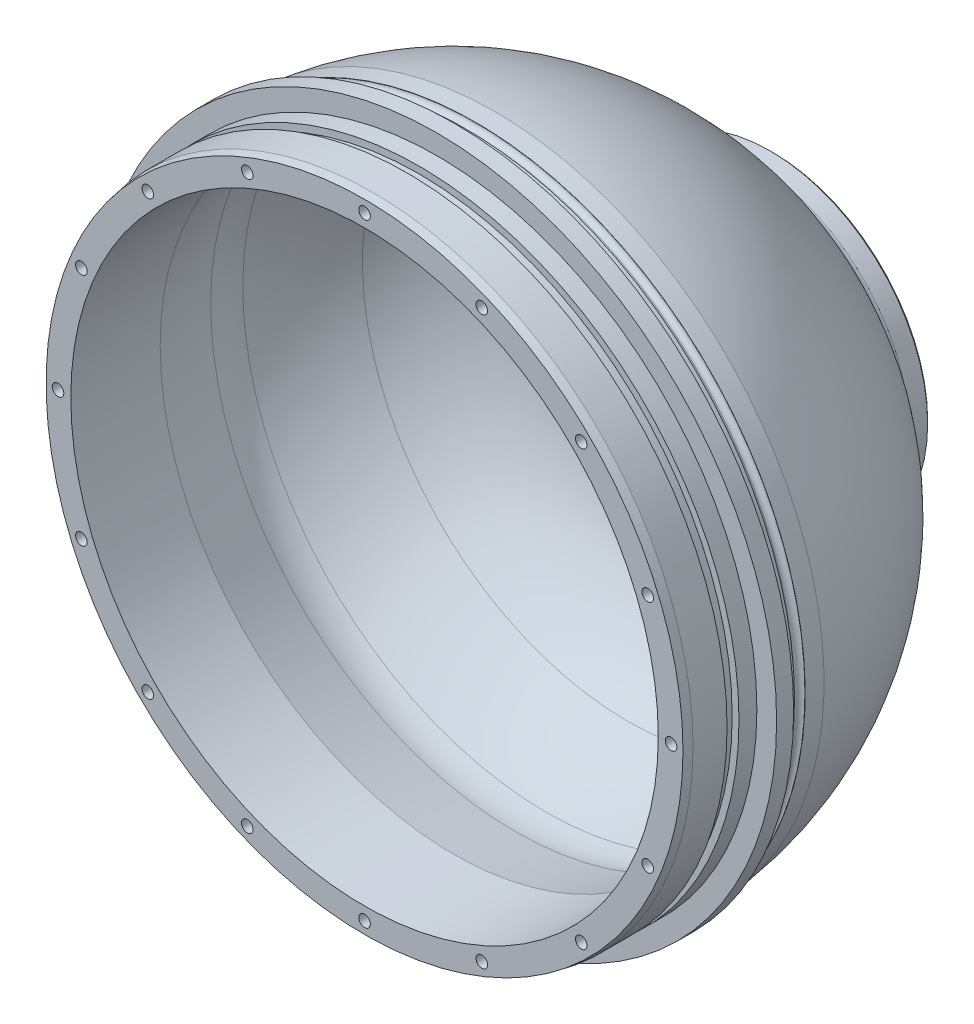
ISO-10303-21;
HEADER;
FILE_DESCRIPTION(('STEP AP214'),'2;1');
FILE_NAME('part.step','',(''),(''),'','','');
FILE_SCHEMA(('AUTOMOTIVE_DESIGN { 1 0 10303 214 1 1 1 1 }'));
ENDSEC;
DATA;
#1=APPLICATION_CONTEXT('core data for automotive mechanical design processes');
#2=APPLICATION_PROTOCOL_DEFINITION('international standard','automotive_design',2000,#1);
#3=PRODUCT_CONTEXT('',#1,'mechanical');
#4=PRODUCT('Part','Part','',(#3));
#5=PRODUCT_RELATED_PRODUCT_CATEGORY('part','',(#4));
#6=PRODUCT_DEFINITION_FORMATION('','',#4);
#7=PRODUCT_DEFINITION_CONTEXT('part definition',#1,'design');
#8=PRODUCT_DEFINITION('design','',#6,#7);
#9=PRODUCT_DEFINITION_SHAPE('','',#8);
#10=(LENGTH_UNIT() NAMED_UNIT(*) SI_UNIT(.MILLI.,.METRE.));
#11=(NAMED_UNIT(*) PLANE_ANGLE_UNIT() SI_UNIT($,.RADIAN.));
#12=(NAMED_UNIT(*) SI_UNIT($,.STERADIAN.) SOLID_ANGLE_UNIT());
#13=UNCERTAINTY_MEASURE_WITH_UNIT(LENGTH_MEASURE(1.E-05),#10,'distance_accuracy_value','');
#14=(GEOMETRIC_REPRESENTATION_CONTEXT(3) GLOBAL_UNCERTAINTY_ASSIGNED_CONTEXT((#13)) GLOBAL_UNIT_ASSIGNED_CONTEXT((#10,
#11,#12)) REPRESENTATION_CONTEXT('',''));
#15=CARTESIAN_POINT('',(0.,0.,0.));
#16=DIRECTION('',(0.,0.,1.));
#17=DIRECTION('',(1.,0.,0.));
#18=AXIS2_PLACEMENT_3D('',#15,#16,#17);
#19=CARTESIAN_POINT('',(25.4,15.875,0.));
#20=DIRECTION('',(0.,0.,-1.));
#21=DIRECTION('',(-1.,0.,0.));
#22=AXIS2_PLACEMENT_3D('',#19,#20,#21);
#23=CYLINDRICAL_SURFACE('',#22,3.45439999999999);
#24=CARTESIAN_POINT('',(25.4,15.875,-121.69067229));
#25=DIRECTION('',(0.,0.,-1.));
#26=DIRECTION('',(-1.,0.,0.));
#27=AXIS2_PLACEMENT_3D('',#24,#25,#26);
#28=CIRCLE('',#27,3.45439999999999);
#29=CARTESIAN_POINT('',(21.9456,15.875,-121.69067229));
#30=VERTEX_POINT('',#29);
#31=EDGE_CURVE('E156',#30,#30,#28,.F.);
#32=ORIENTED_EDGE('',*,*,#31,.F.);
#33=EDGE_LOOP('',(#32));
#34=FACE_BOUND('',#33,.T.);
#35=CARTESIAN_POINT('',(25.4,15.875,-101.70087229));
#36=DIRECTION('',(0.,0.,1.));
#37=DIRECTION('',(1.,0.,0.));
#38=AXIS2_PLACEMENT_3D('',#35,#36,#37);
#39=CIRCLE('',#38,3.45439999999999);
#40=CARTESIAN_POINT('',(28.8544,15.875,-101.70087229));
#41=VERTEX_POINT('',#40);
#42=EDGE_CURVE('E1315',#41,#41,#39,.F.);
#43=ORIENTED_EDGE('',*,*,#42,.F.);
#44=EDGE_LOOP('',(#43));
#45=FACE_BOUND('',#44,.T.);
#46=ADVANCED_FACE('F35',(#34,#45),#23,.F.);
#47=CARTESIAN_POINT('',(0.,0.,0.));
#48=DIRECTION('',(0.,0.,-1.));
#49=DIRECTION('',(-1.,0.,0.));
#50=AXIS2_PLACEMENT_3D('',#47,#48,#49);
#51=CYLINDRICAL_SURFACE('',#50,4.953);
#52=CARTESIAN_POINT('',(0.,0.,-121.69067229));
#53=DIRECTION('',(0.,0.,-1.));
#54=DIRECTION('',(-1.,0.,0.));
#55=AXIS2_PLACEMENT_3D('',#52,#53,#54);
#56=CIRCLE('',#55,4.953);
#57=CARTESIAN_POINT('',(-4.953,0.,-121.69067229));
#58=VERTEX_POINT('',#57);
#59=EDGE_CURVE('E166',#58,#58,#56,.F.);
#60=ORIENTED_EDGE('',*,*,#59,.F.);
#61=EDGE_LOOP('',(#60));
#62=FACE_BOUND('',#61,.T.);
#63=CARTESIAN_POINT('',(0.,0.,-101.70087229));
#64=DIRECTION('',(0.,0.,1.));
#65=DIRECTION('',(1.,0.,0.));
#66=AXIS2_PLACEMENT_3D('',#63,#64,#65);
#67=CIRCLE('',#66,4.953);
#68=CARTESIAN_POINT('',(4.953,0.,-101.70087229));
#69=VERTEX_POINT('',#68);
#70=EDGE_CURVE('E1305',#69,#69,#67,.F.);
#71=ORIENTED_EDGE('',*,*,#70,.F.);
#72=EDGE_LOOP('',(#71));
#73=FACE_BOUND('',#72,.T.);
#74=ADVANCED_FACE('F306',(#62,#73),#51,.F.);
#75=CARTESIAN_POINT('',(27.94,-4.7625,0.));
#76=DIRECTION('',(0.,0.,-1.));
#77=DIRECTION('',(-1.,0.,0.));
#78=AXIS2_PLACEMENT_3D('',#75,#76,#77);
#79=CYLINDRICAL_SURFACE('',#78,6.35);
#80=CARTESIAN_POINT('',(27.94,-4.7625,-101.95487229));
#81=DIRECTION('',(0.,0.,1.));
#82=DIRECTION('',(1.,0.,0.));
#83=AXIS2_PLACEMENT_3D('',#80,#81,#82);
#84=CIRCLE('',#83,6.35);
#85=CARTESIAN_POINT('',(34.29,-4.7625,-101.95487229));
#86=VERTEX_POINT('',#85);
#87=EDGE_CURVE('E43',#86,#86,#84,.T.);
#88=ORIENTED_EDGE('',*,*,#87,.T.);
#89=EDGE_LOOP('',(#88));
#90=FACE_BOUND('',#89,.T.);
#91=CARTESIAN_POINT('',(27.94,-4.7625,-116.68687229));
#92=DIRECTION('',(0.,0.,-1.));
#93=DIRECTION('',(-1.,0.,0.));
#94=AXIS2_PLACEMENT_3D('',#91,#92,#93);
#95=CIRCLE('',#94,6.35);
#96=CARTESIAN_POINT('',(21.59,-4.7625,-116.68687229));
#97=VERTEX_POINT('',#96);
#98=EDGE_CURVE('E183',#97,#97,#95,.F.);
#99=ORIENTED_EDGE('',*,*,#98,.F.);
#100=EDGE_LOOP('',(#99));
#101=FACE_BOUND('',#100,.T.);
#102=ADVANCED_FACE('F257',(#90,#101),#79,.F.);
#103=CARTESIAN_POINT('',(-17.78,-26.67,0.));
#104=DIRECTION('',(0.,0.,-1.));
#105=DIRECTION('',(-1.,0.,0.));
#106=AXIS2_PLACEMENT_3D('',#103,#104,#105);
#107=CYLINDRICAL_SURFACE('',#106,8.76299999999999);
#108=CARTESIAN_POINT('',(-17.78,-26.67,-101.44687229));
#109=DIRECTION('',(0.,0.,1.));
#110=DIRECTION('',(1.,0.,0.));
#111=AXIS2_PLACEMENT_3D('',#108,#109,#110);
#112=CIRCLE('',#111,8.76299999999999);
#113=CARTESIAN_POINT('',(-13.3301849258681,-34.2191267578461,-101.44687229));
#114=VERTEX_POINT('',#113);
#115=CARTESIAN_POINT('',(-26.4598920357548,-25.4659886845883,-101.44687229));
#116=VERTEX_POINT('',#115);
#117=EDGE_CURVE('E267',#114,#116,#112,.T.);
#118=ORIENTED_EDGE('',*,*,#117,.T.);
#119=CARTESIAN_POINT('',(-25.0441250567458,-31.5712912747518,-101.32096121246));
#120=CARTESIAN_POINT('',(-25.181895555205,-31.3671119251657,-101.32620458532));
#121=CARTESIAN_POINT('',(-25.3110093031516,-31.1571754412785,-101.331838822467));
#122=CARTESIAN_POINT('',(-25.5511342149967,-30.7271255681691,-101.343641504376));
#123=CARTESIAN_POINT('',(-25.6621423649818,-30.5070104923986,-101.349810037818));
#124=CARTESIAN_POINT('',(-25.8652894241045,-30.0580706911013,-101.362398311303));
#125=CARTESIAN_POINT('',(-25.9574151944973,-29.8292400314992,-101.368818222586));
#126=CARTESIAN_POINT('',(-26.1220568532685,-29.3646235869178,-101.381584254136));
#127=CARTESIAN_POINT('',(-26.1945726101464,-29.1288377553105,-101.387930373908));
#128=CARTESIAN_POINT('',(-26.3194594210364,-28.6520488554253,-101.400198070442));
#129=CARTESIAN_POINT('',(-26.371835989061,-28.4110472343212,-101.406119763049));
#130=CARTESIAN_POINT('',(-26.4560989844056,-27.9254670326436,-101.417170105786));
#131=CARTESIAN_POINT('',(-26.4879852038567,-27.6808884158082,-101.422298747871));
#132=CARTESIAN_POINT('',(-26.5310268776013,-27.1899849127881,-101.43137599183));
#133=CARTESIAN_POINT('',(-26.5421901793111,-26.943660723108,-101.435325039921));
#134=CARTESIAN_POINT('',(-26.5437251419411,-26.4508201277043,-101.441655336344));
#135=CARTESIAN_POINT('',(-26.5340878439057,-26.2043036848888,-101.444035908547));
#136=CARTESIAN_POINT('',(-26.4940964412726,-25.7132990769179,-101.44683387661));
#137=CARTESIAN_POINT('',(-26.4637719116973,-25.4688085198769,-101.447254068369));
#138=CARTESIAN_POINT('',(-26.3826715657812,-24.9833639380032,-101.445761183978));
#139=CARTESIAN_POINT('',(-26.3319050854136,-24.7424083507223,-101.443849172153));
#140=CARTESIAN_POINT('',(-26.2102788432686,-24.2656053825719,-101.437336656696));
#141=CARTESIAN_POINT('',(-26.1394148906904,-24.0297590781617,-101.432735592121));
#142=CARTESIAN_POINT('',(-25.9781247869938,-23.5649336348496,-101.420520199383));
#143=CARTESIAN_POINT('',(-25.8876987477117,-23.335954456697,-101.412905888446));
#144=CARTESIAN_POINT('',(-25.6886190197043,-22.8879901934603,-101.394444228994));
#145=CARTESIAN_POINT('',(-25.5800881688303,-22.668949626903,-101.383618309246));
#146=CARTESIAN_POINT('',(-25.3452094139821,-22.2408483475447,-101.358495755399));
#147=CARTESIAN_POINT('',(-25.2188616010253,-22.0317875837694,-101.344199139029));
#148=CARTESIAN_POINT('',(-24.9493127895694,-21.6251386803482,-101.311982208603));
#149=CARTESIAN_POINT('',(-24.8061125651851,-21.427550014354,-101.294062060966));
#150=CARTESIAN_POINT('',(-24.5039419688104,-21.0452205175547,-101.254521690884));
#151=CARTESIAN_POINT('',(-24.3449716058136,-20.8604796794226,-101.232901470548));
#152=CARTESIAN_POINT('',(-24.0130149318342,-20.505706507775,-101.186051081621));
#153=CARTESIAN_POINT('',(-23.8400767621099,-20.3356275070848,-101.160833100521));
#154=CARTESIAN_POINT('',(-23.480950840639,-20.01056990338,-101.106832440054));
#155=CARTESIAN_POINT('',(-23.2947582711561,-19.855596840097,-101.078048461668));
#156=CARTESIAN_POINT('',(-22.9105749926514,-19.5618475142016,-101.017140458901));
#157=CARTESIAN_POINT('',(-22.7125862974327,-19.4230684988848,-100.985017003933));
#158=CARTESIAN_POINT('',(-22.3061898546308,-19.1625345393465,-100.917746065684));
#159=CARTESIAN_POINT('',(-22.0977817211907,-19.0407802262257,-100.882598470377));
#160=CARTESIAN_POINT('',(-21.6693790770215,-18.8136395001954,-100.809265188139));
#161=CARTESIAN_POINT('',(-21.4492736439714,-18.7084726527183,-100.771047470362));
#162=CARTESIAN_POINT('',(-21.0013809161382,-18.5169514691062,-100.692525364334));
#163=CARTESIAN_POINT('',(-20.7735933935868,-18.4305976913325,-100.652220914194));
#164=CARTESIAN_POINT('',(-20.3118455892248,-18.2771986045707,-100.570211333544));
#165=CARTESIAN_POINT('',(-20.0778850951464,-18.2101539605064,-100.528506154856));
#166=CARTESIAN_POINT('',(-19.6052270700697,-18.0957442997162,-100.444483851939));
#167=CARTESIAN_POINT('',(-19.3665280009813,-18.0483857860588,-100.402166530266));
#168=CARTESIAN_POINT('',(-18.8804169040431,-17.9728084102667,-100.316867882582));
#169=CARTESIAN_POINT('',(-18.6329309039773,-17.9450562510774,-100.273893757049));
#170=CARTESIAN_POINT('',(-18.1362578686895,-17.9107068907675,-100.189344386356));
#171=CARTESIAN_POINT('',(-17.8870708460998,-17.9041095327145,-100.147769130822));
#172=CARTESIAN_POINT('',(-17.3885576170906,-17.912197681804,-100.067160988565));
#173=CARTESIAN_POINT('',(-17.1392313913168,-17.926888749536,-100.028128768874));
#174=CARTESIAN_POINT('',(-16.6422836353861,-17.9775823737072,-99.9538343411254));
#175=CARTESIAN_POINT('',(-16.3946614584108,-18.0135763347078,-99.9185706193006));
#176=CARTESIAN_POINT('',(-15.9040929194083,-18.1065236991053,-99.8531663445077));
#177=CARTESIAN_POINT('',(-15.661128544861,-18.1633630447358,-99.8229991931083));
#178=CARTESIAN_POINT('',(-15.1804132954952,-18.2977498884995,-99.7686743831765));
#179=CARTESIAN_POINT('',(-14.9426601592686,-18.3752882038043,-99.7445140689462));
#180=CARTESIAN_POINT('',(-14.4741900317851,-18.550620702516,-99.7031458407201));
#181=CARTESIAN_POINT('',(-14.2434709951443,-18.648408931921,-99.6859358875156));
#182=CARTESIAN_POINT('',(-13.7909031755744,-18.8635895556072,-99.659181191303));
#183=CARTESIAN_POINT('',(-13.5690538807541,-18.9809808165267,-99.6496360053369));
#184=CARTESIAN_POINT('',(-13.1483145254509,-19.2273060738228,-99.6389343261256));
#185=CARTESIAN_POINT('',(-12.9488352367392,-19.3552158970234,-99.6373351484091));
#186=CARTESIAN_POINT('',(-12.5609448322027,-19.6267286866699,-99.6413901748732));
#187=CARTESIAN_POINT('',(-12.3725332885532,-19.7703310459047,-99.6470440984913));
#188=CARTESIAN_POINT('',(-12.0081528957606,-20.072127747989,-99.6653836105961));
#189=CARTESIAN_POINT('',(-11.8321842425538,-20.2303223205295,-99.6780693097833));
#190=CARTESIAN_POINT('',(-11.4939097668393,-20.560087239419,-99.7099881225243));
#191=CARTESIAN_POINT('',(-11.3316040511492,-20.7316576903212,-99.7292212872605));
#192=CARTESIAN_POINT('',(-11.0247760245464,-21.0833642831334,-99.7730942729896));
#193=CARTESIAN_POINT('',(-10.8799649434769,-21.2632631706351,-99.7976193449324));
#194=CARTESIAN_POINT('',(-10.6052451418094,-21.6335110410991,-99.8514896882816));
#195=CARTESIAN_POINT('',(-10.4753417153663,-21.8238637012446,-99.8808366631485));
#196=CARTESIAN_POINT('',(-10.2311782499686,-22.2137276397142,-99.9434495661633));
#197=CARTESIAN_POINT('',(-10.1169181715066,-22.4132388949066,-99.9767154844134));
#198=CARTESIAN_POINT('',(-9.90459690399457,-22.8202105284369,-100.04623533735));
#199=CARTESIAN_POINT('',(-9.80653683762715,-23.0276714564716,-100.082489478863));
#200=CARTESIAN_POINT('',(-9.62228955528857,-23.4606087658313,-100.159050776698));
#201=CARTESIAN_POINT('',(-9.53701796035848,-23.6864552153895,-100.199470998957));
#202=CARTESIAN_POINT('',(-9.38543811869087,-24.1442065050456,-100.281551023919));
#203=CARTESIAN_POINT('',(-9.31913043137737,-24.3761115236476,-100.323210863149));
#204=CARTESIAN_POINT('',(-9.20584542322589,-24.8445889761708,-100.406804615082));
#205=CARTESIAN_POINT('',(-9.1588712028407,-25.0811621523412,-100.448738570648));
#206=CARTESIAN_POINT('',(-9.08456680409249,-25.5574758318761,-100.531991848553));
#207=CARTESIAN_POINT('',(-9.05723637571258,-25.7972162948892,-100.573311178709));
#208=CARTESIAN_POINT('',(-9.02180595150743,-26.2870488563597,-100.656023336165));
#209=CARTESIAN_POINT('',(-9.01443439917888,-26.5372026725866,-100.697365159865));
#210=CARTESIAN_POINT('',(-9.02113711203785,-27.0374931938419,-100.77779982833));
#211=CARTESIAN_POINT('',(-9.03520363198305,-27.2876298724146,-100.816893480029));
#212=CARTESIAN_POINT('',(-9.08477450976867,-27.7862425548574,-100.892246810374));
#213=CARTESIAN_POINT('',(-9.12028200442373,-28.0347183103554,-100.928506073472));
#214=CARTESIAN_POINT('',(-9.21259418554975,-28.5281501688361,-100.99770861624));
#215=CARTESIAN_POINT('',(-9.26939843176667,-28.7731063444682,-101.03065196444));
#216=CARTESIAN_POINT('',(-9.4030909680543,-29.2543954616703,-101.092460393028));
#217=CARTESIAN_POINT('',(-9.47969851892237,-29.4908001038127,-101.121374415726));
#218=CARTESIAN_POINT('',(-9.65288425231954,-29.9566248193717,-101.175432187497));
#219=CARTESIAN_POINT('',(-9.74946233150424,-30.1860449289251,-101.200575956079));
#220=CARTESIAN_POINT('',(-9.96195169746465,-30.6361338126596,-101.246994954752));
#221=CARTESIAN_POINT('',(-10.0778612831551,-30.8568033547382,-101.268270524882));
#222=CARTESIAN_POINT('',(-10.3282235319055,-31.2877142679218,-101.306964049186));
#223=CARTESIAN_POINT('',(-10.4626759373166,-31.497955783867,-101.324382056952));
#224=CARTESIAN_POINT('',(-10.746184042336,-31.9021377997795,-101.355139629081));
#225=CARTESIAN_POINT('',(-10.894877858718,-32.0963263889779,-101.368556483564));
#226=CARTESIAN_POINT('',(-11.2080904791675,-32.4717177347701,-101.391962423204));
#227=CARTESIAN_POINT('',(-11.3726094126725,-32.6529203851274,-101.401951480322));
#228=CARTESIAN_POINT('',(-11.7163004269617,-33.0009980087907,-101.418737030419));
#229=CARTESIAN_POINT('',(-11.8954720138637,-33.1678734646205,-101.425533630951));
#230=CARTESIAN_POINT('',(-12.2671987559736,-33.4860877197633,-101.436222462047));
#231=CARTESIAN_POINT('',(-12.4597539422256,-33.6374264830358,-101.440114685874));
#232=CARTESIAN_POINT('',(-12.8560776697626,-33.9229002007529,-101.445312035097));
#233=CARTESIAN_POINT('',(-13.0597981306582,-34.0571017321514,-101.446627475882));
#234=CARTESIAN_POINT('',(-13.4777883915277,-34.308101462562,-101.447054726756));
#235=CARTESIAN_POINT('',(-13.6920617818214,-34.4248936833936,-101.446165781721));
#236=CARTESIAN_POINT('',(-14.1295517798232,-34.6401834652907,-101.442553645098));
#237=CARTESIAN_POINT('',(-14.3527669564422,-34.738683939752,-101.439830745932));
#238=CARTESIAN_POINT('',(-14.8066165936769,-34.9167316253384,-101.432929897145));
#239=CARTESIAN_POINT('',(-15.0372512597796,-34.9962783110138,-101.428751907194));
#240=CARTESIAN_POINT('',(-15.5058079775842,-35.1363088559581,-101.419289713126));
#241=CARTESIAN_POINT('',(-15.7437669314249,-35.1966687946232,-101.413998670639));
#242=CARTESIAN_POINT('',(-16.2238926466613,-35.2972160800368,-101.402704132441));
#243=CARTESIAN_POINT('',(-16.4660594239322,-35.3374033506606,-101.39670063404));
#244=CARTESIAN_POINT('',(-16.952903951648,-35.3973268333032,-101.384342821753));
#245=CARTESIAN_POINT('',(-17.1975817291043,-35.4170628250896,-101.377988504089));
#246=CARTESIAN_POINT('',(-17.6877250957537,-35.4359456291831,-101.365268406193));
#247=CARTESIAN_POINT('',(-17.9331906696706,-35.4350928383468,-101.358902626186));
#248=CARTESIAN_POINT('',(-18.4243322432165,-35.4127521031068,-101.346441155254));
#249=CARTESIAN_POINT('',(-18.6700039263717,-35.3911683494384,-101.340346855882));
#250=CARTESIAN_POINT('',(-19.1585847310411,-35.327386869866,-101.328742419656));
#251=CARTESIAN_POINT('',(-19.4014947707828,-35.2851962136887,-101.323232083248));
#252=CARTESIAN_POINT('',(-19.8829931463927,-35.1804823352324,-101.313032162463));
#253=CARTESIAN_POINT('',(-20.1215800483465,-35.11795249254,-101.308342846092));
#254=CARTESIAN_POINT('',(-20.5926498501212,-34.9730053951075,-101.299984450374));
#255=CARTESIAN_POINT('',(-20.8251328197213,-34.8905883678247,-101.296315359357));
#256=CARTESIAN_POINT('',(-21.2822706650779,-34.7064772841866,-101.290148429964));
#257=CARTESIAN_POINT('',(-21.5069279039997,-34.6047891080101,-101.287650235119));
#258=CARTESIAN_POINT('',(-21.9468814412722,-34.3828448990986,-101.28392362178));
#259=CARTESIAN_POINT('',(-22.1621778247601,-34.2625890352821,-101.282695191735));
#260=CARTESIAN_POINT('',(-22.5817390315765,-34.0044450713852,-101.281557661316));
#261=CARTESIAN_POINT('',(-22.7860112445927,-33.8665689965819,-101.281647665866));
#262=CARTESIAN_POINT('',(-23.1821648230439,-33.5741595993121,-101.283139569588));
#263=CARTESIAN_POINT('',(-23.3740482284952,-33.4196290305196,-101.284541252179));
#264=CARTESIAN_POINT('',(-23.8413292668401,-33.0096591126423,-101.289673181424));
#265=CARTESIAN_POINT('',(-24.1077048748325,-32.7438242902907,-101.29423943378));
#266=CARTESIAN_POINT('',(-24.6041296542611,-32.1802131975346,-101.305888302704));
#267=CARTESIAN_POINT('',(-24.8341788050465,-31.8824369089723,-101.312970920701));
#268=CARTESIAN_POINT('',(-25.0441250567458,-31.5712912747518,-101.32096121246));
#269=B_SPLINE_CURVE_WITH_KNOTS('',3,(#119,#120,#121,#122,#123,#124,#125,#126,#127,#128,#129,
#130,#131,#132,#133,#134,#135,#136,#137,#138,#139,#140,#141,#142,#143,#144,#145,#146,#147,#148,
#149,#150,#151,#152,#153,#154,#155,#156,#157,#158,#159,#160,#161,#162,#163,#164,#165,#166,#167,
#168,#169,#170,#171,#172,#173,#174,#175,#176,#177,#178,#179,#180,#181,#182,#183,#184,#185,#186,
#187,#188,#189,#190,#191,#192,#193,#194,#195,#196,#197,#198,#199,#200,#201,#202,#203,#204,#205,
#206,#207,#208,#209,#210,#211,#212,#213,#214,#215,#216,#217,#218,#219,#220,#221,#222,#223,#224,
#225,#226,#227,#228,#229,#230,#231,#232,#233,#234,#235,#236,#237,#238,#239,#240,#241,#242,#243,
#244,#245,#246,#247,#248,#249,#250,#251,#252,#253,#254,#255,#256,#257,#258,#259,#260,#261,#262,
#263,#264,#265,#266,#267,#268),.UNSPECIFIED.,.T.,.F.,(4,2,2,2,2,2,2,2,2,2,2,2,2,2,2,2,2,2,2,2,2,
2,2,2,2,2,2,2,2,2,2,2,2,2,2,2,2,2,2,2,2,2,2,2,2,2,2,2,2,2,2,2,2,2,2,2,2,2,2,2,2,2,2,2,2,2,2,2,2,
2,2,2,2,2,4),(0.,0.73878085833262,1.47768457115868,2.21710069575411,2.95652177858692,
3.69574026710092,4.43496625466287,5.17391225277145,5.91317658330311,6.6513862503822,
7.38925915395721,8.12728603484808,8.865308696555,9.59851376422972,10.3317150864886,
11.0648827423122,11.7980499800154,12.528790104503,13.259797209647,13.9906798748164,
14.7215896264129,15.4614827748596,16.2013978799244,16.941338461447,17.6815232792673,
18.4387822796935,19.1960356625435,19.9534868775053,20.7106326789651,21.4636960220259,
22.2164258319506,22.9689346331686,23.7213999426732,24.4314339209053,25.1414404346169,
25.8514581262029,26.5614813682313,27.2574280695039,27.9536211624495,28.6498124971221,
29.3460520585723,30.0795326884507,30.8130349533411,31.5466548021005,32.2802653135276,
33.0403109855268,33.8000821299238,34.5599644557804,35.3198310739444,36.0694657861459,
36.819096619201,37.5686615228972,38.3182160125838,39.0521810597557,39.7861521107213,
40.5200984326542,41.2540464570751,41.9850502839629,42.7163045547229,43.4474422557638,
44.1786002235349,44.9143888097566,45.6501801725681,46.3859794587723,47.1217645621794,
47.8609665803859,48.5999151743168,49.3391045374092,50.0782854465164,50.817241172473,
51.5561901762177,52.2946375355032,53.0329629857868,54.1587786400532,55.2845949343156),.UNSPECIFIED.);
#270=EDGE_CURVE('E90',#114,#116,#269,.T.);
#271=ORIENTED_EDGE('',*,*,#270,.F.);
#272=EDGE_LOOP('',(#118,#271));
#273=FACE_BOUND('',#272,.T.);
#274=CARTESIAN_POINT('',(-17.78,-26.67,-121.69067229));
#275=DIRECTION('',(0.,0.,-1.));
#276=DIRECTION('',(-1.,0.,0.));
#277=AXIS2_PLACEMENT_3D('',#274,#275,#276);
#278=CIRCLE('',#277,8.76299999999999);
#279=CARTESIAN_POINT('',(-26.543,-26.67,-121.69067229));
#280=VERTEX_POINT('',#279);
#281=EDGE_CURVE('E171',#280,#280,#278,.F.);
#282=ORIENTED_EDGE('',*,*,#281,.F.);
#283=EDGE_LOOP('',(#282));
#284=FACE_BOUND('',#283,.T.);
#285=ADVANCED_FACE('F252',(#273,#284),#107,.F.);
#286=CARTESIAN_POINT('',(12.7,30.1625,0.));
#287=DIRECTION('',(0.,0.,-1.));
#288=DIRECTION('',(-1.,0.,0.));
#289=AXIS2_PLACEMENT_3D('',#286,#287,#288);
#290=CYLINDRICAL_SURFACE('',#289,2.70509999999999);
#291=CARTESIAN_POINT('',(12.7,30.1625,-101.44687229));
#292=DIRECTION('',(0.,0.,1.));
#293=DIRECTION('',(1.,0.,0.));
#294=AXIS2_PLACEMENT_3D('',#291,#292,#293);
#295=CIRCLE('',#294,2.70509999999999);
#296=CARTESIAN_POINT('',(15.4051,30.1625,-101.44687229));
#297=VERTEX_POINT('',#296);
#298=EDGE_CURVE('E672',#297,#297,#295,.T.);
#299=ORIENTED_EDGE('',*,*,#298,.T.);
#300=EDGE_LOOP('',(#299));
#301=FACE_BOUND('',#300,.T.);
#302=CARTESIAN_POINT('',(12.7,30.1625,-121.69067229));
#303=DIRECTION('',(0.,0.,-1.));
#304=DIRECTION('',(-1.,0.,0.));
#305=AXIS2_PLACEMENT_3D('',#302,#303,#304);
#306=CIRCLE('',#305,2.70509999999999);
#307=CARTESIAN_POINT('',(9.99490000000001,30.1625,-121.69067229));
#308=VERTEX_POINT('',#307);
#309=EDGE_CURVE('E161',#308,#308,#306,.F.);
#310=ORIENTED_EDGE('',*,*,#309,.F.);
#311=EDGE_LOOP('',(#310));
#312=FACE_BOUND('',#311,.T.);
#313=ADVANCED_FACE('F256',(#301,#312),#290,.F.);
#314=CARTESIAN_POINT('',(15.875,-25.4,0.));
#315=DIRECTION('',(0.,0.,-1.));
#316=DIRECTION('',(-1.,0.,0.));
#317=AXIS2_PLACEMENT_3D('',#314,#315,#316);
#318=CYLINDRICAL_SURFACE('',#317,5.75310000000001);
#319=CARTESIAN_POINT('',(15.875,-25.4,-101.44687229));
#320=DIRECTION('',(0.,0.,1.));
#321=DIRECTION('',(1.,0.,0.));
#322=AXIS2_PLACEMENT_3D('',#319,#320,#321);
#323=CIRCLE('',#322,5.75310000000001);
#324=CARTESIAN_POINT('',(21.6281,-25.4,-101.44687229));
#325=VERTEX_POINT('',#324);
#326=EDGE_CURVE('E678',#325,#325,#323,.T.);
#327=ORIENTED_EDGE('',*,*,#326,.T.);
#328=EDGE_LOOP('',(#327));
#329=FACE_BOUND('',#328,.T.);
#330=CARTESIAN_POINT('',(15.875,-25.4,-121.69067229));
#331=DIRECTION('',(0.,0.,-1.));
#332=DIRECTION('',(-1.,0.,0.));
#333=AXIS2_PLACEMENT_3D('',#330,#331,#332);
#334=CIRCLE('',#333,5.75310000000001);
#335=CARTESIAN_POINT('',(10.1219,-25.4,-121.69067229));
#336=VERTEX_POINT('',#335);
#337=EDGE_CURVE('E151',#336,#336,#334,.F.);
#338=ORIENTED_EDGE('',*,*,#337,.F.);
#339=EDGE_LOOP('',(#338));
#340=FACE_BOUND('',#339,.T.);
#341=ADVANCED_FACE('F317',(#329,#340),#318,.F.);
#342=CARTESIAN_POINT('',(-29.21,-3.81,0.));
#343=DIRECTION('',(0.,0.,-1.));
#344=DIRECTION('',(-1.,0.,0.));
#345=AXIS2_PLACEMENT_3D('',#342,#343,#344);
#346=CYLINDRICAL_SURFACE('',#345,2.70509999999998);
#347=CARTESIAN_POINT('',(-29.21,-3.81,-101.44687229));
#348=DIRECTION('',(0.,0.,1.));
#349=DIRECTION('',(1.,0.,0.));
#350=AXIS2_PLACEMENT_3D('',#347,#348,#349);
#351=CIRCLE('',#350,2.70509999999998);
#352=CARTESIAN_POINT('',(-26.5049,-3.81,-101.44687229));
#353=VERTEX_POINT('',#352);
#354=EDGE_CURVE('E675',#353,#353,#351,.T.);
#355=ORIENTED_EDGE('',*,*,#354,.T.);
#356=EDGE_LOOP('',(#355));
#357=FACE_BOUND('',#356,.T.);
#358=CARTESIAN_POINT('',(-29.21,-3.81,-121.69067229));
#359=DIRECTION('',(0.,0.,-1.));
#360=DIRECTION('',(-1.,0.,0.));
#361=AXIS2_PLACEMENT_3D('',#358,#359,#360);
#362=CIRCLE('',#361,2.70509999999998);
#363=CARTESIAN_POINT('',(-31.9151,-3.81,-121.69067229));
#364=VERTEX_POINT('',#363);
#365=EDGE_CURVE('E146',#364,#364,#362,.F.);
#366=ORIENTED_EDGE('',*,*,#365,.F.);
#367=EDGE_LOOP('',(#366));
#368=FACE_BOUND('',#367,.T.);
#369=ADVANCED_FACE('F318',(#357,#368),#346,.F.);
#370=CARTESIAN_POINT('',(-29.21,15.24,0.));
#371=DIRECTION('',(0.,0.,-1.));
#372=DIRECTION('',(-1.,0.,0.));
#373=AXIS2_PLACEMENT_3D('',#370,#371,#372);
#374=CYLINDRICAL_SURFACE('',#373,2.7051);
#375=CARTESIAN_POINT('',(-29.21,15.24,-101.44687229));
#376=DIRECTION('',(0.,0.,1.));
#377=DIRECTION('',(1.,0.,0.));
#378=AXIS2_PLACEMENT_3D('',#375,#376,#377);
#379=CIRCLE('',#378,2.7051);
#380=CARTESIAN_POINT('',(-26.5049,15.24,-101.44687229));
#381=VERTEX_POINT('',#380);
#382=EDGE_CURVE('E667',#381,#381,#379,.T.);
#383=ORIENTED_EDGE('',*,*,#382,.T.);
#384=EDGE_LOOP('',(#383));
#385=FACE_BOUND('',#384,.T.);
#386=CARTESIAN_POINT('',(-29.21,15.24,-121.69067229));
#387=DIRECTION('',(0.,0.,-1.));
#388=DIRECTION('',(-1.,0.,0.));
#389=AXIS2_PLACEMENT_3D('',#386,#387,#388);
#390=CIRCLE('',#389,2.7051);
#391=CARTESIAN_POINT('',(-31.9151,15.24,-121.69067229));
#392=VERTEX_POINT('',#391);
#393=EDGE_CURVE('E141',#392,#392,#390,.F.);
#394=ORIENTED_EDGE('',*,*,#393,.F.);
#395=EDGE_LOOP('',(#394));
#396=FACE_BOUND('',#395,.T.);
#397=ADVANCED_FACE('F321',(#385,#396),#374,.F.);
#398=CARTESIAN_POINT('',(-12.7,27.94,0.));
#399=DIRECTION('',(0.,0.,-1.));
#400=DIRECTION('',(-1.,0.,0.));
#401=AXIS2_PLACEMENT_3D('',#398,#399,#400);
#402=CYLINDRICAL_SURFACE('',#401,5.75310000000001);
#403=CARTESIAN_POINT('',(-12.7,27.94,-101.44687229));
#404=DIRECTION('',(0.,0.,1.));
#405=DIRECTION('',(1.,0.,0.));
#406=AXIS2_PLACEMENT_3D('',#403,#404,#405);
#407=CIRCLE('',#406,5.75310000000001);
#408=CARTESIAN_POINT('',(-6.94689999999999,27.94,-101.44687229));
#409=VERTEX_POINT('',#408);
#410=EDGE_CURVE('E680',#409,#409,#407,.T.);
#411=ORIENTED_EDGE('',*,*,#410,.T.);
#412=EDGE_LOOP('',(#411));
#413=FACE_BOUND('',#412,.T.);
#414=CARTESIAN_POINT('',(-12.7,27.94,-121.69067229));
#415=DIRECTION('',(0.,0.,-1.));
#416=DIRECTION('',(-1.,0.,0.));
#417=AXIS2_PLACEMENT_3D('',#414,#415,#416);
#418=CIRCLE('',#417,5.75310000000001);
#419=CARTESIAN_POINT('',(-18.4531,27.94,-121.69067229));
#420=VERTEX_POINT('',#419);
#421=EDGE_CURVE('E137',#420,#420,#418,.F.);
#422=ORIENTED_EDGE('',*,*,#421,.F.);
#423=EDGE_LOOP('',(#422));
#424=FACE_BOUND('',#423,.T.);
#425=ADVANCED_FACE('F259',(#413,#424),#402,.F.);
#426=CARTESIAN_POINT('',(0.,0.,0.));
#427=DIRECTION('',(0.,0.,1.));
#428=DIRECTION('',(1.,0.,0.));
#429=AXIS2_PLACEMENT_3D('',#426,#427,#428);
#430=CYLINDRICAL_SURFACE('',#429,98.298);
#431=CARTESIAN_POINT('',(0.,0.,-26.67));
#432=DIRECTION('',(0.,0.,1.));
#433=DIRECTION('',(1.,0.,0.));
#434=AXIS2_PLACEMENT_3D('',#431,#432,#433);
#435=CIRCLE('',#434,98.298);
#436=CARTESIAN_POINT('',(98.298,0.,-26.67));
#437=VERTEX_POINT('',#436);
#438=EDGE_CURVE('E534',#437,#437,#435,.T.);
#439=ORIENTED_EDGE('',*,*,#438,.F.);
#440=EDGE_LOOP('',(#439));
#441=FACE_BOUND('',#440,.T.);
#442=CARTESIAN_POINT('',(0.,0.,-29.972));
#443=DIRECTION('',(0.,0.,-1.));
#444=DIRECTION('',(-1.,0.,0.));
#445=AXIS2_PLACEMENT_3D('',#442,#443,#444);
#446=CIRCLE('',#445,98.298);
#447=CARTESIAN_POINT('',(-98.298,0.,-29.972));
#448=VERTEX_POINT('',#447);
#449=EDGE_CURVE('E108',#448,#448,#446,.F.);
#450=ORIENTED_EDGE('',*,*,#449,.T.);
#451=EDGE_LOOP('',(#450));
#452=FACE_BOUND('',#451,.T.);
#453=ADVANCED_FACE('F508',(#441,#452),#430,.T.);
#454=CARTESIAN_POINT('',(0.,0.,-21.59));
#455=DIRECTION('',(0.,0.,1.));
#456=DIRECTION('',(1.,0.,0.));
#457=AXIS2_PLACEMENT_3D('',#454,#455,#456);
#458=CYLINDRICAL_SURFACE('',#457,95.4532);
#459=CARTESIAN_POINT('',(0.,0.,-21.59));
#460=DIRECTION('',(0.,0.,1.));
#461=DIRECTION('',(1.,0.,0.));
#462=AXIS2_PLACEMENT_3D('',#459,#460,#461);
#463=CIRCLE('',#462,95.4532);
#464=CARTESIAN_POINT('',(95.4532,0.,-21.59));
#465=VERTEX_POINT('',#464);
#466=EDGE_CURVE('E537',#465,#465,#463,.T.);
#467=ORIENTED_EDGE('',*,*,#466,.T.);
#468=EDGE_LOOP('',(#467));
#469=FACE_BOUND('',#468,.T.);
#470=CARTESIAN_POINT('',(0.,0.,-16.256));
#471=DIRECTION('',(0.,0.,1.));
#472=DIRECTION('',(1.,0.,0.));
#473=AXIS2_PLACEMENT_3D('',#470,#471,#472);
#474=CIRCLE('',#473,95.4532);
#475=CARTESIAN_POINT('',(95.4532,0.,-16.256));
#476=VERTEX_POINT('',#475);
#477=EDGE_CURVE('E551',#476,#476,#474,.F.);
#478=ORIENTED_EDGE('',*,*,#477,.T.);
#479=EDGE_LOOP('',(#478));
#480=FACE_BOUND('',#479,.T.);
#481=ADVANCED_FACE('F477',(#469,#480),#458,.T.);
#482=CARTESIAN_POINT('',(0.,0.,0.));
#483=DIRECTION('',(0.,0.,1.));
#484=DIRECTION('',(1.,0.,0.));
#485=AXIS2_PLACEMENT_3D('',#482,#483,#484);
#486=CYLINDRICAL_SURFACE('',#485,101.346);
#487=CARTESIAN_POINT('',(0.,0.,-26.67));
#488=DIRECTION('',(0.,0.,1.));
#489=DIRECTION('',(1.,0.,0.));
#490=AXIS2_PLACEMENT_3D('',#487,#488,#489);
#491=CIRCLE('',#490,101.346);
#492=CARTESIAN_POINT('',(101.346,0.,-26.67));
#493=VERTEX_POINT('',#492);
#494=EDGE_CURVE('E544',#493,#493,#491,.T.);
#495=ORIENTED_EDGE('',*,*,#494,.T.);
#496=EDGE_LOOP('',(#495));
#497=FACE_BOUND('',#496,.T.);
#498=CARTESIAN_POINT('',(0.,0.,-21.59));
#499=DIRECTION('',(0.,0.,1.));
#500=DIRECTION('',(1.,0.,0.));
#501=AXIS2_PLACEMENT_3D('',#498,#499,#500);
#502=CIRCLE('',#501,101.346);
#503=CARTESIAN_POINT('',(101.346,0.,-21.59));
#504=VERTEX_POINT('',#503);
#505=EDGE_CURVE('E531',#504,#504,#502,.F.);
#506=ORIENTED_EDGE('',*,*,#505,.T.);
#507=EDGE_LOOP('',(#506));
#508=FACE_BOUND('',#507,.T.);
#509=ADVANCED_FACE('F511',(#497,#508),#486,.T.);
#510=CARTESIAN_POINT('',(0.,-101.346,-26.67));
#511=DIRECTION('',(0.,0.,-1.));
#512=DIRECTION('',(-1.,0.,0.));
#513=AXIS2_PLACEMENT_3D('',#510,#511,#512);
#514=PLANE('',#513);
#515=ORIENTED_EDGE('',*,*,#438,.T.);
#516=EDGE_LOOP('',(#515));
#517=FACE_BOUND('',#516,.T.);
#518=ORIENTED_EDGE('',*,*,#494,.F.);
#519=EDGE_LOOP('',(#518));
#520=FACE_BOUND('',#519,.T.);
#521=ADVANCED_FACE('F480',(#517,#520),#514,.T.);
#522=CARTESIAN_POINT('',(0.,0.,-21.59));
#523=DIRECTION('',(0.,0.,1.));
#524=DIRECTION('',(1.,0.,0.));
#525=AXIS2_PLACEMENT_3D('',#522,#523,#524);
#526=PLANE('',#525);
#527=ORIENTED_EDGE('',*,*,#505,.F.);
#528=EDGE_LOOP('',(#527));
#529=FACE_BOUND('',#528,.T.);
#530=ORIENTED_EDGE('',*,*,#466,.F.);
#531=EDGE_LOOP('',(#530));
#532=FACE_BOUND('',#531,.T.);
#533=ADVANCED_FACE('F467',(#529,#532),#526,.T.);
#534=CARTESIAN_POINT('',(0.,0.,-16.256));
#535=DIRECTION('',(0.,0.,1.));
#536=DIRECTION('',(1.,0.,0.));
#537=AXIS2_PLACEMENT_3D('',#534,#535,#536);
#538=PLANE('',#537);
#539=ORIENTED_EDGE('',*,*,#477,.F.);
#540=EDGE_LOOP('',(#539));
#541=FACE_BOUND('',#540,.T.);
#542=CARTESIAN_POINT('',(0.,0.,-16.256));
#543=DIRECTION('',(0.,0.,1.));
#544=DIRECTION('',(1.,0.,0.));
#545=AXIS2_PLACEMENT_3D('',#542,#543,#544);
#546=CIRCLE('',#545,93.4212);
#547=CARTESIAN_POINT('',(93.4212,0.,-16.256));
#548=VERTEX_POINT('',#547);
#549=EDGE_CURVE('E552',#548,#548,#546,.T.);
#550=ORIENTED_EDGE('',*,*,#549,.F.);
#551=EDGE_LOOP('',(#550));
#552=FACE_BOUND('',#551,.T.);
#553=ADVANCED_FACE('F464',(#541,#552),#538,.T.);
#554=CARTESIAN_POINT('',(0.,0.,-12.7));
#555=DIRECTION('',(0.,0.,1.));
#556=DIRECTION('',(1.,0.,0.));
#557=AXIS2_PLACEMENT_3D('',#554,#555,#556);
#558=PLANE('',#557);
#559=CARTESIAN_POINT('',(0.,0.,-12.7));
#560=DIRECTION('',(0.,0.,1.));
#561=DIRECTION('',(1.,0.,0.));
#562=AXIS2_PLACEMENT_3D('',#559,#560,#561);
#563=CIRCLE('',#562,95.4532);
#564=CARTESIAN_POINT('',(95.4532,0.,-12.7));
#565=VERTEX_POINT('',#564);
#566=EDGE_CURVE('E548',#565,#565,#563,.F.);
#567=ORIENTED_EDGE('',*,*,#566,.T.);
#568=EDGE_LOOP('',(#567));
#569=FACE_BOUND('',#568,.T.);
#570=CARTESIAN_POINT('',(0.,0.,-12.7));
#571=DIRECTION('',(0.,0.,1.));
#572=DIRECTION('',(1.,0.,0.));
#573=AXIS2_PLACEMENT_3D('',#570,#571,#572);
#574=CIRCLE('',#573,93.4212);
#575=CARTESIAN_POINT('',(93.4212,0.,-12.7));
#576=VERTEX_POINT('',#575);
#577=EDGE_CURVE('E115',#576,#576,#574,.T.);
#578=ORIENTED_EDGE('',*,*,#577,.T.);
#579=EDGE_LOOP('',(#578));
#580=FACE_BOUND('',#579,.T.);
#581=ADVANCED_FACE('F462',(#569,#580),#558,.F.);
#582=CARTESIAN_POINT('',(0.,0.,-16.256));
#583=DIRECTION('',(0.,0.,1.));
#584=DIRECTION('',(1.,0.,0.));
#585=AXIS2_PLACEMENT_3D('',#582,#583,#584);
#586=CYLINDRICAL_SURFACE('',#585,93.4212);
#587=ORIENTED_EDGE('',*,*,#549,.T.);
#588=EDGE_LOOP('',(#587));
#589=FACE_BOUND('',#588,.T.);
#590=ORIENTED_EDGE('',*,*,#577,.F.);
#591=EDGE_LOOP('',(#590));
#592=FACE_BOUND('',#591,.T.);
#593=ADVANCED_FACE('F459',(#589,#592),#586,.T.);
#594=CARTESIAN_POINT('',(0.,0.,-101.44687229));
#595=DIRECTION('',(0.,0.,1.));
#596=DIRECTION('',(1.,0.,0.));
#597=AXIS2_PLACEMENT_3D('',#594,#595,#596);
#598=PLANE('',#597);
#599=CARTESIAN_POINT('',(27.94,-4.7625,-101.44687229));
#600=DIRECTION('',(0.,0.,1.));
#601=DIRECTION('',(1.,0.,0.));
#602=AXIS2_PLACEMENT_3D('',#599,#600,#601);
#603=CIRCLE('',#602,6.64329393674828);
#604=CARTESIAN_POINT('',(34.5832939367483,-4.7625,-101.44687229));
#605=VERTEX_POINT('',#604);
#606=EDGE_CURVE('E12',#605,#605,#603,.F.);
#607=ORIENTED_EDGE('',*,*,#606,.T.);
#608=EDGE_LOOP('',(#607));
#609=FACE_BOUND('',#608,.T.);
#610=CARTESIAN_POINT('',(25.4,15.875,-101.44687229));
#611=DIRECTION('',(0.,0.,1.));
#612=DIRECTION('',(1.,0.,0.));
#613=AXIS2_PLACEMENT_3D('',#610,#611,#612);
#614=CIRCLE('',#613,9.52500000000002);
#615=CARTESIAN_POINT('',(26.5951271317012,25.3247246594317,-101.44687229));
#616=VERTEX_POINT('',#615);
#617=CARTESIAN_POINT('',(34.4178419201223,12.808380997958,-101.44687229));
#618=VERTEX_POINT('',#617);
#619=EDGE_CURVE('E49',#616,#618,#614,.T.);
#620=ORIENTED_EDGE('',*,*,#619,.F.);
#621=CARTESIAN_POINT('',(0.,0.,-101.44687229));
#622=DIRECTION('',(0.,0.,1.));
#623=DIRECTION('',(1.,0.,0.));
#624=AXIS2_PLACEMENT_3D('',#621,#622,#623);
#625=CIRCLE('',#624,36.7238678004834);
#626=EDGE_CURVE('E78',#616,#116,#625,.T.);
#627=ORIENTED_EDGE('',*,*,#626,.T.);
#628=ORIENTED_EDGE('',*,*,#117,.F.);
#629=EDGE_CURVE('E77',#114,#618,#625,.T.);
#630=ORIENTED_EDGE('',*,*,#629,.T.);
#631=EDGE_LOOP('',(#620,#627,#628,#630));
#632=FACE_BOUND('',#631,.T.);
#633=CARTESIAN_POINT('',(0.,0.,-101.44687229));
#634=DIRECTION('',(0.,0.,1.));
#635=DIRECTION('',(1.,0.,0.));
#636=AXIS2_PLACEMENT_3D('',#633,#634,#635);
#637=CIRCLE('',#636,9.525);
#638=CARTESIAN_POINT('',(9.525,0.,-101.44687229));
#639=VERTEX_POINT('',#638);
#640=EDGE_CURVE('E1312',#639,#639,#637,.T.);
#641=ORIENTED_EDGE('',*,*,#640,.F.);
#642=EDGE_LOOP('',(#641));
#643=FACE_BOUND('',#642,.T.);
#644=ORIENTED_EDGE('',*,*,#410,.F.);
#645=EDGE_LOOP('',(#644));
#646=FACE_BOUND('',#645,.T.);
#647=ORIENTED_EDGE('',*,*,#326,.F.);
#648=EDGE_LOOP('',(#647));
#649=FACE_BOUND('',#648,.T.);
#650=ORIENTED_EDGE('',*,*,#354,.F.);
#651=EDGE_LOOP('',(#650));
#652=FACE_BOUND('',#651,.T.);
#653=ORIENTED_EDGE('',*,*,#298,.F.);
#654=EDGE_LOOP('',(#653));
#655=FACE_BOUND('',#654,.T.);
#656=ORIENTED_EDGE('',*,*,#382,.F.);
#657=EDGE_LOOP('',(#656));
#658=FACE_BOUND('',#657,.T.);
#659=ADVANCED_FACE('F83',(#609,#632,#643,#646,#649,#652,#655,#658),#598,.T.);
#660=CARTESIAN_POINT('',(0.,0.,-26.5168723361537));
#661=DIRECTION('',(0.,0.,1.));
#662=DIRECTION('',(0.,-1.,0.));
#663=AXIS2_PLACEMENT_3D('',#660,#661,#662);
#664=SPHERICAL_SURFACE('',#663,94.742);
#665=CARTESIAN_POINT('',(0.,0.,-54.2811244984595));
#666=DIRECTION('',(0.,0.,1.));
#667=DIRECTION('',(1.,0.,0.));
#668=AXIS2_PLACEMENT_3D('',#665,#666,#667);
#669=CIRCLE('',#668,90.5825196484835);
#670=CARTESIAN_POINT('',(0.,-90.5825196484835,-54.2811244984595));
#671=VERTEX_POINT('',#670);
#672=EDGE_CURVE('E98',#671,#671,#669,.T.);
#673=CARTESIAN_POINT('',(0.,0.,-78.5428259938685));
#674=DIRECTION('',(0.,0.,1.));
#675=DIRECTION('',(1.,0.,0.));
#676=AXIS2_PLACEMENT_3D('',#673,#674,#675);
#677=CIRCLE('',#676,79.1792062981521);
#678=CARTESIAN_POINT('',(0.,-79.1792062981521,-78.5428259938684));
#679=VERTEX_POINT('',#678);
#680=EDGE_CURVE('E96',#679,#679,#677,.F.);
#681=CARTESIAN_POINT('',(0.,-90.5825196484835,-54.2811244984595));
#682=CARTESIAN_POINT('',(0.,-90.5004098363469,-54.5490127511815));
#683=CARTESIAN_POINT('',(0.,-90.4171115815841,-54.8165367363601));
#684=CARTESIAN_POINT('',(0.,-90.2481448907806,-55.3508351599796));
#685=CARTESIAN_POINT('',(0.,-90.16247645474,-55.6176095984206));
#686=CARTESIAN_POINT('',(0.,-89.9887761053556,-56.1503879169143));
#687=CARTESIAN_POINT('',(0.,-89.9007441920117,-56.416391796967));
#688=CARTESIAN_POINT('',(0.,-89.7223238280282,-56.9476080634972));
#689=CARTESIAN_POINT('',(0.,-89.6319353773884,-57.2128204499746));
#690=CARTESIAN_POINT('',(0.,-89.44880905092,-57.7424328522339));
#691=CARTESIAN_POINT('',(0.,-89.3560711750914,-58.0068328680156));
#692=CARTESIAN_POINT('',(0.,-89.168253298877,-58.5347997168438));
#693=CARTESIAN_POINT('',(0.,-89.0731732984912,-58.7983665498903));
#694=CARTESIAN_POINT('',(0.,-88.8806786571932,-59.3246462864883));
#695=CARTESIAN_POINT('',(0.,-88.7832640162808,-59.5873591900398));
#696=CARTESIAN_POINT('',(0.,-88.5861077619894,-60.1119103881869));
#697=CARTESIAN_POINT('',(0.,-88.4863661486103,-60.3737486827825));
#698=CARTESIAN_POINT('',(0.,-88.284563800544,-60.89653005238));
#699=CARTESIAN_POINT('',(0.,-88.1825030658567,-61.1574731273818));
#700=CARTESIAN_POINT('',(0.,-87.9760705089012,-61.6784435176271));
#701=CARTESIAN_POINT('',(0.,-87.8716986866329,-61.9384708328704));
#702=CARTESIAN_POINT('',(0.,-87.6606521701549,-62.4575892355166));
#703=CARTESIAN_POINT('',(0.,-87.5539774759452,-62.7166803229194));
#704=CARTESIAN_POINT('',(0.,-87.3383336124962,-63.2339058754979));
#705=CARTESIAN_POINT('',(0.,-87.229364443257,-63.4920403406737));
#706=CARTESIAN_POINT('',(0.,-87.0091402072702,-64.0073323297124));
#707=CARTESIAN_POINT('',(0.,-86.8978851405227,-64.2644898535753));
#708=CARTESIAN_POINT('',(0.,-86.6730978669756,-64.7778077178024));
#709=CARTESIAN_POINT('',(0.,-86.559565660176,-65.0339680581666));
#710=CARTESIAN_POINT('',(0.,-86.3302330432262,-65.5452713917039));
#711=CARTESIAN_POINT('',(0.,-86.214432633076,-65.8004143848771));
#712=CARTESIAN_POINT('',(0.,-85.9805727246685,-66.3096629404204));
#713=CARTESIAN_POINT('',(0.,-85.8625132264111,-66.5637685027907));
#714=CARTESIAN_POINT('',(0.,-85.6241444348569,-67.070922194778));
#715=CARTESIAN_POINT('',(0.,-85.5038351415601,-67.3239703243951));
#716=CARTESIAN_POINT('',(0.,-85.2609762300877,-67.8289892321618));
#717=CARTESIAN_POINT('',(0.,-85.1384266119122,-68.0809600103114));
#718=CARTESIAN_POINT('',(0.,-84.8910966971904,-68.5838043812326));
#719=CARTESIAN_POINT('',(0.,-84.7663164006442,-68.8346779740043));
#720=CARTESIAN_POINT('',(0.,-84.5145349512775,-69.3353082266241));
#721=CARTESIAN_POINT('',(0.,-84.3875337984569,-69.5850648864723));
#722=CARTESIAN_POINT('',(0.,-84.1313206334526,-70.0834416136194));
#723=CARTESIAN_POINT('',(0.,-84.0021086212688,-70.3320616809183));
#724=CARTESIAN_POINT('',(0.,-83.7414839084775,-70.828145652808));
#725=CARTESIAN_POINT('',(0.,-83.6100712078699,-71.0756095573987));
#726=CARTESIAN_POINT('',(0.,-83.3450554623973,-71.5693617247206));
#727=CARTESIAN_POINT('',(0.,-83.2114524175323,-71.8156499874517));
#728=CARTESIAN_POINT('',(0.,-82.9420665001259,-72.3070314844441));
#729=CARTESIAN_POINT('',(0.,-82.8062836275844,-72.5521247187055));
#730=CARTESIAN_POINT('',(0.,-82.5325487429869,-73.0410968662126));
#731=CARTESIAN_POINT('',(0.,-82.3945967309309,-73.2849757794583));
#732=CARTESIAN_POINT('',(0.,-82.1165344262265,-73.7715000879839));
#733=CARTESIAN_POINT('',(0.,-81.9764241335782,-74.0141454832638));
#734=CARTESIAN_POINT('',(0.,-81.69405629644,-74.4981836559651));
#735=CARTESIAN_POINT('',(0.,-81.5517987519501,-74.7395764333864));
#736=CARTESIAN_POINT('',(0.,-81.2651476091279,-75.2210903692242));
#737=CARTESIAN_POINT('',(0.,-81.1207540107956,-75.4612115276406));
#738=CARTESIAN_POINT('',(0.,-80.8298421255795,-75.9401633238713));
#739=CARTESIAN_POINT('',(0.,-80.6833238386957,-76.1789939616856));
#740=CARTESIAN_POINT('',(0.,-80.3881741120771,-76.6553459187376));
#741=CARTESIAN_POINT('',(0.,-80.2395426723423,-76.8928672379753));
#742=CARTESIAN_POINT('',(0.,-79.9401783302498,-77.3665818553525));
#743=CARTESIAN_POINT('',(0.,-79.7894454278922,-77.6027751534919));
#744=CARTESIAN_POINT('',(0.,-79.4858900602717,-78.0738151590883));
#745=CARTESIAN_POINT('',(0.,-79.3330675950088,-78.3086618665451));
#746=CARTESIAN_POINT('',(0.,-79.1792062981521,-78.5428259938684));
#747=B_SPLINE_CURVE_WITH_KNOTS('',3,(#681,#682,#683,#684,#685,#686,#687,#688,#689,#690,#691,
#692,#693,#694,#695,#696,#697,#698,#699,#700,#701,#702,#703,#704,#705,#706,#707,#708,#709,#710,
#711,#712,#713,#714,#715,#716,#717,#718,#719,#720,#721,#722,#723,#724,#725,#726,#727,#728,#729,
#730,#731,#732,#733,#734,#735,#736,#737,#738,#739,#740,#741,#742,#743,#744,#745,#746),
.UNSPECIFIED.,.F.,.F.,(4,2,2,2,2,2,2,2,2,2,2,2,2,2,2,2,2,2,2,2,2,2,2,2,2,2,2,2,2,2,2,2,4),(0.,
0.840565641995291,1.68113128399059,2.52169692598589,3.36226256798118,4.20282820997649,
5.04339385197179,5.88395949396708,6.72452513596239,7.56509077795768,8.40565641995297,
9.24622206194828,10.0867877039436,10.9273533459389,11.7679189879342,12.6084846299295,
13.4490502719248,14.2896159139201,15.1301815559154,15.9707471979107,16.811312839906,
17.6518784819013,18.4924441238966,19.3330097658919,20.1735754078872,21.0141410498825,
21.8547066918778,22.6952723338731,23.5358379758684,24.3764036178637,25.216969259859,
26.0575349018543,26.8981005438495),.UNSPECIFIED.);
#748=EDGE_CURVE('BSEAM486',#671,#679,#747,.T.);
#749=ORIENTED_EDGE('',*,*,#672,.T.);
#750=ORIENTED_EDGE('',*,*,#680,.T.);
#751=ORIENTED_EDGE('',*,*,#748,.T.);
#752=ORIENTED_EDGE('',*,*,#748,.F.);
#753=EDGE_LOOP('',(#749,#751,#750,#752));
#754=FACE_BOUND('',#753,.T.);
#755=ADVANCED_FACE('F486',(#754),#664,.F.);
#756=CARTESIAN_POINT('',(0.,0.,-49.53));
#757=DIRECTION('',(0.,0.,-1.));
#758=DIRECTION('',(-1.,0.,0.));
#759=AXIS2_PLACEMENT_3D('',#756,#757,#758);
#760=CONICAL_SURFACE('',#759,91.9045293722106,0.184852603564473);
#761=CARTESIAN_POINT('',(0.,0.,-45.1970786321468));
#762=DIRECTION('',(0.,0.,-1.));
#763=DIRECTION('',(-1.,0.,0.));
#764=AXIS2_PLACEMENT_3D('',#761,#762,#763);
#765=CIRCLE('',#764,91.0943281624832);
#766=CARTESIAN_POINT('',(-91.0943281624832,0.,-45.1970786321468));
#767=VERTEX_POINT('',#766);
#768=EDGE_CURVE('E102',#767,#767,#765,.T.);
#769=ORIENTED_EDGE('',*,*,#768,.T.);
#770=EDGE_LOOP('',(#769));
#771=FACE_BOUND('',#770,.T.);
#772=CARTESIAN_POINT('',(0.,0.,-26.67));
#773=DIRECTION('',(0.,0.,1.));
#774=DIRECTION('',(1.,0.,0.));
#775=AXIS2_PLACEMENT_3D('',#772,#773,#774);
#776=CIRCLE('',#775,87.63);
#777=CARTESIAN_POINT('',(87.63,0.,-26.67));
#778=VERTEX_POINT('',#777);
#779=EDGE_CURVE('E528',#778,#778,#776,.T.);
#780=ORIENTED_EDGE('',*,*,#779,.T.);
#781=EDGE_LOOP('',(#780));
#782=FACE_BOUND('',#781,.T.);
#783=ADVANCED_FACE('F482',(#771,#782),#760,.F.);
#784=CARTESIAN_POINT('',(0.,0.,0.));
#785=DIRECTION('',(0.,0.,1.));
#786=DIRECTION('',(1.,0.,0.));
#787=AXIS2_PLACEMENT_3D('',#784,#785,#786);
#788=CYLINDRICAL_SURFACE('',#787,87.63);
#789=CARTESIAN_POINT('',(0.,0.,0.));
#790=DIRECTION('',(0.,0.,1.));
#791=DIRECTION('',(1.,0.,0.));
#792=AXIS2_PLACEMENT_3D('',#789,#790,#791);
#793=CIRCLE('',#792,87.63);
#794=CARTESIAN_POINT('',(87.63,0.,0.));
#795=VERTEX_POINT('',#794);
#796=EDGE_CURVE('E525',#795,#795,#793,.T.);
#797=ORIENTED_EDGE('',*,*,#796,.T.);
#798=EDGE_LOOP('',(#797));
#799=FACE_BOUND('',#798,.T.);
#800=ORIENTED_EDGE('',*,*,#779,.F.);
#801=EDGE_LOOP('',(#800));
#802=FACE_BOUND('',#801,.T.);
#803=ADVANCED_FACE('F485',(#799,#802),#788,.F.);
#804=CARTESIAN_POINT('',(0.,-87.63,0.));
#805=DIRECTION('',(0.,0.,1.));
#806=DIRECTION('',(1.,0.,0.));
#807=AXIS2_PLACEMENT_3D('',#804,#805,#806);
#808=PLANE('',#807);
#809=CARTESIAN_POINT('',(-34.9925730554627,84.4795444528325,0.));
#810=DIRECTION('',(0.,0.,1.));
#811=DIRECTION('',(1.,0.,0.));
#812=AXIS2_PLACEMENT_3D('',#809,#810,#811);
#813=CIRCLE('',#812,1.72720000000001);
#814=CARTESIAN_POINT('',(-33.2653730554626,84.4795444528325,0.));
#815=VERTEX_POINT('',#814);
#816=EDGE_CURVE('E664',#815,#815,#813,.T.);
#817=ORIENTED_EDGE('',*,*,#816,.F.);
#818=EDGE_LOOP('',(#817));
#819=FACE_BOUND('',#818,.T.);
#820=CARTESIAN_POINT('',(-64.6578440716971,64.6578440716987,0.));
#821=DIRECTION('',(0.,0.,1.));
#822=DIRECTION('',(1.,0.,0.));
#823=AXIS2_PLACEMENT_3D('',#820,#821,#822);
#824=CIRCLE('',#823,1.7272);
#825=CARTESIAN_POINT('',(-62.9306440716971,64.6578440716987,0.));
#826=VERTEX_POINT('',#825);
#827=EDGE_CURVE('E658',#826,#826,#824,.T.);
#828=ORIENTED_EDGE('',*,*,#827,.F.);
#829=EDGE_LOOP('',(#828));
#830=FACE_BOUND('',#829,.T.);
#831=CARTESIAN_POINT('',(-84.4795444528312,34.9925730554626,0.));
#832=DIRECTION('',(0.,0.,1.));
#833=DIRECTION('',(1.,0.,0.));
#834=AXIS2_PLACEMENT_3D('',#831,#832,#833);
#835=CIRCLE('',#834,1.72720000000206);
#836=CARTESIAN_POINT('',(-82.7523444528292,34.9925730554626,0.));
#837=VERTEX_POINT('',#836);
#838=EDGE_CURVE('E652',#837,#837,#835,.T.);
#839=ORIENTED_EDGE('',*,*,#838,.F.);
#840=EDGE_LOOP('',(#839));
#841=FACE_BOUND('',#840,.T.);
#842=CARTESIAN_POINT('',(-91.4399999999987,-1.26214737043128E-12,0.));
#843=DIRECTION('',(0.,0.,1.));
#844=DIRECTION('',(1.,0.,0.));
#845=AXIS2_PLACEMENT_3D('',#842,#843,#844);
#846=CIRCLE('',#845,1.72720000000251);
#847=CARTESIAN_POINT('',(-89.7127999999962,-1.26214737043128E-12,0.));
#848=VERTEX_POINT('',#847);
#849=EDGE_CURVE('E646',#848,#848,#846,.T.);
#850=ORIENTED_EDGE('',*,*,#849,.F.);
#851=EDGE_LOOP('',(#850));
#852=FACE_BOUND('',#851,.T.);
#853=CARTESIAN_POINT('',(-84.4795444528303,-34.992573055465,0.));
#854=DIRECTION('',(0.,0.,1.));
#855=DIRECTION('',(1.,0.,0.));
#856=AXIS2_PLACEMENT_3D('',#853,#854,#855);
#857=CIRCLE('',#856,1.72720000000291);
#858=CARTESIAN_POINT('',(-82.7523444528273,-34.992573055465,0.));
#859=VERTEX_POINT('',#858);
#860=EDGE_CURVE('E640',#859,#859,#857,.T.);
#861=ORIENTED_EDGE('',*,*,#860,.F.);
#862=EDGE_LOOP('',(#861));
#863=FACE_BOUND('',#862,.T.);
#864=CARTESIAN_POINT('',(-64.6578440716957,-64.6578440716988,0.));
#865=DIRECTION('',(0.,0.,1.));
#866=DIRECTION('',(1.,0.,0.));
#867=AXIS2_PLACEMENT_3D('',#864,#865,#866);
#868=CIRCLE('',#867,1.72720000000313);
#869=CARTESIAN_POINT('',(-62.9306440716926,-64.6578440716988,0.));
#870=VERTEX_POINT('',#869);
#871=EDGE_CURVE('E634',#870,#870,#868,.T.);
#872=ORIENTED_EDGE('',*,*,#871,.F.);
#873=EDGE_LOOP('',(#872));
#874=FACE_BOUND('',#873,.T.);
#875=CARTESIAN_POINT('',(-34.9925730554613,-84.4795444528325,0.));
#876=DIRECTION('',(0.,0.,1.));
#877=DIRECTION('',(1.,0.,0.));
#878=AXIS2_PLACEMENT_3D('',#875,#876,#877);
#879=CIRCLE('',#878,1.72720000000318);
#880=CARTESIAN_POINT('',(-33.2653730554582,-84.4795444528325,0.));
#881=VERTEX_POINT('',#880);
#882=EDGE_CURVE('E628',#881,#881,#879,.T.);
#883=ORIENTED_EDGE('',*,*,#882,.F.);
#884=EDGE_LOOP('',(#883));
#885=FACE_BOUND('',#884,.T.);
#886=CARTESIAN_POINT('',(2.54429026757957E-12,-91.44,0.));
#887=DIRECTION('',(0.,0.,1.));
#888=DIRECTION('',(1.,0.,0.));
#889=AXIS2_PLACEMENT_3D('',#886,#887,#888);
#890=CIRCLE('',#889,1.72720000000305);
#891=CARTESIAN_POINT('',(1.72720000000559,-91.44,0.));
#892=VERTEX_POINT('',#891);
#893=EDGE_CURVE('E622',#892,#892,#890,.T.);
#894=ORIENTED_EDGE('',*,*,#893,.F.);
#895=EDGE_LOOP('',(#894));
#896=FACE_BOUND('',#895,.T.);
#897=CARTESIAN_POINT('',(34.9925730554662,-84.4795444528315,0.));
#898=DIRECTION('',(0.,0.,1.));
#899=DIRECTION('',(1.,0.,0.));
#900=AXIS2_PLACEMENT_3D('',#897,#898,#899);
#901=CIRCLE('',#900,1.72720000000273);
#902=CARTESIAN_POINT('',(36.719773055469,-84.4795444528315,0.));
#903=VERTEX_POINT('',#902);
#904=EDGE_CURVE('E616',#903,#903,#901,.T.);
#905=ORIENTED_EDGE('',*,*,#904,.F.);
#906=EDGE_LOOP('',(#905));
#907=FACE_BOUND('',#906,.T.);
#908=CARTESIAN_POINT('',(64.6578440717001,-64.657844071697,0.));
#909=DIRECTION('',(0.,0.,1.));
#910=DIRECTION('',(1.,0.,0.));
#911=AXIS2_PLACEMENT_3D('',#908,#909,#910);
#912=CIRCLE('',#911,1.72720000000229);
#913=CARTESIAN_POINT('',(66.3850440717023,-64.657844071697,0.));
#914=VERTEX_POINT('',#913);
#915=EDGE_CURVE('E610',#914,#914,#912,.T.);
#916=ORIENTED_EDGE('',*,*,#915,.F.);
#917=EDGE_LOOP('',(#916));
#918=FACE_BOUND('',#917,.T.);
#919=CARTESIAN_POINT('',(84.4795444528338,-34.9925730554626,0.));
#920=DIRECTION('',(0.,0.,1.));
#921=DIRECTION('',(1.,0.,0.));
#922=AXIS2_PLACEMENT_3D('',#919,#920,#921);
#923=CIRCLE('',#922,1.72720000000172);
#924=CARTESIAN_POINT('',(86.2067444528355,-34.9925730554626,0.));
#925=VERTEX_POINT('',#924);
#926=EDGE_CURVE('E604',#925,#925,#923,.T.);
#927=ORIENTED_EDGE('',*,*,#926,.F.);
#928=EDGE_LOOP('',(#927));
#929=FACE_BOUND('',#928,.T.);
#930=CARTESIAN_POINT('',(91.44,-3.19261238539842E-13,0.));
#931=DIRECTION('',(0.,0.,1.));
#932=DIRECTION('',(1.,0.,0.));
#933=AXIS2_PLACEMENT_3D('',#930,#931,#932);
#934=CIRCLE('',#933,1.7272);
#935=CARTESIAN_POINT('',(93.1672,-3.19261238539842E-13,0.));
#936=VERTEX_POINT('',#935);
#937=EDGE_CURVE('E598',#936,#936,#934,.T.);
#938=ORIENTED_EDGE('',*,*,#937,.F.);
#939=EDGE_LOOP('',(#938));
#940=FACE_BOUND('',#939,.T.);
#941=CARTESIAN_POINT('',(84.4795444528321,34.9925730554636,0.));
#942=DIRECTION('',(0.,0.,1.));
#943=DIRECTION('',(1.,0.,0.));
#944=AXIS2_PLACEMENT_3D('',#941,#942,#943);
#945=CIRCLE('',#944,1.7272);
#946=CARTESIAN_POINT('',(86.2067444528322,34.9925730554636,0.));
#947=VERTEX_POINT('',#946);
#948=EDGE_CURVE('E592',#947,#947,#945,.T.);
#949=ORIENTED_EDGE('',*,*,#948,.F.);
#950=EDGE_LOOP('',(#949));
#951=FACE_BOUND('',#950,.T.);
#952=CARTESIAN_POINT('',(64.657844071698,64.6578440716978,0.));
#953=DIRECTION('',(0.,0.,1.));
#954=DIRECTION('',(1.,0.,0.));
#955=AXIS2_PLACEMENT_3D('',#952,#953,#954);
#956=CIRCLE('',#955,1.7272);
#957=CARTESIAN_POINT('',(66.385044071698,64.6578440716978,0.));
#958=VERTEX_POINT('',#957);
#959=EDGE_CURVE('E586',#958,#958,#956,.T.);
#960=ORIENTED_EDGE('',*,*,#959,.F.);
#961=EDGE_LOOP('',(#960));
#962=FACE_BOUND('',#961,.T.);
#963=CARTESIAN_POINT('',(34.9925730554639,84.479544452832,0.));
#964=DIRECTION('',(0.,0.,1.));
#965=DIRECTION('',(1.,0.,0.));
#966=AXIS2_PLACEMENT_3D('',#963,#964,#965);
#967=CIRCLE('',#966,1.7272);
#968=CARTESIAN_POINT('',(36.7197730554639,84.479544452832,0.));
#969=VERTEX_POINT('',#968);
#970=EDGE_CURVE('E580',#969,#969,#967,.T.);
#971=ORIENTED_EDGE('',*,*,#970,.F.);
#972=EDGE_LOOP('',(#971));
#973=FACE_BOUND('',#972,.T.);
#974=CARTESIAN_POINT('',(0.,91.44,0.));
#975=DIRECTION('',(0.,0.,1.));
#976=DIRECTION('',(1.,0.,0.));
#977=AXIS2_PLACEMENT_3D('',#974,#975,#976);
#978=CIRCLE('',#977,1.7272);
#979=CARTESIAN_POINT('',(1.7272,91.44,0.));
#980=VERTEX_POINT('',#979);
#981=EDGE_CURVE('E574',#980,#980,#978,.T.);
#982=ORIENTED_EDGE('',*,*,#981,.F.);
#983=EDGE_LOOP('',(#982));
#984=FACE_BOUND('',#983,.T.);
#985=CARTESIAN_POINT('',(0.,0.,0.));
#986=DIRECTION('',(0.,0.,1.));
#987=DIRECTION('',(1.,0.,0.));
#988=AXIS2_PLACEMENT_3D('',#985,#986,#987);
#989=CIRCLE('',#988,94.996);
#990=CARTESIAN_POINT('',(94.996,0.,0.));
#991=VERTEX_POINT('',#990);
#992=EDGE_CURVE('E93',#991,#991,#989,.T.);
#993=ORIENTED_EDGE('',*,*,#992,.T.);
#994=EDGE_LOOP('',(#993));
#995=FACE_BOUND('',#994,.T.);
#996=ORIENTED_EDGE('',*,*,#796,.F.);
#997=EDGE_LOOP('',(#996));
#998=FACE_BOUND('',#997,.T.);
#999=ADVANCED_FACE('F475',(#819,#830,#841,#852,#863,#874,#885,#896,#907,#918,#929,#940,#951,
#962,#973,#984,#995,#998),#808,.T.);
#1000=CARTESIAN_POINT('',(0.,0.,-2.54000000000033));
#1001=DIRECTION('',(0.,0.,1.));
#1002=DIRECTION('',(1.,0.,0.));
#1003=AXIS2_PLACEMENT_3D('',#1000,#1001,#1002);
#1004=CIRCLE('',#1003,95.4532);
#1005=CARTESIAN_POINT('',(95.4532,0.,-2.54000000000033));
#1006=VERTEX_POINT('',#1005);
#1007=EDGE_CURVE('E91',#1006,#1006,#1004,.F.);
#1008=ORIENTED_EDGE('',*,*,#1007,.T.);
#1009=EDGE_LOOP('',(#1008));
#1010=FACE_BOUND('',#1009,.T.);
#1011=ORIENTED_EDGE('',*,*,#566,.F.);
#1012=EDGE_LOOP('',(#1011));
#1013=FACE_BOUND('',#1012,.T.);
#1014=ADVANCED_FACE('F472',(#1010,#1013),#458,.T.);
#1015=CARTESIAN_POINT('',(0.,0.,0.));
#1016=DIRECTION('',(0.,0.,-1.));
#1017=DIRECTION('',(-1.,0.,0.));
#1018=AXIS2_PLACEMENT_3D('',#1015,#1016,#1017);
#1019=CONICAL_SURFACE('',#1018,94.996,0.178092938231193);
#1020=ORIENTED_EDGE('',*,*,#1007,.F.);
#1021=EDGE_LOOP('',(#1020));
#1022=FACE_BOUND('',#1021,.T.);
#1023=ORIENTED_EDGE('',*,*,#992,.F.);
#1024=EDGE_LOOP('',(#1023));
#1025=FACE_BOUND('',#1024,.T.);
#1026=ADVANCED_FACE('F275',(#1022,#1025),#1019,.T.);
#1027=CARTESIAN_POINT('',(0.,0.,-50.64687229));
#1028=DIRECTION('',(0.,0.,1.));
#1029=DIRECTION('',(1.,0.,0.));
#1030=AXIS2_PLACEMENT_3D('',#1027,#1028,#1029);
#1031=DEGENERATE_TOROIDAL_SURFACE('',#1030,36.7238678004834,50.8,.T.);
#1032=ORIENTED_EDGE('',*,*,#680,.F.);
#1033=EDGE_LOOP('',(#1032));
#1034=FACE_BOUND('',#1033,.T.);
#1035=ORIENTED_EDGE('',*,*,#629,.F.);
#1036=ORIENTED_EDGE('',*,*,#270,.T.);
#1037=ORIENTED_EDGE('',*,*,#626,.F.);
#1038=EDGE_CURVE('E70',#618,#616,#625,.T.);
#1039=ORIENTED_EDGE('',*,*,#1038,.F.);
#1040=EDGE_LOOP('',(#1035,#1036,#1037,#1039));
#1041=FACE_BOUND('',#1040,.T.);
#1042=ADVANCED_FACE('F89',(#1034,#1041),#1031,.F.);
#1043=CARTESIAN_POINT('',(0.,0.,-48.6985000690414));
#1044=DIRECTION('',(0.,0.,1.));
#1045=DIRECTION('',(1.,0.,0.));
#1046=AXIS2_PLACEMENT_3D('',#1043,#1044,#1045);
#1047=TOROIDAL_SURFACE('',#1046,72.3688762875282,19.05);
#1048=ORIENTED_EDGE('',*,*,#768,.F.);
#1049=EDGE_LOOP('',(#1048));
#1050=FACE_BOUND('',#1049,.T.);
#1051=ORIENTED_EDGE('',*,*,#672,.F.);
#1052=EDGE_LOOP('',(#1051));
#1053=FACE_BOUND('',#1052,.T.);
#1054=ADVANCED_FACE('F274',(#1050,#1053),#1047,.F.);
#1055=CARTESIAN_POINT('',(0.,0.,-33.147));
#1056=DIRECTION('',(0.,0.,-1.));
#1057=DIRECTION('',(-1.,0.,0.));
#1058=AXIS2_PLACEMENT_3D('',#1055,#1056,#1057);
#1059=PLANE('',#1058);
#1060=CARTESIAN_POINT('',(0.,0.,-33.147));
#1061=DIRECTION('',(0.,0.,-1.));
#1062=DIRECTION('',(-1.,0.,0.));
#1063=AXIS2_PLACEMENT_3D('',#1060,#1061,#1062);
#1064=CIRCLE('',#1063,98.2345);
#1065=CARTESIAN_POINT('',(-98.2345,0.,-33.147));
#1066=VERTEX_POINT('',#1065);
#1067=EDGE_CURVE('E118',#1066,#1066,#1064,.T.);
#1068=ORIENTED_EDGE('',*,*,#1067,.T.);
#1069=EDGE_LOOP('',(#1068));
#1070=FACE_BOUND('',#1069,.T.);
#1071=CARTESIAN_POINT('',(0.,0.,-33.147));
#1072=DIRECTION('',(0.,0.,-1.));
#1073=DIRECTION('',(-1.,0.,0.));
#1074=AXIS2_PLACEMENT_3D('',#1071,#1072,#1073);
#1075=CIRCLE('',#1074,98.298);
#1076=CARTESIAN_POINT('',(-98.298,0.,-33.147));
#1077=VERTEX_POINT('',#1076);
#1078=EDGE_CURVE('E111',#1077,#1077,#1075,.F.);
#1079=ORIENTED_EDGE('',*,*,#1078,.T.);
#1080=EDGE_LOOP('',(#1079));
#1081=FACE_BOUND('',#1080,.T.);
#1082=ADVANCED_FACE('F280',(#1070,#1081),#1059,.F.);
#1083=CARTESIAN_POINT('',(0.,0.,-29.972));
#1084=DIRECTION('',(0.,0.,-1.));
#1085=DIRECTION('',(-1.,0.,0.));
#1086=AXIS2_PLACEMENT_3D('',#1083,#1084,#1085);
#1087=PLANE('',#1086);
#1088=CARTESIAN_POINT('',(0.,0.,-29.972));
#1089=DIRECTION('',(0.,0.,-1.));
#1090=DIRECTION('',(-1.,0.,0.));
#1091=AXIS2_PLACEMENT_3D('',#1088,#1089,#1090);
#1092=CIRCLE('',#1091,98.2345);
#1093=CARTESIAN_POINT('',(-98.2345,0.,-29.972));
#1094=VERTEX_POINT('',#1093);
#1095=EDGE_CURVE('E107',#1094,#1094,#1092,.F.);
#1096=ORIENTED_EDGE('',*,*,#1095,.T.);
#1097=EDGE_LOOP('',(#1096));
#1098=FACE_BOUND('',#1097,.T.);
#1099=ORIENTED_EDGE('',*,*,#449,.F.);
#1100=EDGE_LOOP('',(#1099));
#1101=FACE_BOUND('',#1100,.T.);
#1102=ADVANCED_FACE('F453',(#1098,#1101),#1087,.T.);
#1103=CARTESIAN_POINT('',(0.,0.,-121.76687229));
#1104=DIRECTION('',(0.,0.,-1.));
#1105=DIRECTION('',(-1.,0.,0.));
#1106=AXIS2_PLACEMENT_3D('',#1103,#1104,#1105);
#1107=PLANE('',#1106);
#1108=CARTESIAN_POINT('',(27.94,-4.7625,-121.76687229));
#1109=DIRECTION('',(0.,0.,-1.));
#1110=DIRECTION('',(-1.,0.,0.));
#1111=AXIS2_PLACEMENT_3D('',#1108,#1109,#1110);
#1112=CIRCLE('',#1111,9.99034090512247);
#1113=CARTESIAN_POINT('',(17.9496590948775,-4.7625,-121.76687229));
#1114=VERTEX_POINT('',#1113);
#1115=EDGE_CURVE('E1320',#1114,#1114,#1112,.F.);
#1116=ORIENTED_EDGE('',*,*,#1115,.T.);
#1117=EDGE_LOOP('',(#1116));
#1118=FACE_BOUND('',#1117,.T.);
#1119=CARTESIAN_POINT('',(-17.78,-26.67,-121.76687229));
#1120=DIRECTION('',(0.,0.,-1.));
#1121=DIRECTION('',(-1.,0.,0.));
#1122=AXIS2_PLACEMENT_3D('',#1119,#1120,#1121);
#1123=CIRCLE('',#1122,14.224);
#1124=CARTESIAN_POINT('',(-26.8133507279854,-37.6572995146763,-121.76687229));
#1125=VERTEX_POINT('',#1124);
#1126=CARTESIAN_POINT('',(-24.4477569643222,-39.2343620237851,-121.76687229));
#1127=VERTEX_POINT('',#1126);
#1128=EDGE_CURVE('E56',#1125,#1127,#1123,.T.);
#1129=ORIENTED_EDGE('',*,*,#1128,.F.);
#1130=CARTESIAN_POINT('',(0.,0.,-121.76687229));
#1131=DIRECTION('',(0.,0.,-1.));
#1132=DIRECTION('',(-1.,0.,0.));
#1133=AXIS2_PLACEMENT_3D('',#1130,#1131,#1132);
#1134=CIRCLE('',#1133,46.2279999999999);
#1135=EDGE_CURVE('E133',#1125,#1127,#1134,.T.);
#1136=ORIENTED_EDGE('',*,*,#1135,.T.);
#1137=EDGE_LOOP('',(#1129,#1136));
#1138=FACE_BOUND('',#1137,.T.);
#1139=CARTESIAN_POINT('',(0.,0.,-121.76687229));
#1140=DIRECTION('',(0.,0.,-1.));
#1141=DIRECTION('',(-1.,0.,0.));
#1142=AXIS2_PLACEMENT_3D('',#1139,#1140,#1141);
#1143=CIRCLE('',#1142,10.16);
#1144=CARTESIAN_POINT('',(-10.16,0.,-121.76687229));
#1145=VERTEX_POINT('',#1144);
#1146=EDGE_CURVE('E174',#1145,#1145,#1143,.T.);
#1147=ORIENTED_EDGE('',*,*,#1146,.F.);
#1148=EDGE_LOOP('',(#1147));
#1149=FACE_BOUND('',#1148,.T.);
#1150=CARTESIAN_POINT('',(12.7,30.1625,-121.76687229));
#1151=DIRECTION('',(0.,0.,-1.));
#1152=DIRECTION('',(-1.,0.,0.));
#1153=AXIS2_PLACEMENT_3D('',#1150,#1151,#1152);
#1154=CIRCLE('',#1153,7.9375);
#1155=CARTESIAN_POINT('',(4.7625,30.1625,-121.76687229));
#1156=VERTEX_POINT('',#1155);
#1157=EDGE_CURVE('E169',#1156,#1156,#1154,.T.);
#1158=ORIENTED_EDGE('',*,*,#1157,.F.);
#1159=EDGE_LOOP('',(#1158));
#1160=FACE_BOUND('',#1159,.T.);
#1161=CARTESIAN_POINT('',(25.4,15.875,-121.76687229));
#1162=DIRECTION('',(0.,0.,-1.));
#1163=DIRECTION('',(-1.,0.,0.));
#1164=AXIS2_PLACEMENT_3D('',#1161,#1162,#1163);
#1165=CIRCLE('',#1164,9.525);
#1166=CARTESIAN_POINT('',(15.875,15.875,-121.76687229));
#1167=VERTEX_POINT('',#1166);
#1168=EDGE_CURVE('E164',#1167,#1167,#1165,.T.);
#1169=ORIENTED_EDGE('',*,*,#1168,.F.);
#1170=EDGE_LOOP('',(#1169));
#1171=FACE_BOUND('',#1170,.T.);
#1172=CARTESIAN_POINT('',(15.875,-25.4,-121.76687229));
#1173=DIRECTION('',(0.,0.,-1.));
#1174=DIRECTION('',(-1.,0.,0.));
#1175=AXIS2_PLACEMENT_3D('',#1172,#1173,#1174);
#1176=CIRCLE('',#1175,13.335);
#1177=CARTESIAN_POINT('',(2.54,-25.4,-121.76687229));
#1178=VERTEX_POINT('',#1177);
#1179=EDGE_CURVE('E159',#1178,#1178,#1176,.T.);
#1180=ORIENTED_EDGE('',*,*,#1179,.F.);
#1181=EDGE_LOOP('',(#1180));
#1182=FACE_BOUND('',#1181,.T.);
#1183=CARTESIAN_POINT('',(-29.21,-3.81,-121.76687229));
#1184=DIRECTION('',(0.,0.,-1.));
#1185=DIRECTION('',(-1.,0.,0.));
#1186=AXIS2_PLACEMENT_3D('',#1183,#1184,#1185);
#1187=CIRCLE('',#1186,7.93750000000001);
#1188=CARTESIAN_POINT('',(-37.1475,-3.81,-121.76687229));
#1189=VERTEX_POINT('',#1188);
#1190=EDGE_CURVE('E154',#1189,#1189,#1187,.T.);
#1191=ORIENTED_EDGE('',*,*,#1190,.F.);
#1192=EDGE_LOOP('',(#1191));
#1193=FACE_BOUND('',#1192,.T.);
#1194=CARTESIAN_POINT('',(-29.21,15.24,-121.76687229));
#1195=DIRECTION('',(0.,0.,-1.));
#1196=DIRECTION('',(-1.,0.,0.));
#1197=AXIS2_PLACEMENT_3D('',#1194,#1195,#1196);
#1198=CIRCLE('',#1197,7.93750000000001);
#1199=CARTESIAN_POINT('',(-37.1475,15.24,-121.76687229));
#1200=VERTEX_POINT('',#1199);
#1201=EDGE_CURVE('E149',#1200,#1200,#1198,.T.);
#1202=ORIENTED_EDGE('',*,*,#1201,.F.);
#1203=EDGE_LOOP('',(#1202));
#1204=FACE_BOUND('',#1203,.T.);
#1205=CARTESIAN_POINT('',(-12.7,27.94,-121.76687229));
#1206=DIRECTION('',(0.,0.,-1.));
#1207=DIRECTION('',(-1.,0.,0.));
#1208=AXIS2_PLACEMENT_3D('',#1205,#1206,#1207);
#1209=CIRCLE('',#1208,11.43);
#1210=CARTESIAN_POINT('',(-24.13,27.94,-121.76687229));
#1211=VERTEX_POINT('',#1210);
#1212=EDGE_CURVE('E144',#1211,#1211,#1209,.T.);
#1213=ORIENTED_EDGE('',*,*,#1212,.F.);
#1214=EDGE_LOOP('',(#1213));
#1215=FACE_BOUND('',#1214,.T.);
#1216=ADVANCED_FACE('F457',(#1118,#1138,#1149,#1160,#1171,#1182,#1193,#1204,#1215),#1107,.T.);
#1217=CARTESIAN_POINT('',(0.,0.,0.));
#1218=DIRECTION('',(0.,0.,1.));
#1219=DIRECTION('',(1.,0.,0.));
#1220=AXIS2_PLACEMENT_3D('',#1217,#1218,#1219);
#1221=CYLINDRICAL_SURFACE('',#1220,46.99);
#1222=CARTESIAN_POINT('',(0.,0.,-121.00487229));
#1223=DIRECTION('',(0.,0.,-1.));
#1224=DIRECTION('',(-1.,0.,0.));
#1225=AXIS2_PLACEMENT_3D('',#1222,#1223,#1224);
#1226=CIRCLE('',#1225,46.99);
#1227=CARTESIAN_POINT('',(-46.99,0.,-121.00487229));
#1228=VERTEX_POINT('',#1227);
#1229=EDGE_CURVE('E130',#1228,#1228,#1226,.F.);
#1230=ORIENTED_EDGE('',*,*,#1229,.T.);
#1231=EDGE_LOOP('',(#1230));
#1232=FACE_BOUND('',#1231,.T.);
#1233=CARTESIAN_POINT('',(0.,0.,-115.598116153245));
#1234=DIRECTION('',(0.,0.,1.));
#1235=DIRECTION('',(1.,0.,0.));
#1236=AXIS2_PLACEMENT_3D('',#1233,#1234,#1235);
#1237=CIRCLE('',#1236,46.99);
#1238=CARTESIAN_POINT('',(46.99,0.,-115.598116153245));
#1239=VERTEX_POINT('',#1238);
#1240=EDGE_CURVE('E127',#1239,#1239,#1237,.F.);
#1241=ORIENTED_EDGE('',*,*,#1240,.T.);
#1242=EDGE_LOOP('',(#1241));
#1243=FACE_BOUND('',#1242,.T.);
#1244=ADVANCED_FACE('F496',(#1232,#1243),#1221,.T.);
#1245=CARTESIAN_POINT('',(0.,0.,-26.5168723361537));
#1246=DIRECTION('',(0.,0.,1.));
#1247=DIRECTION('',(0.,-1.,0.));
#1248=AXIS2_PLACEMENT_3D('',#1245,#1246,#1247);
#1249=SPHERICAL_SURFACE('',#1248,99.06);
#1250=CARTESIAN_POINT('',(0.,0.,-112.831617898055));
#1251=DIRECTION('',(0.,0.,1.));
#1252=DIRECTION('',(1.,0.,0.));
#1253=AXIS2_PLACEMENT_3D('',#1250,#1251,#1252);
#1254=CIRCLE('',#1253,48.6070807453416);
#1255=CARTESIAN_POINT('',(0.,-48.6070807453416,-112.831617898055));
#1256=VERTEX_POINT('',#1255);
#1257=EDGE_CURVE('E121',#1256,#1256,#1254,.T.);
#1258=CARTESIAN_POINT('',(0.,0.,-38.780101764));
#1259=DIRECTION('',(0.,0.,1.));
#1260=DIRECTION('',(1.,0.,0.));
#1261=AXIS2_PLACEMENT_3D('',#1258,#1259,#1260);
#1262=CIRCLE('',#1261,98.298);
#1263=CARTESIAN_POINT('',(0.,-98.298,-38.780101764));
#1264=VERTEX_POINT('',#1263);
#1265=EDGE_CURVE('E530',#1264,#1264,#1262,.T.);
#1266=CARTESIAN_POINT('',(0.,-48.6070807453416,-112.831617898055));
#1267=CARTESIAN_POINT('',(0.,-49.4466810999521,-112.358812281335));
#1268=CARTESIAN_POINT('',(0.,-50.2793784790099,-111.873749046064));
#1269=CARTESIAN_POINT('',(0.,-51.9302679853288,-110.879536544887));
#1270=CARTESIAN_POINT('',(0.,-52.74846011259,-110.370387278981));
#1271=CARTESIAN_POINT('',(0.,-54.3696398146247,-109.328431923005));
#1272=CARTESIAN_POINT('',(0.,-55.1726273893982,-108.795625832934));
#1273=CARTESIAN_POINT('',(0.,-56.7627149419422,-107.706811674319));
#1274=CARTESIAN_POINT('',(0.,-57.5498149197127,-107.150803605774));
#1275=CARTESIAN_POINT('',(0.,-59.1074568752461,-106.01605861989));
#1276=CARTESIAN_POINT('',(0.,-59.8779988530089,-105.437321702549));
#1277=CARTESIAN_POINT('',(0.,-61.4018687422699,-104.257611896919));
#1278=CARTESIAN_POINT('',(0.,-62.1551966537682,-103.656639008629));
#1279=CARTESIAN_POINT('',(0.,-63.6439969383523,-102.432968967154));
#1280=CARTESIAN_POINT('',(0.,-64.3794693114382,-101.810271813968));
#1281=CARTESIAN_POINT('',(0.,-65.8319322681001,-100.543683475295));
#1282=CARTESIAN_POINT('',(0.,-66.5489228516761,-99.8997922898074));
#1283=CARTESIAN_POINT('',(0.,-67.9638117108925,-98.5913641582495));
#1284=CARTESIAN_POINT('',(0.,-68.661709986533,-97.9268272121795));
#1285=CARTESIAN_POINT('',(0.,-70.0378199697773,-96.577673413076));
#1286=CARTESIAN_POINT('',(0.,-70.7160316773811,-95.8930565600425));
#1287=CARTESIAN_POINT('',(0.,-72.0521910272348,-94.5043258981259));
#1288=CARTESIAN_POINT('',(0.,-72.7101386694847,-93.8002120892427));
#1289=CARTESIAN_POINT('',(0.,-74.0052096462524,-92.373087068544));
#1290=CARTESIAN_POINT('',(0.,-74.6423329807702,-91.6500758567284));
#1291=CARTESIAN_POINT('',(0.,-75.8952128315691,-90.1857716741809));
#1292=CARTESIAN_POINT('',(0.,-76.5109693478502,-89.444478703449));
#1293=CARTESIAN_POINT('',(0.,-77.7205912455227,-87.9442422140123));
#1294=CARTESIAN_POINT('',(0.,-78.314456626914,-87.1852986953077));
#1295=CARTESIAN_POINT('',(0.,-79.4797905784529,-85.6504073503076));
#1296=CARTESIAN_POINT('',(0.,-80.0512591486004,-84.8744595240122));
#1297=CARTESIAN_POINT('',(0.,-81.171312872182,-83.3062202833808));
#1298=CARTESIAN_POINT('',(0.,-81.7198980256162,-82.5139288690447));
#1299=CARTESIAN_POINT('',(0.,-82.7937177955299,-80.9136770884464));
#1300=CARTESIAN_POINT('',(0.,-83.3189524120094,-80.1057167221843));
#1301=CARTESIAN_POINT('',(0.,-84.3456238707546,-78.4748150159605));
#1302=CARTESIAN_POINT('',(0.,-84.8470607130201,-77.6518736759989));
#1303=CARTESIAN_POINT('',(0.,-85.8257096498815,-75.9917107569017));
#1304=CARTESIAN_POINT('',(0.,-86.3029217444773,-75.154489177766));
#1305=CARTESIAN_POINT('',(0.,-87.2327148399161,-73.4664786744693));
#1306=CARTESIAN_POINT('',(0.,-87.6852958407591,-72.6156897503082));
#1307=CARTESIAN_POINT('',(0.,-88.5654413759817,-70.9012690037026));
#1308=CARTESIAN_POINT('',(0.,-88.9930059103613,-70.037637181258));
#1309=CARTESIAN_POINT('',(0.,-89.8227544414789,-68.298266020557));
#1310=CARTESIAN_POINT('',(0.,-90.2249384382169,-67.4225266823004));
#1311=CARTESIAN_POINT('',(0.,-91.0035834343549,-65.659686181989));
#1312=CARTESIAN_POINT('',(0.,-91.380044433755,-64.7725850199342));
#1313=CARTESIAN_POINT('',(0.,-92.1069228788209,-62.9877762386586));
#1314=CARTESIAN_POINT('',(0.,-92.4573403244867,-62.0900686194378));
#1315=CARTESIAN_POINT('',(0.,-93.1318332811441,-60.2848113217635));
#1316=CARTESIAN_POINT('',(0.,-93.4559087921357,-59.37726164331));
#1317=CARTESIAN_POINT('',(0.,-94.0774419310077,-57.553093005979));
#1318=CARTESIAN_POINT('',(0.,-94.3748995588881,-56.6364740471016));
#1319=CARTESIAN_POINT('',(0.,-94.9429436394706,-54.7949473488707));
#1320=CARTESIAN_POINT('',(0.,-95.2135300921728,-53.8700396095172));
#1321=CARTESIAN_POINT('',(0.,-95.7276014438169,-52.0127229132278));
#1322=CARTESIAN_POINT('',(0.,-95.9710863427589,-51.0803139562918));
#1323=CARTESIAN_POINT('',(0.,-96.4307471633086,-49.208788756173));
#1324=CARTESIAN_POINT('',(0.,-96.6469230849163,-48.2696725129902));
#1325=CARTESIAN_POINT('',(0.,-97.0517822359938,-46.3855324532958));
#1326=CARTESIAN_POINT('',(0.,-97.2404654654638,-45.4405086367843));
#1327=CARTESIAN_POINT('',(0.,-97.5901772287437,-43.5453579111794));
#1328=CARTESIAN_POINT('',(0.,-97.7512057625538,-42.5952310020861));
#1329=CARTESIAN_POINT('',(0.,-98.0454760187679,-40.6906838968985));
#1330=CARTESIAN_POINT('',(0.,-98.178717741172,-39.7362637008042));
#1331=CARTESIAN_POINT('',(0.,-98.298,-38.780101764));
#1332=B_SPLINE_CURVE_WITH_KNOTS('',3,(#1266,#1267,#1268,#1269,#1270,#1271,#1272,#1273,#1274,
#1275,#1276,#1277,#1278,#1279,#1280,#1281,#1282,#1283,#1284,#1285,#1286,#1287,#1288,#1289,#1290,
#1291,#1292,#1293,#1294,#1295,#1296,#1297,#1298,#1299,#1300,#1301,#1302,#1303,#1304,#1305,#1306,
#1307,#1308,#1309,#1310,#1311,#1312,#1313,#1314,#1315,#1316,#1317,#1318,#1319,#1320,#1321,#1322,
#1323,#1324,#1325,#1326,#1327,#1328,#1329,#1330,#1331),.UNSPECIFIED.,.F.,.F.,(4,2,2,2,2,2,2,2,2,
2,2,2,2,2,2,2,2,2,2,2,2,2,2,2,2,2,2,2,2,2,2,2,4),(0.,2.89061759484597,5.78123518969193,
8.6718527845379,11.5624703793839,14.4530879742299,17.3437055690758,20.2343231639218,
23.1249407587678,26.0155583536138,28.9061759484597,31.7967935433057,34.6874111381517,
37.5780287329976,40.4686463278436,43.3592639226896,46.2498815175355,49.1404991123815,
52.0311167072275,54.9217343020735,57.8123518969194,60.7029694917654,63.5935870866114,
66.4842046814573,69.3748222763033,72.2654398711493,75.1560574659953,78.0466750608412,
80.9372926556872,83.8279102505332,86.7185278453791,89.6091454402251,92.4997630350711),.UNSPECIFIED.);
#1333=EDGE_CURVE('BSEAM500',#1256,#1264,#1332,.T.);
#1334=ORIENTED_EDGE('',*,*,#1257,.T.);
#1335=ORIENTED_EDGE('',*,*,#1265,.F.);
#1336=ORIENTED_EDGE('',*,*,#1333,.T.);
#1337=ORIENTED_EDGE('',*,*,#1333,.F.);
#1338=EDGE_LOOP('',(#1334,#1336,#1335,#1337));
#1339=FACE_BOUND('',#1338,.T.);
#1340=ADVANCED_FACE('F500',(#1339),#1249,.T.);
#1341=ORIENTED_EDGE('',*,*,#1078,.F.);
#1342=EDGE_LOOP('',(#1341));
#1343=FACE_BOUND('',#1342,.T.);
#1344=ORIENTED_EDGE('',*,*,#1265,.T.);
#1345=EDGE_LOOP('',(#1344));
#1346=FACE_BOUND('',#1345,.T.);
#1347=ADVANCED_FACE('F289',(#1343,#1346),#430,.T.);
#1348=CARTESIAN_POINT('',(0.,0.,-31.5595));
#1349=DIRECTION('',(0.,0.,-1.));
#1350=DIRECTION('',(-1.,0.,0.));
#1351=AXIS2_PLACEMENT_3D('',#1348,#1349,#1350);
#1352=TOROIDAL_SURFACE('',#1351,98.2345,1.5875);
#1353=ORIENTED_EDGE('',*,*,#1067,.F.);
#1354=EDGE_LOOP('',(#1353));
#1355=FACE_BOUND('',#1354,.T.);
#1356=CARTESIAN_POINT('',(0.,0.,-31.5595));
#1357=DIRECTION('',(0.,0.,-1.));
#1358=DIRECTION('',(-1.,0.,0.));
#1359=AXIS2_PLACEMENT_3D('',#1356,#1357,#1358);
#1360=CIRCLE('',#1359,96.647);
#1361=CARTESIAN_POINT('',(-96.647,0.,-31.5595));
#1362=VERTEX_POINT('',#1361);
#1363=EDGE_CURVE('E112',#1362,#1362,#1360,.F.);
#1364=ORIENTED_EDGE('',*,*,#1363,.F.);
#1365=EDGE_LOOP('',(#1364));
#1366=FACE_BOUND('',#1365,.T.);
#1367=ADVANCED_FACE('F286',(#1355,#1366),#1352,.F.);
#1368=CARTESIAN_POINT('',(0.,0.,-31.5595));
#1369=DIRECTION('',(0.,0.,-1.));
#1370=DIRECTION('',(-1.,0.,0.));
#1371=AXIS2_PLACEMENT_3D('',#1368,#1369,#1370);
#1372=TOROIDAL_SURFACE('',#1371,98.2345,1.5875);
#1373=ORIENTED_EDGE('',*,*,#1095,.F.);
#1374=EDGE_LOOP('',(#1373));
#1375=FACE_BOUND('',#1374,.T.);
#1376=ORIENTED_EDGE('',*,*,#1363,.T.);
#1377=EDGE_LOOP('',(#1376));
#1378=FACE_BOUND('',#1377,.T.);
#1379=ADVANCED_FACE('F282',(#1375,#1378),#1372,.F.);
#1380=CARTESIAN_POINT('',(0.,91.44,-7.62));
#1381=DIRECTION('',(0.,0.,1.));
#1382=DIRECTION('',(1.,0.,0.));
#1383=AXIS2_PLACEMENT_3D('',#1380,#1381,#1382);
#1384=CYLINDRICAL_SURFACE('',#1383,1.7272);
#1385=CARTESIAN_POINT('',(0.,91.44,-7.62));
#1386=DIRECTION('',(0.,0.,1.));
#1387=DIRECTION('',(1.,0.,0.));
#1388=AXIS2_PLACEMENT_3D('',#1385,#1386,#1387);
#1389=CIRCLE('',#1388,1.7272);
#1390=CARTESIAN_POINT('',(1.7272,91.44,-7.62));
#1391=VERTEX_POINT('',#1390);
#1392=EDGE_CURVE('E124',#1391,#1391,#1389,.T.);
#1393=CARTESIAN_POINT('',(1.7272,91.44,-7.62));
#1394=CARTESIAN_POINT('',(1.7272,91.44,-7.540625));
#1395=CARTESIAN_POINT('',(1.7272,91.44,-7.46125));
#1396=CARTESIAN_POINT('',(1.7272,91.44,-7.3025));
#1397=CARTESIAN_POINT('',(1.7272,91.44,-7.223125));
#1398=CARTESIAN_POINT('',(1.7272,91.44,-7.064375));
#1399=CARTESIAN_POINT('',(1.7272,91.44,-6.985));
#1400=CARTESIAN_POINT('',(1.7272,91.44,-6.82625));
#1401=CARTESIAN_POINT('',(1.7272,91.44,-6.746875));
#1402=CARTESIAN_POINT('',(1.7272,91.44,-6.588125));
#1403=CARTESIAN_POINT('',(1.7272,91.44,-6.50875));
#1404=CARTESIAN_POINT('',(1.7272,91.44,-6.35));
#1405=CARTESIAN_POINT('',(1.7272,91.44,-6.270625));
#1406=CARTESIAN_POINT('',(1.7272,91.44,-6.111875));
#1407=CARTESIAN_POINT('',(1.7272,91.44,-6.0325));
#1408=CARTESIAN_POINT('',(1.7272,91.44,-5.87375));
#1409=CARTESIAN_POINT('',(1.7272,91.44,-5.794375));
#1410=CARTESIAN_POINT('',(1.7272,91.44,-5.635625));
#1411=CARTESIAN_POINT('',(1.7272,91.44,-5.55625));
#1412=CARTESIAN_POINT('',(1.7272,91.44,-5.3975));
#1413=CARTESIAN_POINT('',(1.7272,91.44,-5.318125));
#1414=CARTESIAN_POINT('',(1.7272,91.44,-5.159375));
#1415=CARTESIAN_POINT('',(1.7272,91.44,-5.08));
#1416=CARTESIAN_POINT('',(1.7272,91.44,-4.92125));
#1417=CARTESIAN_POINT('',(1.7272,91.44,-4.841875));
#1418=CARTESIAN_POINT('',(1.7272,91.44,-4.683125));
#1419=CARTESIAN_POINT('',(1.7272,91.44,-4.60375));
#1420=CARTESIAN_POINT('',(1.7272,91.44,-4.445));
#1421=CARTESIAN_POINT('',(1.7272,91.44,-4.365625));
#1422=CARTESIAN_POINT('',(1.7272,91.44,-4.206875));
#1423=CARTESIAN_POINT('',(1.7272,91.44,-4.1275));
#1424=CARTESIAN_POINT('',(1.7272,91.44,-3.96875));
#1425=CARTESIAN_POINT('',(1.7272,91.44,-3.889375));
#1426=CARTESIAN_POINT('',(1.7272,91.44,-3.730625));
#1427=CARTESIAN_POINT('',(1.7272,91.44,-3.65125));
#1428=CARTESIAN_POINT('',(1.7272,91.44,-3.4925));
#1429=CARTESIAN_POINT('',(1.7272,91.44,-3.413125));
#1430=CARTESIAN_POINT('',(1.7272,91.44,-3.254375));
#1431=CARTESIAN_POINT('',(1.7272,91.44,-3.175));
#1432=CARTESIAN_POINT('',(1.7272,91.44,-3.01625));
#1433=CARTESIAN_POINT('',(1.7272,91.44,-2.936875));
#1434=CARTESIAN_POINT('',(1.7272,91.44,-2.778125));
#1435=CARTESIAN_POINT('',(1.7272,91.44,-2.69875));
#1436=CARTESIAN_POINT('',(1.7272,91.44,-2.54));
#1437=CARTESIAN_POINT('',(1.7272,91.44,-2.460625));
#1438=CARTESIAN_POINT('',(1.7272,91.44,-2.301875));
#1439=CARTESIAN_POINT('',(1.7272,91.44,-2.2225));
#1440=CARTESIAN_POINT('',(1.7272,91.44,-2.06375));
#1441=CARTESIAN_POINT('',(1.7272,91.44,-1.984375));
#1442=CARTESIAN_POINT('',(1.7272,91.44,-1.825625));
#1443=CARTESIAN_POINT('',(1.7272,91.44,-1.74625));
#1444=CARTESIAN_POINT('',(1.7272,91.44,-1.5875));
#1445=CARTESIAN_POINT('',(1.7272,91.44,-1.508125));
#1446=CARTESIAN_POINT('',(1.7272,91.44,-1.349375));
#1447=CARTESIAN_POINT('',(1.7272,91.44,-1.27));
#1448=CARTESIAN_POINT('',(1.7272,91.44,-1.11125));
#1449=CARTESIAN_POINT('',(1.7272,91.44,-1.031875));
#1450=CARTESIAN_POINT('',(1.7272,91.44,-0.873125));
#1451=CARTESIAN_POINT('',(1.7272,91.44,-0.79375));
#1452=CARTESIAN_POINT('',(1.7272,91.44,-0.635));
#1453=CARTESIAN_POINT('',(1.7272,91.44,-0.555625));
#1454=CARTESIAN_POINT('',(1.7272,91.44,-0.396875));
#1455=CARTESIAN_POINT('',(1.7272,91.44,-0.3175));
#1456=CARTESIAN_POINT('',(1.7272,91.44,-0.15875));
#1457=CARTESIAN_POINT('',(1.7272,91.44,-0.0793749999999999));
#1458=CARTESIAN_POINT('',(1.7272,91.44,0.));
#1459=B_SPLINE_CURVE_WITH_KNOTS('',3,(#1393,#1394,#1395,#1396,#1397,#1398,#1399,#1400,#1401,
#1402,#1403,#1404,#1405,#1406,#1407,#1408,#1409,#1410,#1411,#1412,#1413,#1414,#1415,#1416,#1417,
#1418,#1419,#1420,#1421,#1422,#1423,#1424,#1425,#1426,#1427,#1428,#1429,#1430,#1431,#1432,#1433,
#1434,#1435,#1436,#1437,#1438,#1439,#1440,#1441,#1442,#1443,#1444,#1445,#1446,#1447,#1448,#1449,
#1450,#1451,#1452,#1453,#1454,#1455,#1456,#1457,#1458),.UNSPECIFIED.,.F.,.F.,(4,2,2,2,2,2,2,2,2,
2,2,2,2,2,2,2,2,2,2,2,2,2,2,2,2,2,2,2,2,2,2,2,4),(0.,0.238125,0.47625,0.714375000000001,0.9525,
1.190625,1.42875,1.666875,1.905,2.143125,2.38125,2.619375,2.8575,3.095625,3.33375,3.571875,3.81,
4.048125,4.28625,4.524375,4.7625,5.000625,5.23875,5.476875,5.715,5.953125,6.19125,6.429375,
6.6675,6.905625,7.14375,7.381875,7.62),.UNSPECIFIED.);
#1460=EDGE_CURVE('BSEAM285',#1391,#980,#1459,.T.);
#1461=ORIENTED_EDGE('',*,*,#1392,.F.);
#1462=ORIENTED_EDGE('',*,*,#981,.T.);
#1463=ORIENTED_EDGE('',*,*,#1460,.T.);
#1464=ORIENTED_EDGE('',*,*,#1460,.F.);
#1465=EDGE_LOOP('',(#1461,#1463,#1462,#1464));
#1466=FACE_BOUND('',#1465,.T.);
#1467=ADVANCED_FACE('F285',(#1466),#1384,.F.);
#1468=CARTESIAN_POINT('',(0.,91.44,-7.62));
#1469=DIRECTION('',(0.,0.,1.));
#1470=DIRECTION('',(1.,0.,0.));
#1471=AXIS2_PLACEMENT_3D('',#1468,#1469,#1470);
#1472=PLANE('',#1471);
#1473=ORIENTED_EDGE('',*,*,#1392,.T.);
#1474=EDGE_LOOP('',(#1473));
#1475=FACE_BOUND('',#1474,.T.);
#1476=ADVANCED_FACE('F443',(#1475),#1472,.T.);
#1477=CARTESIAN_POINT('',(34.9925730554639,84.479544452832,-7.62));
#1478=DIRECTION('',(0.,0.,1.));
#1479=DIRECTION('',(1.,0.,0.));
#1480=AXIS2_PLACEMENT_3D('',#1477,#1478,#1479);
#1481=CYLINDRICAL_SURFACE('',#1480,1.7272);
#1482=CARTESIAN_POINT('',(34.9925730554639,84.479544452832,-7.62));
#1483=DIRECTION('',(0.,0.,1.));
#1484=DIRECTION('',(1.,0.,0.));
#1485=AXIS2_PLACEMENT_3D('',#1482,#1483,#1484);
#1486=CIRCLE('',#1485,1.7272);
#1487=CARTESIAN_POINT('',(36.7197730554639,84.479544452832,-7.62));
#1488=VERTEX_POINT('',#1487);
#1489=EDGE_CURVE('E577',#1488,#1488,#1486,.T.);
#1490=CARTESIAN_POINT('',(36.7197730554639,84.479544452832,-7.62));
#1491=CARTESIAN_POINT('',(36.7197730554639,84.479544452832,-7.540625));
#1492=CARTESIAN_POINT('',(36.7197730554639,84.479544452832,-7.46125));
#1493=CARTESIAN_POINT('',(36.7197730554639,84.479544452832,-7.3025));
#1494=CARTESIAN_POINT('',(36.7197730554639,84.479544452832,-7.223125));
#1495=CARTESIAN_POINT('',(36.7197730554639,84.479544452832,-7.064375));
#1496=CARTESIAN_POINT('',(36.7197730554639,84.479544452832,-6.985));
#1497=CARTESIAN_POINT('',(36.7197730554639,84.479544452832,-6.82625));
#1498=CARTESIAN_POINT('',(36.7197730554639,84.479544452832,-6.746875));
#1499=CARTESIAN_POINT('',(36.7197730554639,84.479544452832,-6.588125));
#1500=CARTESIAN_POINT('',(36.7197730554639,84.479544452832,-6.50875));
#1501=CARTESIAN_POINT('',(36.7197730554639,84.479544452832,-6.35));
#1502=CARTESIAN_POINT('',(36.7197730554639,84.479544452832,-6.270625));
#1503=CARTESIAN_POINT('',(36.7197730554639,84.479544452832,-6.111875));
#1504=CARTESIAN_POINT('',(36.7197730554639,84.479544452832,-6.0325));
#1505=CARTESIAN_POINT('',(36.7197730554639,84.479544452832,-5.87375));
#1506=CARTESIAN_POINT('',(36.7197730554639,84.479544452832,-5.794375));
#1507=CARTESIAN_POINT('',(36.7197730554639,84.479544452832,-5.635625));
#1508=CARTESIAN_POINT('',(36.7197730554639,84.479544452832,-5.55625));
#1509=CARTESIAN_POINT('',(36.7197730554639,84.479544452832,-5.3975));
#1510=CARTESIAN_POINT('',(36.7197730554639,84.479544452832,-5.318125));
#1511=CARTESIAN_POINT('',(36.7197730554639,84.479544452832,-5.159375));
#1512=CARTESIAN_POINT('',(36.7197730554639,84.479544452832,-5.08));
#1513=CARTESIAN_POINT('',(36.7197730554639,84.479544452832,-4.92125));
#1514=CARTESIAN_POINT('',(36.7197730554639,84.479544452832,-4.841875));
#1515=CARTESIAN_POINT('',(36.7197730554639,84.479544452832,-4.683125));
#1516=CARTESIAN_POINT('',(36.7197730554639,84.479544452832,-4.60375));
#1517=CARTESIAN_POINT('',(36.7197730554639,84.479544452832,-4.445));
#1518=CARTESIAN_POINT('',(36.7197730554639,84.479544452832,-4.365625));
#1519=CARTESIAN_POINT('',(36.7197730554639,84.479544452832,-4.206875));
#1520=CARTESIAN_POINT('',(36.7197730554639,84.479544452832,-4.1275));
#1521=CARTESIAN_POINT('',(36.7197730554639,84.479544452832,-3.96875));
#1522=CARTESIAN_POINT('',(36.7197730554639,84.479544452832,-3.889375));
#1523=CARTESIAN_POINT('',(36.7197730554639,84.479544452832,-3.730625));
#1524=CARTESIAN_POINT('',(36.7197730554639,84.479544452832,-3.65125));
#1525=CARTESIAN_POINT('',(36.7197730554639,84.479544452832,-3.4925));
#1526=CARTESIAN_POINT('',(36.7197730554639,84.479544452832,-3.413125));
#1527=CARTESIAN_POINT('',(36.7197730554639,84.479544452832,-3.254375));
#1528=CARTESIAN_POINT('',(36.7197730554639,84.479544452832,-3.175));
#1529=CARTESIAN_POINT('',(36.7197730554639,84.479544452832,-3.01625));
#1530=CARTESIAN_POINT('',(36.7197730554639,84.479544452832,-2.936875));
#1531=CARTESIAN_POINT('',(36.7197730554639,84.479544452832,-2.778125));
#1532=CARTESIAN_POINT('',(36.7197730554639,84.479544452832,-2.69875));
#1533=CARTESIAN_POINT('',(36.7197730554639,84.479544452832,-2.54));
#1534=CARTESIAN_POINT('',(36.7197730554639,84.479544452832,-2.460625));
#1535=CARTESIAN_POINT('',(36.7197730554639,84.479544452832,-2.301875));
#1536=CARTESIAN_POINT('',(36.7197730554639,84.479544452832,-2.2225));
#1537=CARTESIAN_POINT('',(36.7197730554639,84.479544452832,-2.06375));
#1538=CARTESIAN_POINT('',(36.7197730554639,84.479544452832,-1.984375));
#1539=CARTESIAN_POINT('',(36.7197730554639,84.479544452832,-1.825625));
#1540=CARTESIAN_POINT('',(36.7197730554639,84.479544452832,-1.74625));
#1541=CARTESIAN_POINT('',(36.7197730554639,84.479544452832,-1.5875));
#1542=CARTESIAN_POINT('',(36.7197730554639,84.479544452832,-1.508125));
#1543=CARTESIAN_POINT('',(36.7197730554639,84.479544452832,-1.349375));
#1544=CARTESIAN_POINT('',(36.7197730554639,84.479544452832,-1.27));
#1545=CARTESIAN_POINT('',(36.7197730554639,84.479544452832,-1.11125));
#1546=CARTESIAN_POINT('',(36.7197730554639,84.479544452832,-1.031875));
#1547=CARTESIAN_POINT('',(36.7197730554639,84.479544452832,-0.873125));
#1548=CARTESIAN_POINT('',(36.7197730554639,84.479544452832,-0.79375));
#1549=CARTESIAN_POINT('',(36.7197730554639,84.479544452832,-0.635));
#1550=CARTESIAN_POINT('',(36.7197730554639,84.479544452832,-0.555625));
#1551=CARTESIAN_POINT('',(36.7197730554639,84.479544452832,-0.396875));
#1552=CARTESIAN_POINT('',(36.7197730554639,84.479544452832,-0.3175));
#1553=CARTESIAN_POINT('',(36.7197730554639,84.479544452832,-0.15875));
#1554=CARTESIAN_POINT('',(36.7197730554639,84.479544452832,-0.0793749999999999));
#1555=CARTESIAN_POINT('',(36.7197730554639,84.479544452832,0.));
#1556=B_SPLINE_CURVE_WITH_KNOTS('',3,(#1490,#1491,#1492,#1493,#1494,#1495,#1496,#1497,#1498,
#1499,#1500,#1501,#1502,#1503,#1504,#1505,#1506,#1507,#1508,#1509,#1510,#1511,#1512,#1513,#1514,
#1515,#1516,#1517,#1518,#1519,#1520,#1521,#1522,#1523,#1524,#1525,#1526,#1527,#1528,#1529,#1530,
#1531,#1532,#1533,#1534,#1535,#1536,#1537,#1538,#1539,#1540,#1541,#1542,#1543,#1544,#1545,#1546,
#1547,#1548,#1549,#1550,#1551,#1552,#1553,#1554,#1555),.UNSPECIFIED.,.F.,.F.,(4,2,2,2,2,2,2,2,2,
2,2,2,2,2,2,2,2,2,2,2,2,2,2,2,2,2,2,2,2,2,2,2,4),(0.,0.238125,0.47625,0.714375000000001,0.9525,
1.190625,1.42875,1.666875,1.905,2.143125,2.38125,2.619375,2.8575,3.095625,3.33375,3.571875,3.81,
4.048125,4.28625,4.524375,4.7625,5.000625,5.23875,5.476875,5.715,5.953125,6.19125,6.429375,
6.6675,6.905625,7.14375,7.381875,7.62),.UNSPECIFIED.);
#1557=EDGE_CURVE('BSEAM439',#1488,#969,#1556,.T.);
#1558=ORIENTED_EDGE('',*,*,#1489,.F.);
#1559=ORIENTED_EDGE('',*,*,#970,.T.);
#1560=ORIENTED_EDGE('',*,*,#1557,.T.);
#1561=ORIENTED_EDGE('',*,*,#1557,.F.);
#1562=EDGE_LOOP('',(#1558,#1560,#1559,#1561));
#1563=FACE_BOUND('',#1562,.T.);
#1564=ADVANCED_FACE('F439',(#1563),#1481,.F.);
#1565=CARTESIAN_POINT('',(34.9925730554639,84.479544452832,-7.62));
#1566=DIRECTION('',(0.,0.,1.));
#1567=DIRECTION('',(1.,0.,0.));
#1568=AXIS2_PLACEMENT_3D('',#1565,#1566,#1567);
#1569=PLANE('',#1568);
#1570=ORIENTED_EDGE('',*,*,#1489,.T.);
#1571=EDGE_LOOP('',(#1570));
#1572=FACE_BOUND('',#1571,.T.);
#1573=ADVANCED_FACE('F435',(#1572),#1569,.T.);
#1574=CARTESIAN_POINT('',(64.657844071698,64.6578440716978,-7.62));
#1575=DIRECTION('',(0.,0.,1.));
#1576=DIRECTION('',(1.,0.,0.));
#1577=AXIS2_PLACEMENT_3D('',#1574,#1575,#1576);
#1578=CYLINDRICAL_SURFACE('',#1577,1.7272);
#1579=CARTESIAN_POINT('',(64.657844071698,64.6578440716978,-7.62));
#1580=DIRECTION('',(0.,0.,1.));
#1581=DIRECTION('',(1.,0.,0.));
#1582=AXIS2_PLACEMENT_3D('',#1579,#1580,#1581);
#1583=CIRCLE('',#1582,1.7272);
#1584=CARTESIAN_POINT('',(66.385044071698,64.6578440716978,-7.62));
#1585=VERTEX_POINT('',#1584);
#1586=EDGE_CURVE('E583',#1585,#1585,#1583,.T.);
#1587=CARTESIAN_POINT('',(66.385044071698,64.6578440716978,-7.62));
#1588=CARTESIAN_POINT('',(66.385044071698,64.6578440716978,-7.540625));
#1589=CARTESIAN_POINT('',(66.385044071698,64.6578440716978,-7.46125));
#1590=CARTESIAN_POINT('',(66.385044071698,64.6578440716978,-7.3025));
#1591=CARTESIAN_POINT('',(66.385044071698,64.6578440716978,-7.223125));
#1592=CARTESIAN_POINT('',(66.385044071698,64.6578440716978,-7.064375));
#1593=CARTESIAN_POINT('',(66.385044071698,64.6578440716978,-6.985));
#1594=CARTESIAN_POINT('',(66.385044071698,64.6578440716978,-6.82625));
#1595=CARTESIAN_POINT('',(66.385044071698,64.6578440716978,-6.746875));
#1596=CARTESIAN_POINT('',(66.385044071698,64.6578440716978,-6.588125));
#1597=CARTESIAN_POINT('',(66.385044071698,64.6578440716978,-6.50875));
#1598=CARTESIAN_POINT('',(66.385044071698,64.6578440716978,-6.35));
#1599=CARTESIAN_POINT('',(66.385044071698,64.6578440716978,-6.270625));
#1600=CARTESIAN_POINT('',(66.385044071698,64.6578440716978,-6.111875));
#1601=CARTESIAN_POINT('',(66.385044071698,64.6578440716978,-6.0325));
#1602=CARTESIAN_POINT('',(66.385044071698,64.6578440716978,-5.87375));
#1603=CARTESIAN_POINT('',(66.385044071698,64.6578440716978,-5.794375));
#1604=CARTESIAN_POINT('',(66.385044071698,64.6578440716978,-5.635625));
#1605=CARTESIAN_POINT('',(66.385044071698,64.6578440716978,-5.55625));
#1606=CARTESIAN_POINT('',(66.385044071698,64.6578440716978,-5.3975));
#1607=CARTESIAN_POINT('',(66.385044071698,64.6578440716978,-5.318125));
#1608=CARTESIAN_POINT('',(66.385044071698,64.6578440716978,-5.159375));
#1609=CARTESIAN_POINT('',(66.385044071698,64.6578440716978,-5.08));
#1610=CARTESIAN_POINT('',(66.385044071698,64.6578440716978,-4.92125));
#1611=CARTESIAN_POINT('',(66.385044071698,64.6578440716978,-4.841875));
#1612=CARTESIAN_POINT('',(66.385044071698,64.6578440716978,-4.683125));
#1613=CARTESIAN_POINT('',(66.385044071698,64.6578440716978,-4.60375));
#1614=CARTESIAN_POINT('',(66.385044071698,64.6578440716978,-4.445));
#1615=CARTESIAN_POINT('',(66.385044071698,64.6578440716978,-4.365625));
#1616=CARTESIAN_POINT('',(66.385044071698,64.6578440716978,-4.206875));
#1617=CARTESIAN_POINT('',(66.385044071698,64.6578440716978,-4.1275));
#1618=CARTESIAN_POINT('',(66.385044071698,64.6578440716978,-3.96875));
#1619=CARTESIAN_POINT('',(66.385044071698,64.6578440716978,-3.889375));
#1620=CARTESIAN_POINT('',(66.385044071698,64.6578440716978,-3.730625));
#1621=CARTESIAN_POINT('',(66.385044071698,64.6578440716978,-3.65125));
#1622=CARTESIAN_POINT('',(66.385044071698,64.6578440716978,-3.4925));
#1623=CARTESIAN_POINT('',(66.385044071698,64.6578440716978,-3.413125));
#1624=CARTESIAN_POINT('',(66.385044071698,64.6578440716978,-3.254375));
#1625=CARTESIAN_POINT('',(66.385044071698,64.6578440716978,-3.175));
#1626=CARTESIAN_POINT('',(66.385044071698,64.6578440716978,-3.01625));
#1627=CARTESIAN_POINT('',(66.385044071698,64.6578440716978,-2.936875));
#1628=CARTESIAN_POINT('',(66.385044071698,64.6578440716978,-2.778125));
#1629=CARTESIAN_POINT('',(66.385044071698,64.6578440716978,-2.69875));
#1630=CARTESIAN_POINT('',(66.385044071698,64.6578440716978,-2.54));
#1631=CARTESIAN_POINT('',(66.385044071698,64.6578440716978,-2.460625));
#1632=CARTESIAN_POINT('',(66.385044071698,64.6578440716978,-2.301875));
#1633=CARTESIAN_POINT('',(66.385044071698,64.6578440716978,-2.2225));
#1634=CARTESIAN_POINT('',(66.385044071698,64.6578440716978,-2.06375));
#1635=CARTESIAN_POINT('',(66.385044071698,64.6578440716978,-1.984375));
#1636=CARTESIAN_POINT('',(66.385044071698,64.6578440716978,-1.825625));
#1637=CARTESIAN_POINT('',(66.385044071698,64.6578440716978,-1.74625));
#1638=CARTESIAN_POINT('',(66.385044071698,64.6578440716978,-1.5875));
#1639=CARTESIAN_POINT('',(66.385044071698,64.6578440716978,-1.508125));
#1640=CARTESIAN_POINT('',(66.385044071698,64.6578440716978,-1.349375));
#1641=CARTESIAN_POINT('',(66.385044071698,64.6578440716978,-1.27));
#1642=CARTESIAN_POINT('',(66.385044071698,64.6578440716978,-1.11125));
#1643=CARTESIAN_POINT('',(66.385044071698,64.6578440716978,-1.031875));
#1644=CARTESIAN_POINT('',(66.385044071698,64.6578440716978,-0.873125));
#1645=CARTESIAN_POINT('',(66.385044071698,64.6578440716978,-0.79375));
#1646=CARTESIAN_POINT('',(66.385044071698,64.6578440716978,-0.635));
#1647=CARTESIAN_POINT('',(66.385044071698,64.6578440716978,-0.555625));
#1648=CARTESIAN_POINT('',(66.385044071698,64.6578440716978,-0.396875));
#1649=CARTESIAN_POINT('',(66.385044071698,64.6578440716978,-0.3175));
#1650=CARTESIAN_POINT('',(66.385044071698,64.6578440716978,-0.15875));
#1651=CARTESIAN_POINT('',(66.385044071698,64.6578440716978,-0.0793749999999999));
#1652=CARTESIAN_POINT('',(66.385044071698,64.6578440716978,0.));
#1653=B_SPLINE_CURVE_WITH_KNOTS('',3,(#1587,#1588,#1589,#1590,#1591,#1592,#1593,#1594,#1595,
#1596,#1597,#1598,#1599,#1600,#1601,#1602,#1603,#1604,#1605,#1606,#1607,#1608,#1609,#1610,#1611,
#1612,#1613,#1614,#1615,#1616,#1617,#1618,#1619,#1620,#1621,#1622,#1623,#1624,#1625,#1626,#1627,
#1628,#1629,#1630,#1631,#1632,#1633,#1634,#1635,#1636,#1637,#1638,#1639,#1640,#1641,#1642,#1643,
#1644,#1645,#1646,#1647,#1648,#1649,#1650,#1651,#1652),.UNSPECIFIED.,.F.,.F.,(4,2,2,2,2,2,2,2,2,
2,2,2,2,2,2,2,2,2,2,2,2,2,2,2,2,2,2,2,2,2,2,2,4),(0.,0.238125,0.47625,0.714375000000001,0.9525,
1.190625,1.42875,1.666875,1.905,2.143125,2.38125,2.619375,2.8575,3.095625,3.33375,3.571875,3.81,
4.048125,4.28625,4.524375,4.7625,5.000625,5.23875,5.476875,5.715,5.953125,6.19125,6.429375,
6.6675,6.905625,7.14375,7.381875,7.62),.UNSPECIFIED.);
#1654=EDGE_CURVE('BSEAM431',#1585,#958,#1653,.T.);
#1655=ORIENTED_EDGE('',*,*,#1586,.F.);
#1656=ORIENTED_EDGE('',*,*,#959,.T.);
#1657=ORIENTED_EDGE('',*,*,#1654,.T.);
#1658=ORIENTED_EDGE('',*,*,#1654,.F.);
#1659=EDGE_LOOP('',(#1655,#1657,#1656,#1658));
#1660=FACE_BOUND('',#1659,.T.);
#1661=ADVANCED_FACE('F431',(#1660),#1578,.F.);
#1662=CARTESIAN_POINT('',(64.657844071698,64.6578440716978,-7.62));
#1663=DIRECTION('',(0.,0.,1.));
#1664=DIRECTION('',(1.,0.,0.));
#1665=AXIS2_PLACEMENT_3D('',#1662,#1663,#1664);
#1666=PLANE('',#1665);
#1667=ORIENTED_EDGE('',*,*,#1586,.T.);
#1668=EDGE_LOOP('',(#1667));
#1669=FACE_BOUND('',#1668,.T.);
#1670=ADVANCED_FACE('F427',(#1669),#1666,.T.);
#1671=CARTESIAN_POINT('',(84.4795444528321,34.9925730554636,-7.62));
#1672=DIRECTION('',(0.,0.,1.));
#1673=DIRECTION('',(1.,0.,0.));
#1674=AXIS2_PLACEMENT_3D('',#1671,#1672,#1673);
#1675=CYLINDRICAL_SURFACE('',#1674,1.7272);
#1676=CARTESIAN_POINT('',(84.4795444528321,34.9925730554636,-7.62));
#1677=DIRECTION('',(0.,0.,1.));
#1678=DIRECTION('',(1.,0.,0.));
#1679=AXIS2_PLACEMENT_3D('',#1676,#1677,#1678);
#1680=CIRCLE('',#1679,1.7272);
#1681=CARTESIAN_POINT('',(86.2067444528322,34.9925730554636,-7.62));
#1682=VERTEX_POINT('',#1681);
#1683=EDGE_CURVE('E589',#1682,#1682,#1680,.T.);
#1684=CARTESIAN_POINT('',(86.2067444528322,34.9925730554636,-7.62));
#1685=CARTESIAN_POINT('',(86.2067444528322,34.9925730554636,-7.540625));
#1686=CARTESIAN_POINT('',(86.2067444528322,34.9925730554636,-7.46125));
#1687=CARTESIAN_POINT('',(86.2067444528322,34.9925730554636,-7.3025));
#1688=CARTESIAN_POINT('',(86.2067444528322,34.9925730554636,-7.223125));
#1689=CARTESIAN_POINT('',(86.2067444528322,34.9925730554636,-7.064375));
#1690=CARTESIAN_POINT('',(86.2067444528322,34.9925730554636,-6.985));
#1691=CARTESIAN_POINT('',(86.2067444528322,34.9925730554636,-6.82625));
#1692=CARTESIAN_POINT('',(86.2067444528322,34.9925730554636,-6.746875));
#1693=CARTESIAN_POINT('',(86.2067444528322,34.9925730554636,-6.588125));
#1694=CARTESIAN_POINT('',(86.2067444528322,34.9925730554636,-6.50875));
#1695=CARTESIAN_POINT('',(86.2067444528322,34.9925730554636,-6.35));
#1696=CARTESIAN_POINT('',(86.2067444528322,34.9925730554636,-6.270625));
#1697=CARTESIAN_POINT('',(86.2067444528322,34.9925730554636,-6.111875));
#1698=CARTESIAN_POINT('',(86.2067444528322,34.9925730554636,-6.0325));
#1699=CARTESIAN_POINT('',(86.2067444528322,34.9925730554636,-5.87375));
#1700=CARTESIAN_POINT('',(86.2067444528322,34.9925730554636,-5.794375));
#1701=CARTESIAN_POINT('',(86.2067444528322,34.9925730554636,-5.635625));
#1702=CARTESIAN_POINT('',(86.2067444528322,34.9925730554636,-5.55625));
#1703=CARTESIAN_POINT('',(86.2067444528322,34.9925730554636,-5.3975));
#1704=CARTESIAN_POINT('',(86.2067444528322,34.9925730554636,-5.318125));
#1705=CARTESIAN_POINT('',(86.2067444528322,34.9925730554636,-5.159375));
#1706=CARTESIAN_POINT('',(86.2067444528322,34.9925730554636,-5.08));
#1707=CARTESIAN_POINT('',(86.2067444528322,34.9925730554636,-4.92125));
#1708=CARTESIAN_POINT('',(86.2067444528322,34.9925730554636,-4.841875));
#1709=CARTESIAN_POINT('',(86.2067444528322,34.9925730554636,-4.683125));
#1710=CARTESIAN_POINT('',(86.2067444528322,34.9925730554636,-4.60375));
#1711=CARTESIAN_POINT('',(86.2067444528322,34.9925730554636,-4.445));
#1712=CARTESIAN_POINT('',(86.2067444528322,34.9925730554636,-4.365625));
#1713=CARTESIAN_POINT('',(86.2067444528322,34.9925730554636,-4.206875));
#1714=CARTESIAN_POINT('',(86.2067444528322,34.9925730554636,-4.1275));
#1715=CARTESIAN_POINT('',(86.2067444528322,34.9925730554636,-3.96875));
#1716=CARTESIAN_POINT('',(86.2067444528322,34.9925730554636,-3.889375));
#1717=CARTESIAN_POINT('',(86.2067444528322,34.9925730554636,-3.730625));
#1718=CARTESIAN_POINT('',(86.2067444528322,34.9925730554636,-3.65125));
#1719=CARTESIAN_POINT('',(86.2067444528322,34.9925730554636,-3.4925));
#1720=CARTESIAN_POINT('',(86.2067444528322,34.9925730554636,-3.413125));
#1721=CARTESIAN_POINT('',(86.2067444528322,34.9925730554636,-3.254375));
#1722=CARTESIAN_POINT('',(86.2067444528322,34.9925730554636,-3.175));
#1723=CARTESIAN_POINT('',(86.2067444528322,34.9925730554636,-3.01625));
#1724=CARTESIAN_POINT('',(86.2067444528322,34.9925730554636,-2.936875));
#1725=CARTESIAN_POINT('',(86.2067444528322,34.9925730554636,-2.778125));
#1726=CARTESIAN_POINT('',(86.2067444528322,34.9925730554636,-2.69875));
#1727=CARTESIAN_POINT('',(86.2067444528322,34.9925730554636,-2.54));
#1728=CARTESIAN_POINT('',(86.2067444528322,34.9925730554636,-2.460625));
#1729=CARTESIAN_POINT('',(86.2067444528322,34.9925730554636,-2.301875));
#1730=CARTESIAN_POINT('',(86.2067444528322,34.9925730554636,-2.2225));
#1731=CARTESIAN_POINT('',(86.2067444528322,34.9925730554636,-2.06375));
#1732=CARTESIAN_POINT('',(86.2067444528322,34.9925730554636,-1.984375));
#1733=CARTESIAN_POINT('',(86.2067444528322,34.9925730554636,-1.825625));
#1734=CARTESIAN_POINT('',(86.2067444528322,34.9925730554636,-1.74625));
#1735=CARTESIAN_POINT('',(86.2067444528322,34.9925730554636,-1.5875));
#1736=CARTESIAN_POINT('',(86.2067444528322,34.9925730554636,-1.508125));
#1737=CARTESIAN_POINT('',(86.2067444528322,34.9925730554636,-1.349375));
#1738=CARTESIAN_POINT('',(86.2067444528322,34.9925730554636,-1.27));
#1739=CARTESIAN_POINT('',(86.2067444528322,34.9925730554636,-1.11125));
#1740=CARTESIAN_POINT('',(86.2067444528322,34.9925730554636,-1.031875));
#1741=CARTESIAN_POINT('',(86.2067444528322,34.9925730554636,-0.873125));
#1742=CARTESIAN_POINT('',(86.2067444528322,34.9925730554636,-0.79375));
#1743=CARTESIAN_POINT('',(86.2067444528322,34.9925730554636,-0.635));
#1744=CARTESIAN_POINT('',(86.2067444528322,34.9925730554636,-0.555625));
#1745=CARTESIAN_POINT('',(86.2067444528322,34.9925730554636,-0.396875));
#1746=CARTESIAN_POINT('',(86.2067444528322,34.9925730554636,-0.3175));
#1747=CARTESIAN_POINT('',(86.2067444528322,34.9925730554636,-0.15875));
#1748=CARTESIAN_POINT('',(86.2067444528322,34.9925730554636,-0.0793749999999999));
#1749=CARTESIAN_POINT('',(86.2067444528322,34.9925730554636,0.));
#1750=B_SPLINE_CURVE_WITH_KNOTS('',3,(#1684,#1685,#1686,#1687,#1688,#1689,#1690,#1691,#1692,
#1693,#1694,#1695,#1696,#1697,#1698,#1699,#1700,#1701,#1702,#1703,#1704,#1705,#1706,#1707,#1708,
#1709,#1710,#1711,#1712,#1713,#1714,#1715,#1716,#1717,#1718,#1719,#1720,#1721,#1722,#1723,#1724,
#1725,#1726,#1727,#1728,#1729,#1730,#1731,#1732,#1733,#1734,#1735,#1736,#1737,#1738,#1739,#1740,
#1741,#1742,#1743,#1744,#1745,#1746,#1747,#1748,#1749),.UNSPECIFIED.,.F.,.F.,(4,2,2,2,2,2,2,2,2,
2,2,2,2,2,2,2,2,2,2,2,2,2,2,2,2,2,2,2,2,2,2,2,4),(0.,0.238125,0.47625,0.714375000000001,0.9525,
1.190625,1.42875,1.666875,1.905,2.143125,2.38125,2.619375,2.8575,3.095625,3.33375,3.571875,3.81,
4.048125,4.28625,4.524375,4.7625,5.000625,5.23875,5.476875,5.715,5.953125,6.19125,6.429375,
6.6675,6.905625,7.14375,7.381875,7.62),.UNSPECIFIED.);
#1751=EDGE_CURVE('BSEAM423',#1682,#947,#1750,.T.);
#1752=ORIENTED_EDGE('',*,*,#1683,.F.);
#1753=ORIENTED_EDGE('',*,*,#948,.T.);
#1754=ORIENTED_EDGE('',*,*,#1751,.T.);
#1755=ORIENTED_EDGE('',*,*,#1751,.F.);
#1756=EDGE_LOOP('',(#1752,#1754,#1753,#1755));
#1757=FACE_BOUND('',#1756,.T.);
#1758=ADVANCED_FACE('F423',(#1757),#1675,.F.);
#1759=CARTESIAN_POINT('',(84.4795444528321,34.9925730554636,-7.62));
#1760=DIRECTION('',(0.,0.,1.));
#1761=DIRECTION('',(1.,0.,0.));
#1762=AXIS2_PLACEMENT_3D('',#1759,#1760,#1761);
#1763=PLANE('',#1762);
#1764=ORIENTED_EDGE('',*,*,#1683,.T.);
#1765=EDGE_LOOP('',(#1764));
#1766=FACE_BOUND('',#1765,.T.);
#1767=ADVANCED_FACE('F419',(#1766),#1763,.T.);
#1768=CARTESIAN_POINT('',(91.44,-3.19261238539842E-13,-7.62));
#1769=DIRECTION('',(0.,0.,1.));
#1770=DIRECTION('',(1.,0.,0.));
#1771=AXIS2_PLACEMENT_3D('',#1768,#1769,#1770);
#1772=CYLINDRICAL_SURFACE('',#1771,1.7272);
#1773=CARTESIAN_POINT('',(91.44,-3.19261238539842E-13,-7.62));
#1774=DIRECTION('',(0.,0.,1.));
#1775=DIRECTION('',(1.,0.,0.));
#1776=AXIS2_PLACEMENT_3D('',#1773,#1774,#1775);
#1777=CIRCLE('',#1776,1.7272);
#1778=CARTESIAN_POINT('',(93.1672,-3.19261238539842E-13,-7.62));
#1779=VERTEX_POINT('',#1778);
#1780=EDGE_CURVE('E595',#1779,#1779,#1777,.T.);
#1781=CARTESIAN_POINT('',(93.1672,-3.19261238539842E-13,-7.62));
#1782=CARTESIAN_POINT('',(93.1672,-3.19261238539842E-13,-7.540625));
#1783=CARTESIAN_POINT('',(93.1672,-3.19261238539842E-13,-7.46125));
#1784=CARTESIAN_POINT('',(93.1672,-3.19261238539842E-13,-7.3025));
#1785=CARTESIAN_POINT('',(93.1672,-3.19261238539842E-13,-7.223125));
#1786=CARTESIAN_POINT('',(93.1672,-3.19261238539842E-13,-7.064375));
#1787=CARTESIAN_POINT('',(93.1672,-3.19261238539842E-13,-6.985));
#1788=CARTESIAN_POINT('',(93.1672,-3.19261238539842E-13,-6.82625));
#1789=CARTESIAN_POINT('',(93.1672,-3.19261238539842E-13,-6.746875));
#1790=CARTESIAN_POINT('',(93.1672,-3.19261238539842E-13,-6.588125));
#1791=CARTESIAN_POINT('',(93.1672,-3.19261238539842E-13,-6.50875));
#1792=CARTESIAN_POINT('',(93.1672,-3.19261238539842E-13,-6.35));
#1793=CARTESIAN_POINT('',(93.1672,-3.19261238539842E-13,-6.270625));
#1794=CARTESIAN_POINT('',(93.1672,-3.19261238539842E-13,-6.111875));
#1795=CARTESIAN_POINT('',(93.1672,-3.19261238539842E-13,-6.0325));
#1796=CARTESIAN_POINT('',(93.1672,-3.19261238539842E-13,-5.87375));
#1797=CARTESIAN_POINT('',(93.1672,-3.19261238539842E-13,-5.794375));
#1798=CARTESIAN_POINT('',(93.1672,-3.19261238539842E-13,-5.635625));
#1799=CARTESIAN_POINT('',(93.1672,-3.19261238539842E-13,-5.55625));
#1800=CARTESIAN_POINT('',(93.1672,-3.19261238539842E-13,-5.3975));
#1801=CARTESIAN_POINT('',(93.1672,-3.19261238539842E-13,-5.318125));
#1802=CARTESIAN_POINT('',(93.1672,-3.19261238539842E-13,-5.159375));
#1803=CARTESIAN_POINT('',(93.1672,-3.19261238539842E-13,-5.08));
#1804=CARTESIAN_POINT('',(93.1672,-3.19261238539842E-13,-4.92125));
#1805=CARTESIAN_POINT('',(93.1672,-3.19261238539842E-13,-4.841875));
#1806=CARTESIAN_POINT('',(93.1672,-3.19261238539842E-13,-4.683125));
#1807=CARTESIAN_POINT('',(93.1672,-3.19261238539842E-13,-4.60375));
#1808=CARTESIAN_POINT('',(93.1672,-3.19261238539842E-13,-4.445));
#1809=CARTESIAN_POINT('',(93.1672,-3.19261238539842E-13,-4.365625));
#1810=CARTESIAN_POINT('',(93.1672,-3.19261238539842E-13,-4.206875));
#1811=CARTESIAN_POINT('',(93.1672,-3.19261238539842E-13,-4.1275));
#1812=CARTESIAN_POINT('',(93.1672,-3.19261238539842E-13,-3.96875));
#1813=CARTESIAN_POINT('',(93.1672,-3.19261238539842E-13,-3.889375));
#1814=CARTESIAN_POINT('',(93.1672,-3.19261238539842E-13,-3.730625));
#1815=CARTESIAN_POINT('',(93.1672,-3.19261238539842E-13,-3.65125));
#1816=CARTESIAN_POINT('',(93.1672,-3.19261238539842E-13,-3.4925));
#1817=CARTESIAN_POINT('',(93.1672,-3.19261238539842E-13,-3.413125));
#1818=CARTESIAN_POINT('',(93.1672,-3.19261238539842E-13,-3.254375));
#1819=CARTESIAN_POINT('',(93.1672,-3.19261238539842E-13,-3.175));
#1820=CARTESIAN_POINT('',(93.1672,-3.19261238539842E-13,-3.01625));
#1821=CARTESIAN_POINT('',(93.1672,-3.19261238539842E-13,-2.936875));
#1822=CARTESIAN_POINT('',(93.1672,-3.19261238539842E-13,-2.778125));
#1823=CARTESIAN_POINT('',(93.1672,-3.19261238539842E-13,-2.69875));
#1824=CARTESIAN_POINT('',(93.1672,-3.19261238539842E-13,-2.54));
#1825=CARTESIAN_POINT('',(93.1672,-3.19261238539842E-13,-2.460625));
#1826=CARTESIAN_POINT('',(93.1672,-3.19261238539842E-13,-2.301875));
#1827=CARTESIAN_POINT('',(93.1672,-3.19261238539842E-13,-2.2225));
#1828=CARTESIAN_POINT('',(93.1672,-3.19261238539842E-13,-2.06375));
#1829=CARTESIAN_POINT('',(93.1672,-3.19261238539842E-13,-1.984375));
#1830=CARTESIAN_POINT('',(93.1672,-3.19261238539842E-13,-1.825625));
#1831=CARTESIAN_POINT('',(93.1672,-3.19261238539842E-13,-1.74625));
#1832=CARTESIAN_POINT('',(93.1672,-3.19261238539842E-13,-1.5875));
#1833=CARTESIAN_POINT('',(93.1672,-3.19261238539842E-13,-1.508125));
#1834=CARTESIAN_POINT('',(93.1672,-3.19261238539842E-13,-1.349375));
#1835=CARTESIAN_POINT('',(93.1672,-3.19261238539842E-13,-1.27));
#1836=CARTESIAN_POINT('',(93.1672,-3.19261238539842E-13,-1.11125));
#1837=CARTESIAN_POINT('',(93.1672,-3.19261238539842E-13,-1.031875));
#1838=CARTESIAN_POINT('',(93.1672,-3.19261238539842E-13,-0.873125));
#1839=CARTESIAN_POINT('',(93.1672,-3.19261238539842E-13,-0.79375));
#1840=CARTESIAN_POINT('',(93.1672,-3.19261238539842E-13,-0.635));
#1841=CARTESIAN_POINT('',(93.1672,-3.19261238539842E-13,-0.555625));
#1842=CARTESIAN_POINT('',(93.1672,-3.19261238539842E-13,-0.396875));
#1843=CARTESIAN_POINT('',(93.1672,-3.19261238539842E-13,-0.3175));
#1844=CARTESIAN_POINT('',(93.1672,-3.19261238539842E-13,-0.15875));
#1845=CARTESIAN_POINT('',(93.1672,-3.19261238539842E-13,-0.0793749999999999));
#1846=CARTESIAN_POINT('',(93.1672,-3.19261238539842E-13,0.));
#1847=B_SPLINE_CURVE_WITH_KNOTS('',3,(#1781,#1782,#1783,#1784,#1785,#1786,#1787,#1788,#1789,
#1790,#1791,#1792,#1793,#1794,#1795,#1796,#1797,#1798,#1799,#1800,#1801,#1802,#1803,#1804,#1805,
#1806,#1807,#1808,#1809,#1810,#1811,#1812,#1813,#1814,#1815,#1816,#1817,#1818,#1819,#1820,#1821,
#1822,#1823,#1824,#1825,#1826,#1827,#1828,#1829,#1830,#1831,#1832,#1833,#1834,#1835,#1836,#1837,
#1838,#1839,#1840,#1841,#1842,#1843,#1844,#1845,#1846),.UNSPECIFIED.,.F.,.F.,(4,2,2,2,2,2,2,2,2,
2,2,2,2,2,2,2,2,2,2,2,2,2,2,2,2,2,2,2,2,2,2,2,4),(0.,0.238125,0.47625,0.714375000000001,0.9525,
1.190625,1.42875,1.666875,1.905,2.143125,2.38125,2.619375,2.8575,3.095625,3.33375,3.571875,3.81,
4.048125,4.28625,4.524375,4.7625,5.000625,5.23875,5.476875,5.715,5.953125,6.19125,6.429375,
6.6675,6.905625,7.14375,7.381875,7.62),.UNSPECIFIED.);
#1848=EDGE_CURVE('BSEAM415',#1779,#936,#1847,.T.);
#1849=ORIENTED_EDGE('',*,*,#1780,.F.);
#1850=ORIENTED_EDGE('',*,*,#937,.T.);
#1851=ORIENTED_EDGE('',*,*,#1848,.T.);
#1852=ORIENTED_EDGE('',*,*,#1848,.F.);
#1853=EDGE_LOOP('',(#1849,#1851,#1850,#1852));
#1854=FACE_BOUND('',#1853,.T.);
#1855=ADVANCED_FACE('F415',(#1854),#1772,.F.);
#1856=CARTESIAN_POINT('',(91.44,-3.19261238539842E-13,-7.62));
#1857=DIRECTION('',(0.,0.,1.));
#1858=DIRECTION('',(1.,0.,0.));
#1859=AXIS2_PLACEMENT_3D('',#1856,#1857,#1858);
#1860=PLANE('',#1859);
#1861=ORIENTED_EDGE('',*,*,#1780,.T.);
#1862=EDGE_LOOP('',(#1861));
#1863=FACE_BOUND('',#1862,.T.);
#1864=ADVANCED_FACE('F411',(#1863),#1860,.T.);
#1865=CARTESIAN_POINT('',(84.4795444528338,-34.9925730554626,-7.62));
#1866=DIRECTION('',(0.,0.,1.));
#1867=DIRECTION('',(1.,0.,0.));
#1868=AXIS2_PLACEMENT_3D('',#1865,#1866,#1867);
#1869=CYLINDRICAL_SURFACE('',#1868,1.72720000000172);
#1870=CARTESIAN_POINT('',(84.4795444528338,-34.9925730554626,-7.62));
#1871=DIRECTION('',(0.,0.,1.));
#1872=DIRECTION('',(1.,0.,0.));
#1873=AXIS2_PLACEMENT_3D('',#1870,#1871,#1872);
#1874=CIRCLE('',#1873,1.72720000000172);
#1875=CARTESIAN_POINT('',(86.2067444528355,-34.9925730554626,-7.62));
#1876=VERTEX_POINT('',#1875);
#1877=EDGE_CURVE('E601',#1876,#1876,#1874,.T.);
#1878=CARTESIAN_POINT('',(86.2067444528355,-34.9925730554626,-7.62));
#1879=CARTESIAN_POINT('',(86.2067444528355,-34.9925730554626,-7.540625));
#1880=CARTESIAN_POINT('',(86.2067444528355,-34.9925730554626,-7.46125));
#1881=CARTESIAN_POINT('',(86.2067444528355,-34.9925730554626,-7.3025));
#1882=CARTESIAN_POINT('',(86.2067444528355,-34.9925730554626,-7.223125));
#1883=CARTESIAN_POINT('',(86.2067444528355,-34.9925730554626,-7.064375));
#1884=CARTESIAN_POINT('',(86.2067444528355,-34.9925730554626,-6.985));
#1885=CARTESIAN_POINT('',(86.2067444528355,-34.9925730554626,-6.82625));
#1886=CARTESIAN_POINT('',(86.2067444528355,-34.9925730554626,-6.746875));
#1887=CARTESIAN_POINT('',(86.2067444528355,-34.9925730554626,-6.588125));
#1888=CARTESIAN_POINT('',(86.2067444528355,-34.9925730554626,-6.50875));
#1889=CARTESIAN_POINT('',(86.2067444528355,-34.9925730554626,-6.35));
#1890=CARTESIAN_POINT('',(86.2067444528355,-34.9925730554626,-6.270625));
#1891=CARTESIAN_POINT('',(86.2067444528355,-34.9925730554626,-6.111875));
#1892=CARTESIAN_POINT('',(86.2067444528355,-34.9925730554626,-6.0325));
#1893=CARTESIAN_POINT('',(86.2067444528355,-34.9925730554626,-5.87375));
#1894=CARTESIAN_POINT('',(86.2067444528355,-34.9925730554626,-5.794375));
#1895=CARTESIAN_POINT('',(86.2067444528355,-34.9925730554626,-5.635625));
#1896=CARTESIAN_POINT('',(86.2067444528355,-34.9925730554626,-5.55625));
#1897=CARTESIAN_POINT('',(86.2067444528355,-34.9925730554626,-5.3975));
#1898=CARTESIAN_POINT('',(86.2067444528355,-34.9925730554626,-5.318125));
#1899=CARTESIAN_POINT('',(86.2067444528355,-34.9925730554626,-5.159375));
#1900=CARTESIAN_POINT('',(86.2067444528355,-34.9925730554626,-5.08));
#1901=CARTESIAN_POINT('',(86.2067444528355,-34.9925730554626,-4.92125));
#1902=CARTESIAN_POINT('',(86.2067444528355,-34.9925730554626,-4.841875));
#1903=CARTESIAN_POINT('',(86.2067444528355,-34.9925730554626,-4.683125));
#1904=CARTESIAN_POINT('',(86.2067444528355,-34.9925730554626,-4.60375));
#1905=CARTESIAN_POINT('',(86.2067444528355,-34.9925730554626,-4.445));
#1906=CARTESIAN_POINT('',(86.2067444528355,-34.9925730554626,-4.365625));
#1907=CARTESIAN_POINT('',(86.2067444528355,-34.9925730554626,-4.206875));
#1908=CARTESIAN_POINT('',(86.2067444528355,-34.9925730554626,-4.1275));
#1909=CARTESIAN_POINT('',(86.2067444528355,-34.9925730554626,-3.96875));
#1910=CARTESIAN_POINT('',(86.2067444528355,-34.9925730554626,-3.889375));
#1911=CARTESIAN_POINT('',(86.2067444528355,-34.9925730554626,-3.730625));
#1912=CARTESIAN_POINT('',(86.2067444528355,-34.9925730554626,-3.65125));
#1913=CARTESIAN_POINT('',(86.2067444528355,-34.9925730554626,-3.4925));
#1914=CARTESIAN_POINT('',(86.2067444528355,-34.9925730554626,-3.413125));
#1915=CARTESIAN_POINT('',(86.2067444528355,-34.9925730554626,-3.254375));
#1916=CARTESIAN_POINT('',(86.2067444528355,-34.9925730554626,-3.175));
#1917=CARTESIAN_POINT('',(86.2067444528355,-34.9925730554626,-3.01625));
#1918=CARTESIAN_POINT('',(86.2067444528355,-34.9925730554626,-2.936875));
#1919=CARTESIAN_POINT('',(86.2067444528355,-34.9925730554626,-2.778125));
#1920=CARTESIAN_POINT('',(86.2067444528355,-34.9925730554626,-2.69875));
#1921=CARTESIAN_POINT('',(86.2067444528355,-34.9925730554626,-2.54));
#1922=CARTESIAN_POINT('',(86.2067444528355,-34.9925730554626,-2.460625));
#1923=CARTESIAN_POINT('',(86.2067444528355,-34.9925730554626,-2.301875));
#1924=CARTESIAN_POINT('',(86.2067444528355,-34.9925730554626,-2.2225));
#1925=CARTESIAN_POINT('',(86.2067444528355,-34.9925730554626,-2.06375));
#1926=CARTESIAN_POINT('',(86.2067444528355,-34.9925730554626,-1.984375));
#1927=CARTESIAN_POINT('',(86.2067444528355,-34.9925730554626,-1.825625));
#1928=CARTESIAN_POINT('',(86.2067444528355,-34.9925730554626,-1.74625));
#1929=CARTESIAN_POINT('',(86.2067444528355,-34.9925730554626,-1.5875));
#1930=CARTESIAN_POINT('',(86.2067444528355,-34.9925730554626,-1.508125));
#1931=CARTESIAN_POINT('',(86.2067444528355,-34.9925730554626,-1.349375));
#1932=CARTESIAN_POINT('',(86.2067444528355,-34.9925730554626,-1.27));
#1933=CARTESIAN_POINT('',(86.2067444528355,-34.9925730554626,-1.11125));
#1934=CARTESIAN_POINT('',(86.2067444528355,-34.9925730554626,-1.031875));
#1935=CARTESIAN_POINT('',(86.2067444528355,-34.9925730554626,-0.873125));
#1936=CARTESIAN_POINT('',(86.2067444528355,-34.9925730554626,-0.79375));
#1937=CARTESIAN_POINT('',(86.2067444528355,-34.9925730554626,-0.635));
#1938=CARTESIAN_POINT('',(86.2067444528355,-34.9925730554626,-0.555625));
#1939=CARTESIAN_POINT('',(86.2067444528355,-34.9925730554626,-0.396875));
#1940=CARTESIAN_POINT('',(86.2067444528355,-34.9925730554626,-0.3175));
#1941=CARTESIAN_POINT('',(86.2067444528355,-34.9925730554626,-0.15875));
#1942=CARTESIAN_POINT('',(86.2067444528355,-34.9925730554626,-0.0793749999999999));
#1943=CARTESIAN_POINT('',(86.2067444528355,-34.9925730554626,0.));
#1944=B_SPLINE_CURVE_WITH_KNOTS('',3,(#1878,#1879,#1880,#1881,#1882,#1883,#1884,#1885,#1886,
#1887,#1888,#1889,#1890,#1891,#1892,#1893,#1894,#1895,#1896,#1897,#1898,#1899,#1900,#1901,#1902,
#1903,#1904,#1905,#1906,#1907,#1908,#1909,#1910,#1911,#1912,#1913,#1914,#1915,#1916,#1917,#1918,
#1919,#1920,#1921,#1922,#1923,#1924,#1925,#1926,#1927,#1928,#1929,#1930,#1931,#1932,#1933,#1934,
#1935,#1936,#1937,#1938,#1939,#1940,#1941,#1942,#1943),.UNSPECIFIED.,.F.,.F.,(4,2,2,2,2,2,2,2,2,
2,2,2,2,2,2,2,2,2,2,2,2,2,2,2,2,2,2,2,2,2,2,2,4),(0.,0.238125,0.47625,0.714375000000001,0.9525,
1.190625,1.42875,1.666875,1.905,2.143125,2.38125,2.619375,2.8575,3.095625,3.33375,3.571875,3.81,
4.048125,4.28625,4.524375,4.7625,5.000625,5.23875,5.476875,5.715,5.953125,6.19125,6.429375,
6.6675,6.905625,7.14375,7.381875,7.62),.UNSPECIFIED.);
#1945=EDGE_CURVE('BSEAM407',#1876,#925,#1944,.T.);
#1946=ORIENTED_EDGE('',*,*,#1877,.F.);
#1947=ORIENTED_EDGE('',*,*,#926,.T.);
#1948=ORIENTED_EDGE('',*,*,#1945,.T.);
#1949=ORIENTED_EDGE('',*,*,#1945,.F.);
#1950=EDGE_LOOP('',(#1946,#1948,#1947,#1949));
#1951=FACE_BOUND('',#1950,.T.);
#1952=ADVANCED_FACE('F407',(#1951),#1869,.F.);
#1953=CARTESIAN_POINT('',(84.4795444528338,-34.9925730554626,-7.62));
#1954=DIRECTION('',(0.,0.,1.));
#1955=DIRECTION('',(1.,0.,0.));
#1956=AXIS2_PLACEMENT_3D('',#1953,#1954,#1955);
#1957=PLANE('',#1956);
#1958=ORIENTED_EDGE('',*,*,#1877,.T.);
#1959=EDGE_LOOP('',(#1958));
#1960=FACE_BOUND('',#1959,.T.);
#1961=ADVANCED_FACE('F403',(#1960),#1957,.T.);
#1962=CARTESIAN_POINT('',(64.6578440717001,-64.657844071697,-7.62));
#1963=DIRECTION('',(0.,0.,1.));
#1964=DIRECTION('',(1.,0.,0.));
#1965=AXIS2_PLACEMENT_3D('',#1962,#1963,#1964);
#1966=CYLINDRICAL_SURFACE('',#1965,1.72720000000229);
#1967=CARTESIAN_POINT('',(64.6578440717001,-64.657844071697,-7.62));
#1968=DIRECTION('',(0.,0.,1.));
#1969=DIRECTION('',(1.,0.,0.));
#1970=AXIS2_PLACEMENT_3D('',#1967,#1968,#1969);
#1971=CIRCLE('',#1970,1.72720000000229);
#1972=CARTESIAN_POINT('',(66.3850440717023,-64.657844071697,-7.62));
#1973=VERTEX_POINT('',#1972);
#1974=EDGE_CURVE('E607',#1973,#1973,#1971,.T.);
#1975=CARTESIAN_POINT('',(66.3850440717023,-64.657844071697,-7.62));
#1976=CARTESIAN_POINT('',(66.3850440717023,-64.657844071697,-7.540625));
#1977=CARTESIAN_POINT('',(66.3850440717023,-64.657844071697,-7.46125));
#1978=CARTESIAN_POINT('',(66.3850440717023,-64.657844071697,-7.3025));
#1979=CARTESIAN_POINT('',(66.3850440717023,-64.657844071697,-7.223125));
#1980=CARTESIAN_POINT('',(66.3850440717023,-64.657844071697,-7.064375));
#1981=CARTESIAN_POINT('',(66.3850440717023,-64.657844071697,-6.985));
#1982=CARTESIAN_POINT('',(66.3850440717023,-64.657844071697,-6.82625));
#1983=CARTESIAN_POINT('',(66.3850440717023,-64.657844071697,-6.746875));
#1984=CARTESIAN_POINT('',(66.3850440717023,-64.657844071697,-6.588125));
#1985=CARTESIAN_POINT('',(66.3850440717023,-64.657844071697,-6.50875));
#1986=CARTESIAN_POINT('',(66.3850440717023,-64.657844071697,-6.35));
#1987=CARTESIAN_POINT('',(66.3850440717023,-64.657844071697,-6.270625));
#1988=CARTESIAN_POINT('',(66.3850440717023,-64.657844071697,-6.111875));
#1989=CARTESIAN_POINT('',(66.3850440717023,-64.657844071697,-6.0325));
#1990=CARTESIAN_POINT('',(66.3850440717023,-64.657844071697,-5.87375));
#1991=CARTESIAN_POINT('',(66.3850440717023,-64.657844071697,-5.794375));
#1992=CARTESIAN_POINT('',(66.3850440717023,-64.657844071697,-5.635625));
#1993=CARTESIAN_POINT('',(66.3850440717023,-64.657844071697,-5.55625));
#1994=CARTESIAN_POINT('',(66.3850440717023,-64.657844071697,-5.3975));
#1995=CARTESIAN_POINT('',(66.3850440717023,-64.657844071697,-5.318125));
#1996=CARTESIAN_POINT('',(66.3850440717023,-64.657844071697,-5.159375));
#1997=CARTESIAN_POINT('',(66.3850440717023,-64.657844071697,-5.08));
#1998=CARTESIAN_POINT('',(66.3850440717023,-64.657844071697,-4.92125));
#1999=CARTESIAN_POINT('',(66.3850440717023,-64.657844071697,-4.841875));
#2000=CARTESIAN_POINT('',(66.3850440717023,-64.657844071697,-4.683125));
#2001=CARTESIAN_POINT('',(66.3850440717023,-64.657844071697,-4.60375));
#2002=CARTESIAN_POINT('',(66.3850440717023,-64.657844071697,-4.445));
#2003=CARTESIAN_POINT('',(66.3850440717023,-64.657844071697,-4.365625));
#2004=CARTESIAN_POINT('',(66.3850440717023,-64.657844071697,-4.206875));
#2005=CARTESIAN_POINT('',(66.3850440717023,-64.657844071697,-4.1275));
#2006=CARTESIAN_POINT('',(66.3850440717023,-64.657844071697,-3.96875));
#2007=CARTESIAN_POINT('',(66.3850440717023,-64.657844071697,-3.889375));
#2008=CARTESIAN_POINT('',(66.3850440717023,-64.657844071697,-3.730625));
#2009=CARTESIAN_POINT('',(66.3850440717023,-64.657844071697,-3.65125));
#2010=CARTESIAN_POINT('',(66.3850440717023,-64.657844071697,-3.4925));
#2011=CARTESIAN_POINT('',(66.3850440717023,-64.657844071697,-3.413125));
#2012=CARTESIAN_POINT('',(66.3850440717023,-64.657844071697,-3.254375));
#2013=CARTESIAN_POINT('',(66.3850440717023,-64.657844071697,-3.175));
#2014=CARTESIAN_POINT('',(66.3850440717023,-64.657844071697,-3.01625));
#2015=CARTESIAN_POINT('',(66.3850440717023,-64.657844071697,-2.936875));
#2016=CARTESIAN_POINT('',(66.3850440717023,-64.657844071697,-2.778125));
#2017=CARTESIAN_POINT('',(66.3850440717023,-64.657844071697,-2.69875));
#2018=CARTESIAN_POINT('',(66.3850440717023,-64.657844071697,-2.54));
#2019=CARTESIAN_POINT('',(66.3850440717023,-64.657844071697,-2.460625));
#2020=CARTESIAN_POINT('',(66.3850440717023,-64.657844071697,-2.301875));
#2021=CARTESIAN_POINT('',(66.3850440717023,-64.657844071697,-2.2225));
#2022=CARTESIAN_POINT('',(66.3850440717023,-64.657844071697,-2.06375));
#2023=CARTESIAN_POINT('',(66.3850440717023,-64.657844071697,-1.984375));
#2024=CARTESIAN_POINT('',(66.3850440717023,-64.657844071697,-1.825625));
#2025=CARTESIAN_POINT('',(66.3850440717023,-64.657844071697,-1.74625));
#2026=CARTESIAN_POINT('',(66.3850440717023,-64.657844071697,-1.5875));
#2027=CARTESIAN_POINT('',(66.3850440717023,-64.657844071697,-1.508125));
#2028=CARTESIAN_POINT('',(66.3850440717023,-64.657844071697,-1.349375));
#2029=CARTESIAN_POINT('',(66.3850440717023,-64.657844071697,-1.27));
#2030=CARTESIAN_POINT('',(66.3850440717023,-64.657844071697,-1.11125));
#2031=CARTESIAN_POINT('',(66.3850440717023,-64.657844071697,-1.031875));
#2032=CARTESIAN_POINT('',(66.3850440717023,-64.657844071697,-0.873125));
#2033=CARTESIAN_POINT('',(66.3850440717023,-64.657844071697,-0.79375));
#2034=CARTESIAN_POINT('',(66.3850440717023,-64.657844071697,-0.635));
#2035=CARTESIAN_POINT('',(66.3850440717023,-64.657844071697,-0.555625));
#2036=CARTESIAN_POINT('',(66.3850440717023,-64.657844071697,-0.396875));
#2037=CARTESIAN_POINT('',(66.3850440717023,-64.657844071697,-0.3175));
#2038=CARTESIAN_POINT('',(66.3850440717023,-64.657844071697,-0.15875));
#2039=CARTESIAN_POINT('',(66.3850440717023,-64.657844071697,-0.0793749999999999));
#2040=CARTESIAN_POINT('',(66.3850440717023,-64.657844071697,0.));
#2041=B_SPLINE_CURVE_WITH_KNOTS('',3,(#1975,#1976,#1977,#1978,#1979,#1980,#1981,#1982,#1983,
#1984,#1985,#1986,#1987,#1988,#1989,#1990,#1991,#1992,#1993,#1994,#1995,#1996,#1997,#1998,#1999,
#2000,#2001,#2002,#2003,#2004,#2005,#2006,#2007,#2008,#2009,#2010,#2011,#2012,#2013,#2014,#2015,
#2016,#2017,#2018,#2019,#2020,#2021,#2022,#2023,#2024,#2025,#2026,#2027,#2028,#2029,#2030,#2031,
#2032,#2033,#2034,#2035,#2036,#2037,#2038,#2039,#2040),.UNSPECIFIED.,.F.,.F.,(4,2,2,2,2,2,2,2,2,
2,2,2,2,2,2,2,2,2,2,2,2,2,2,2,2,2,2,2,2,2,2,2,4),(0.,0.238125,0.47625,0.714375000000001,0.9525,
1.190625,1.42875,1.666875,1.905,2.143125,2.38125,2.619375,2.8575,3.095625,3.33375,3.571875,3.81,
4.048125,4.28625,4.524375,4.7625,5.000625,5.23875,5.476875,5.715,5.953125,6.19125,6.429375,
6.6675,6.905625,7.14375,7.381875,7.62),.UNSPECIFIED.);
#2042=EDGE_CURVE('BSEAM399',#1973,#914,#2041,.T.);
#2043=ORIENTED_EDGE('',*,*,#1974,.F.);
#2044=ORIENTED_EDGE('',*,*,#915,.T.);
#2045=ORIENTED_EDGE('',*,*,#2042,.T.);
#2046=ORIENTED_EDGE('',*,*,#2042,.F.);
#2047=EDGE_LOOP('',(#2043,#2045,#2044,#2046));
#2048=FACE_BOUND('',#2047,.T.);
#2049=ADVANCED_FACE('F399',(#2048),#1966,.F.);
#2050=CARTESIAN_POINT('',(64.6578440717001,-64.657844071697,-7.62));
#2051=DIRECTION('',(0.,0.,1.));
#2052=DIRECTION('',(1.,0.,0.));
#2053=AXIS2_PLACEMENT_3D('',#2050,#2051,#2052);
#2054=PLANE('',#2053);
#2055=ORIENTED_EDGE('',*,*,#1974,.T.);
#2056=EDGE_LOOP('',(#2055));
#2057=FACE_BOUND('',#2056,.T.);
#2058=ADVANCED_FACE('F395',(#2057),#2054,.T.);
#2059=CARTESIAN_POINT('',(34.9925730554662,-84.4795444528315,-7.62));
#2060=DIRECTION('',(0.,0.,1.));
#2061=DIRECTION('',(1.,0.,0.));
#2062=AXIS2_PLACEMENT_3D('',#2059,#2060,#2061);
#2063=CYLINDRICAL_SURFACE('',#2062,1.72720000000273);
#2064=CARTESIAN_POINT('',(34.9925730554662,-84.4795444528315,-7.62));
#2065=DIRECTION('',(0.,0.,1.));
#2066=DIRECTION('',(1.,0.,0.));
#2067=AXIS2_PLACEMENT_3D('',#2064,#2065,#2066);
#2068=CIRCLE('',#2067,1.72720000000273);
#2069=CARTESIAN_POINT('',(36.719773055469,-84.4795444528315,-7.62));
#2070=VERTEX_POINT('',#2069);
#2071=EDGE_CURVE('E613',#2070,#2070,#2068,.T.);
#2072=CARTESIAN_POINT('',(36.719773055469,-84.4795444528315,-7.62));
#2073=CARTESIAN_POINT('',(36.719773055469,-84.4795444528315,-7.540625));
#2074=CARTESIAN_POINT('',(36.719773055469,-84.4795444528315,-7.46125));
#2075=CARTESIAN_POINT('',(36.719773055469,-84.4795444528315,-7.3025));
#2076=CARTESIAN_POINT('',(36.719773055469,-84.4795444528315,-7.223125));
#2077=CARTESIAN_POINT('',(36.719773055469,-84.4795444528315,-7.064375));
#2078=CARTESIAN_POINT('',(36.719773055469,-84.4795444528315,-6.985));
#2079=CARTESIAN_POINT('',(36.719773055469,-84.4795444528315,-6.82625));
#2080=CARTESIAN_POINT('',(36.719773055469,-84.4795444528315,-6.746875));
#2081=CARTESIAN_POINT('',(36.719773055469,-84.4795444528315,-6.588125));
#2082=CARTESIAN_POINT('',(36.719773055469,-84.4795444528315,-6.50875));
#2083=CARTESIAN_POINT('',(36.719773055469,-84.4795444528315,-6.35));
#2084=CARTESIAN_POINT('',(36.719773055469,-84.4795444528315,-6.270625));
#2085=CARTESIAN_POINT('',(36.719773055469,-84.4795444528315,-6.111875));
#2086=CARTESIAN_POINT('',(36.719773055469,-84.4795444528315,-6.0325));
#2087=CARTESIAN_POINT('',(36.719773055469,-84.4795444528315,-5.87375));
#2088=CARTESIAN_POINT('',(36.719773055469,-84.4795444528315,-5.794375));
#2089=CARTESIAN_POINT('',(36.719773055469,-84.4795444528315,-5.635625));
#2090=CARTESIAN_POINT('',(36.719773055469,-84.4795444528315,-5.55625));
#2091=CARTESIAN_POINT('',(36.719773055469,-84.4795444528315,-5.3975));
#2092=CARTESIAN_POINT('',(36.719773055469,-84.4795444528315,-5.318125));
#2093=CARTESIAN_POINT('',(36.719773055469,-84.4795444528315,-5.159375));
#2094=CARTESIAN_POINT('',(36.719773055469,-84.4795444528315,-5.08));
#2095=CARTESIAN_POINT('',(36.719773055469,-84.4795444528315,-4.92125));
#2096=CARTESIAN_POINT('',(36.719773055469,-84.4795444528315,-4.841875));
#2097=CARTESIAN_POINT('',(36.719773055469,-84.4795444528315,-4.683125));
#2098=CARTESIAN_POINT('',(36.719773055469,-84.4795444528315,-4.60375));
#2099=CARTESIAN_POINT('',(36.719773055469,-84.4795444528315,-4.445));
#2100=CARTESIAN_POINT('',(36.719773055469,-84.4795444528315,-4.365625));
#2101=CARTESIAN_POINT('',(36.719773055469,-84.4795444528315,-4.206875));
#2102=CARTESIAN_POINT('',(36.719773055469,-84.4795444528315,-4.1275));
#2103=CARTESIAN_POINT('',(36.719773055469,-84.4795444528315,-3.96875));
#2104=CARTESIAN_POINT('',(36.719773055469,-84.4795444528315,-3.889375));
#2105=CARTESIAN_POINT('',(36.719773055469,-84.4795444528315,-3.730625));
#2106=CARTESIAN_POINT('',(36.719773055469,-84.4795444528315,-3.65125));
#2107=CARTESIAN_POINT('',(36.719773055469,-84.4795444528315,-3.4925));
#2108=CARTESIAN_POINT('',(36.719773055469,-84.4795444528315,-3.413125));
#2109=CARTESIAN_POINT('',(36.719773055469,-84.4795444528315,-3.254375));
#2110=CARTESIAN_POINT('',(36.719773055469,-84.4795444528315,-3.175));
#2111=CARTESIAN_POINT('',(36.719773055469,-84.4795444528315,-3.01625));
#2112=CARTESIAN_POINT('',(36.719773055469,-84.4795444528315,-2.936875));
#2113=CARTESIAN_POINT('',(36.719773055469,-84.4795444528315,-2.778125));
#2114=CARTESIAN_POINT('',(36.719773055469,-84.4795444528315,-2.69875));
#2115=CARTESIAN_POINT('',(36.719773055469,-84.4795444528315,-2.54));
#2116=CARTESIAN_POINT('',(36.719773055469,-84.4795444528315,-2.460625));
#2117=CARTESIAN_POINT('',(36.719773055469,-84.4795444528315,-2.301875));
#2118=CARTESIAN_POINT('',(36.719773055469,-84.4795444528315,-2.2225));
#2119=CARTESIAN_POINT('',(36.719773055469,-84.4795444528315,-2.06375));
#2120=CARTESIAN_POINT('',(36.719773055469,-84.4795444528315,-1.984375));
#2121=CARTESIAN_POINT('',(36.719773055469,-84.4795444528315,-1.825625));
#2122=CARTESIAN_POINT('',(36.719773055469,-84.4795444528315,-1.74625));
#2123=CARTESIAN_POINT('',(36.719773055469,-84.4795444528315,-1.5875));
#2124=CARTESIAN_POINT('',(36.719773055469,-84.4795444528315,-1.508125));
#2125=CARTESIAN_POINT('',(36.719773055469,-84.4795444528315,-1.349375));
#2126=CARTESIAN_POINT('',(36.719773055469,-84.4795444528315,-1.27));
#2127=CARTESIAN_POINT('',(36.719773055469,-84.4795444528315,-1.11125));
#2128=CARTESIAN_POINT('',(36.719773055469,-84.4795444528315,-1.031875));
#2129=CARTESIAN_POINT('',(36.719773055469,-84.4795444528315,-0.873125));
#2130=CARTESIAN_POINT('',(36.719773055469,-84.4795444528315,-0.79375));
#2131=CARTESIAN_POINT('',(36.719773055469,-84.4795444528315,-0.635));
#2132=CARTESIAN_POINT('',(36.719773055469,-84.4795444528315,-0.555625));
#2133=CARTESIAN_POINT('',(36.719773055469,-84.4795444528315,-0.396875));
#2134=CARTESIAN_POINT('',(36.719773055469,-84.4795444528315,-0.3175));
#2135=CARTESIAN_POINT('',(36.719773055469,-84.4795444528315,-0.15875));
#2136=CARTESIAN_POINT('',(36.719773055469,-84.4795444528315,-0.0793749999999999));
#2137=CARTESIAN_POINT('',(36.719773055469,-84.4795444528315,0.));
#2138=B_SPLINE_CURVE_WITH_KNOTS('',3,(#2072,#2073,#2074,#2075,#2076,#2077,#2078,#2079,#2080,
#2081,#2082,#2083,#2084,#2085,#2086,#2087,#2088,#2089,#2090,#2091,#2092,#2093,#2094,#2095,#2096,
#2097,#2098,#2099,#2100,#2101,#2102,#2103,#2104,#2105,#2106,#2107,#2108,#2109,#2110,#2111,#2112,
#2113,#2114,#2115,#2116,#2117,#2118,#2119,#2120,#2121,#2122,#2123,#2124,#2125,#2126,#2127,#2128,
#2129,#2130,#2131,#2132,#2133,#2134,#2135,#2136,#2137),.UNSPECIFIED.,.F.,.F.,(4,2,2,2,2,2,2,2,2,
2,2,2,2,2,2,2,2,2,2,2,2,2,2,2,2,2,2,2,2,2,2,2,4),(0.,0.238125,0.47625,0.714375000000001,0.9525,
1.190625,1.42875,1.666875,1.905,2.143125,2.38125,2.619375,2.8575,3.095625,3.33375,3.571875,3.81,
4.048125,4.28625,4.524375,4.7625,5.000625,5.23875,5.476875,5.715,5.953125,6.19125,6.429375,
6.6675,6.905625,7.14375,7.381875,7.62),.UNSPECIFIED.);
#2139=EDGE_CURVE('BSEAM391',#2070,#903,#2138,.T.);
#2140=ORIENTED_EDGE('',*,*,#2071,.F.);
#2141=ORIENTED_EDGE('',*,*,#904,.T.);
#2142=ORIENTED_EDGE('',*,*,#2139,.T.);
#2143=ORIENTED_EDGE('',*,*,#2139,.F.);
#2144=EDGE_LOOP('',(#2140,#2142,#2141,#2143));
#2145=FACE_BOUND('',#2144,.T.);
#2146=ADVANCED_FACE('F391',(#2145),#2063,.F.);
#2147=CARTESIAN_POINT('',(34.9925730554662,-84.4795444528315,-7.62));
#2148=DIRECTION('',(0.,0.,1.));
#2149=DIRECTION('',(1.,0.,0.));
#2150=AXIS2_PLACEMENT_3D('',#2147,#2148,#2149);
#2151=PLANE('',#2150);
#2152=ORIENTED_EDGE('',*,*,#2071,.T.);
#2153=EDGE_LOOP('',(#2152));
#2154=FACE_BOUND('',#2153,.T.);
#2155=ADVANCED_FACE('F387',(#2154),#2151,.T.);
#2156=CARTESIAN_POINT('',(2.54429026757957E-12,-91.44,-7.62));
#2157=DIRECTION('',(0.,0.,1.));
#2158=DIRECTION('',(1.,0.,0.));
#2159=AXIS2_PLACEMENT_3D('',#2156,#2157,#2158);
#2160=CYLINDRICAL_SURFACE('',#2159,1.72720000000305);
#2161=CARTESIAN_POINT('',(2.54429026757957E-12,-91.44,-7.62));
#2162=DIRECTION('',(0.,0.,1.));
#2163=DIRECTION('',(1.,0.,0.));
#2164=AXIS2_PLACEMENT_3D('',#2161,#2162,#2163);
#2165=CIRCLE('',#2164,1.72720000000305);
#2166=CARTESIAN_POINT('',(1.72720000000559,-91.44,-7.62));
#2167=VERTEX_POINT('',#2166);
#2168=EDGE_CURVE('E619',#2167,#2167,#2165,.T.);
#2169=CARTESIAN_POINT('',(1.72720000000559,-91.44,-7.62));
#2170=CARTESIAN_POINT('',(1.72720000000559,-91.44,-7.540625));
#2171=CARTESIAN_POINT('',(1.72720000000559,-91.44,-7.46125));
#2172=CARTESIAN_POINT('',(1.72720000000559,-91.44,-7.3025));
#2173=CARTESIAN_POINT('',(1.72720000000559,-91.44,-7.223125));
#2174=CARTESIAN_POINT('',(1.72720000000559,-91.44,-7.064375));
#2175=CARTESIAN_POINT('',(1.72720000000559,-91.44,-6.985));
#2176=CARTESIAN_POINT('',(1.72720000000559,-91.44,-6.82625));
#2177=CARTESIAN_POINT('',(1.72720000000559,-91.44,-6.746875));
#2178=CARTESIAN_POINT('',(1.72720000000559,-91.44,-6.588125));
#2179=CARTESIAN_POINT('',(1.72720000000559,-91.44,-6.50875));
#2180=CARTESIAN_POINT('',(1.72720000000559,-91.44,-6.35));
#2181=CARTESIAN_POINT('',(1.72720000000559,-91.44,-6.270625));
#2182=CARTESIAN_POINT('',(1.72720000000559,-91.44,-6.111875));
#2183=CARTESIAN_POINT('',(1.72720000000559,-91.44,-6.0325));
#2184=CARTESIAN_POINT('',(1.72720000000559,-91.44,-5.87375));
#2185=CARTESIAN_POINT('',(1.72720000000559,-91.44,-5.794375));
#2186=CARTESIAN_POINT('',(1.72720000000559,-91.44,-5.635625));
#2187=CARTESIAN_POINT('',(1.72720000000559,-91.44,-5.55625));
#2188=CARTESIAN_POINT('',(1.72720000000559,-91.44,-5.3975));
#2189=CARTESIAN_POINT('',(1.72720000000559,-91.44,-5.318125));
#2190=CARTESIAN_POINT('',(1.72720000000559,-91.44,-5.159375));
#2191=CARTESIAN_POINT('',(1.72720000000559,-91.44,-5.08));
#2192=CARTESIAN_POINT('',(1.72720000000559,-91.44,-4.92125));
#2193=CARTESIAN_POINT('',(1.72720000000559,-91.44,-4.841875));
#2194=CARTESIAN_POINT('',(1.72720000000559,-91.44,-4.683125));
#2195=CARTESIAN_POINT('',(1.72720000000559,-91.44,-4.60375));
#2196=CARTESIAN_POINT('',(1.72720000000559,-91.44,-4.445));
#2197=CARTESIAN_POINT('',(1.72720000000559,-91.44,-4.365625));
#2198=CARTESIAN_POINT('',(1.72720000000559,-91.44,-4.206875));
#2199=CARTESIAN_POINT('',(1.72720000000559,-91.44,-4.1275));
#2200=CARTESIAN_POINT('',(1.72720000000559,-91.44,-3.96875));
#2201=CARTESIAN_POINT('',(1.72720000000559,-91.44,-3.889375));
#2202=CARTESIAN_POINT('',(1.72720000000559,-91.44,-3.730625));
#2203=CARTESIAN_POINT('',(1.72720000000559,-91.44,-3.65125));
#2204=CARTESIAN_POINT('',(1.72720000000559,-91.44,-3.4925));
#2205=CARTESIAN_POINT('',(1.72720000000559,-91.44,-3.413125));
#2206=CARTESIAN_POINT('',(1.72720000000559,-91.44,-3.254375));
#2207=CARTESIAN_POINT('',(1.72720000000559,-91.44,-3.175));
#2208=CARTESIAN_POINT('',(1.72720000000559,-91.44,-3.01625));
#2209=CARTESIAN_POINT('',(1.72720000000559,-91.44,-2.936875));
#2210=CARTESIAN_POINT('',(1.72720000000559,-91.44,-2.778125));
#2211=CARTESIAN_POINT('',(1.72720000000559,-91.44,-2.69875));
#2212=CARTESIAN_POINT('',(1.72720000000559,-91.44,-2.54));
#2213=CARTESIAN_POINT('',(1.72720000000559,-91.44,-2.460625));
#2214=CARTESIAN_POINT('',(1.72720000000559,-91.44,-2.301875));
#2215=CARTESIAN_POINT('',(1.72720000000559,-91.44,-2.2225));
#2216=CARTESIAN_POINT('',(1.72720000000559,-91.44,-2.06375));
#2217=CARTESIAN_POINT('',(1.72720000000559,-91.44,-1.984375));
#2218=CARTESIAN_POINT('',(1.72720000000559,-91.44,-1.825625));
#2219=CARTESIAN_POINT('',(1.72720000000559,-91.44,-1.74625));
#2220=CARTESIAN_POINT('',(1.72720000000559,-91.44,-1.5875));
#2221=CARTESIAN_POINT('',(1.72720000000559,-91.44,-1.508125));
#2222=CARTESIAN_POINT('',(1.72720000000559,-91.44,-1.349375));
#2223=CARTESIAN_POINT('',(1.72720000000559,-91.44,-1.27));
#2224=CARTESIAN_POINT('',(1.72720000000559,-91.44,-1.11125));
#2225=CARTESIAN_POINT('',(1.72720000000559,-91.44,-1.031875));
#2226=CARTESIAN_POINT('',(1.72720000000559,-91.44,-0.873125));
#2227=CARTESIAN_POINT('',(1.72720000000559,-91.44,-0.79375));
#2228=CARTESIAN_POINT('',(1.72720000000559,-91.44,-0.635));
#2229=CARTESIAN_POINT('',(1.72720000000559,-91.44,-0.555625));
#2230=CARTESIAN_POINT('',(1.72720000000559,-91.44,-0.396875));
#2231=CARTESIAN_POINT('',(1.72720000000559,-91.44,-0.3175));
#2232=CARTESIAN_POINT('',(1.72720000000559,-91.44,-0.15875));
#2233=CARTESIAN_POINT('',(1.72720000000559,-91.44,-0.0793749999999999));
#2234=CARTESIAN_POINT('',(1.72720000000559,-91.44,0.));
#2235=B_SPLINE_CURVE_WITH_KNOTS('',3,(#2169,#2170,#2171,#2172,#2173,#2174,#2175,#2176,#2177,
#2178,#2179,#2180,#2181,#2182,#2183,#2184,#2185,#2186,#2187,#2188,#2189,#2190,#2191,#2192,#2193,
#2194,#2195,#2196,#2197,#2198,#2199,#2200,#2201,#2202,#2203,#2204,#2205,#2206,#2207,#2208,#2209,
#2210,#2211,#2212,#2213,#2214,#2215,#2216,#2217,#2218,#2219,#2220,#2221,#2222,#2223,#2224,#2225,
#2226,#2227,#2228,#2229,#2230,#2231,#2232,#2233,#2234),.UNSPECIFIED.,.F.,.F.,(4,2,2,2,2,2,2,2,2,
2,2,2,2,2,2,2,2,2,2,2,2,2,2,2,2,2,2,2,2,2,2,2,4),(0.,0.238125,0.47625,0.714375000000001,0.9525,
1.190625,1.42875,1.666875,1.905,2.143125,2.38125,2.619375,2.8575,3.095625,3.33375,3.571875,3.81,
4.048125,4.28625,4.524375,4.7625,5.000625,5.23875,5.476875,5.715,5.953125,6.19125,6.429375,
6.6675,6.905625,7.14375,7.381875,7.62),.UNSPECIFIED.);
#2236=EDGE_CURVE('BSEAM383',#2167,#892,#2235,.T.);
#2237=ORIENTED_EDGE('',*,*,#2168,.F.);
#2238=ORIENTED_EDGE('',*,*,#893,.T.);
#2239=ORIENTED_EDGE('',*,*,#2236,.T.);
#2240=ORIENTED_EDGE('',*,*,#2236,.F.);
#2241=EDGE_LOOP('',(#2237,#2239,#2238,#2240));
#2242=FACE_BOUND('',#2241,.T.);
#2243=ADVANCED_FACE('F383',(#2242),#2160,.F.);
#2244=CARTESIAN_POINT('',(2.54429026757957E-12,-91.44,-7.62));
#2245=DIRECTION('',(0.,0.,1.));
#2246=DIRECTION('',(1.,0.,0.));
#2247=AXIS2_PLACEMENT_3D('',#2244,#2245,#2246);
#2248=PLANE('',#2247);
#2249=ORIENTED_EDGE('',*,*,#2168,.T.);
#2250=EDGE_LOOP('',(#2249));
#2251=FACE_BOUND('',#2250,.T.);
#2252=ADVANCED_FACE('F379',(#2251),#2248,.T.);
#2253=CARTESIAN_POINT('',(-34.9925730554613,-84.4795444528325,-7.62));
#2254=DIRECTION('',(0.,0.,1.));
#2255=DIRECTION('',(1.,0.,0.));
#2256=AXIS2_PLACEMENT_3D('',#2253,#2254,#2255);
#2257=CYLINDRICAL_SURFACE('',#2256,1.72720000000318);
#2258=CARTESIAN_POINT('',(-34.9925730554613,-84.4795444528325,-7.62));
#2259=DIRECTION('',(0.,0.,1.));
#2260=DIRECTION('',(1.,0.,0.));
#2261=AXIS2_PLACEMENT_3D('',#2258,#2259,#2260);
#2262=CIRCLE('',#2261,1.72720000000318);
#2263=CARTESIAN_POINT('',(-33.2653730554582,-84.4795444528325,-7.62));
#2264=VERTEX_POINT('',#2263);
#2265=EDGE_CURVE('E625',#2264,#2264,#2262,.T.);
#2266=CARTESIAN_POINT('',(-33.2653730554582,-84.4795444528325,-7.62));
#2267=CARTESIAN_POINT('',(-33.2653730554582,-84.4795444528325,-7.540625));
#2268=CARTESIAN_POINT('',(-33.2653730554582,-84.4795444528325,-7.46125));
#2269=CARTESIAN_POINT('',(-33.2653730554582,-84.4795444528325,-7.3025));
#2270=CARTESIAN_POINT('',(-33.2653730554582,-84.4795444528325,-7.223125));
#2271=CARTESIAN_POINT('',(-33.2653730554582,-84.4795444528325,-7.064375));
#2272=CARTESIAN_POINT('',(-33.2653730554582,-84.4795444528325,-6.985));
#2273=CARTESIAN_POINT('',(-33.2653730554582,-84.4795444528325,-6.82625));
#2274=CARTESIAN_POINT('',(-33.2653730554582,-84.4795444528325,-6.746875));
#2275=CARTESIAN_POINT('',(-33.2653730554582,-84.4795444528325,-6.588125));
#2276=CARTESIAN_POINT('',(-33.2653730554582,-84.4795444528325,-6.50875));
#2277=CARTESIAN_POINT('',(-33.2653730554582,-84.4795444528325,-6.35));
#2278=CARTESIAN_POINT('',(-33.2653730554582,-84.4795444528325,-6.270625));
#2279=CARTESIAN_POINT('',(-33.2653730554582,-84.4795444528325,-6.111875));
#2280=CARTESIAN_POINT('',(-33.2653730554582,-84.4795444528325,-6.0325));
#2281=CARTESIAN_POINT('',(-33.2653730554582,-84.4795444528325,-5.87375));
#2282=CARTESIAN_POINT('',(-33.2653730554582,-84.4795444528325,-5.794375));
#2283=CARTESIAN_POINT('',(-33.2653730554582,-84.4795444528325,-5.635625));
#2284=CARTESIAN_POINT('',(-33.2653730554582,-84.4795444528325,-5.55625));
#2285=CARTESIAN_POINT('',(-33.2653730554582,-84.4795444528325,-5.3975));
#2286=CARTESIAN_POINT('',(-33.2653730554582,-84.4795444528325,-5.318125));
#2287=CARTESIAN_POINT('',(-33.2653730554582,-84.4795444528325,-5.159375));
#2288=CARTESIAN_POINT('',(-33.2653730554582,-84.4795444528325,-5.08));
#2289=CARTESIAN_POINT('',(-33.2653730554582,-84.4795444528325,-4.92125));
#2290=CARTESIAN_POINT('',(-33.2653730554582,-84.4795444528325,-4.841875));
#2291=CARTESIAN_POINT('',(-33.2653730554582,-84.4795444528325,-4.683125));
#2292=CARTESIAN_POINT('',(-33.2653730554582,-84.4795444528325,-4.60375));
#2293=CARTESIAN_POINT('',(-33.2653730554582,-84.4795444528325,-4.445));
#2294=CARTESIAN_POINT('',(-33.2653730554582,-84.4795444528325,-4.365625));
#2295=CARTESIAN_POINT('',(-33.2653730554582,-84.4795444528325,-4.206875));
#2296=CARTESIAN_POINT('',(-33.2653730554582,-84.4795444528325,-4.1275));
#2297=CARTESIAN_POINT('',(-33.2653730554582,-84.4795444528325,-3.96875));
#2298=CARTESIAN_POINT('',(-33.2653730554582,-84.4795444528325,-3.889375));
#2299=CARTESIAN_POINT('',(-33.2653730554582,-84.4795444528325,-3.730625));
#2300=CARTESIAN_POINT('',(-33.2653730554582,-84.4795444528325,-3.65125));
#2301=CARTESIAN_POINT('',(-33.2653730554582,-84.4795444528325,-3.4925));
#2302=CARTESIAN_POINT('',(-33.2653730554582,-84.4795444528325,-3.413125));
#2303=CARTESIAN_POINT('',(-33.2653730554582,-84.4795444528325,-3.254375));
#2304=CARTESIAN_POINT('',(-33.2653730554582,-84.4795444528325,-3.175));
#2305=CARTESIAN_POINT('',(-33.2653730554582,-84.4795444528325,-3.01625));
#2306=CARTESIAN_POINT('',(-33.2653730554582,-84.4795444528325,-2.936875));
#2307=CARTESIAN_POINT('',(-33.2653730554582,-84.4795444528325,-2.778125));
#2308=CARTESIAN_POINT('',(-33.2653730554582,-84.4795444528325,-2.69875));
#2309=CARTESIAN_POINT('',(-33.2653730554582,-84.4795444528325,-2.54));
#2310=CARTESIAN_POINT('',(-33.2653730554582,-84.4795444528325,-2.460625));
#2311=CARTESIAN_POINT('',(-33.2653730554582,-84.4795444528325,-2.301875));
#2312=CARTESIAN_POINT('',(-33.2653730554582,-84.4795444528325,-2.2225));
#2313=CARTESIAN_POINT('',(-33.2653730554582,-84.4795444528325,-2.06375));
#2314=CARTESIAN_POINT('',(-33.2653730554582,-84.4795444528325,-1.984375));
#2315=CARTESIAN_POINT('',(-33.2653730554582,-84.4795444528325,-1.825625));
#2316=CARTESIAN_POINT('',(-33.2653730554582,-84.4795444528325,-1.74625));
#2317=CARTESIAN_POINT('',(-33.2653730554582,-84.4795444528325,-1.5875));
#2318=CARTESIAN_POINT('',(-33.2653730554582,-84.4795444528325,-1.508125));
#2319=CARTESIAN_POINT('',(-33.2653730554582,-84.4795444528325,-1.349375));
#2320=CARTESIAN_POINT('',(-33.2653730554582,-84.4795444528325,-1.27));
#2321=CARTESIAN_POINT('',(-33.2653730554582,-84.4795444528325,-1.11125));
#2322=CARTESIAN_POINT('',(-33.2653730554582,-84.4795444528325,-1.031875));
#2323=CARTESIAN_POINT('',(-33.2653730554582,-84.4795444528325,-0.873125));
#2324=CARTESIAN_POINT('',(-33.2653730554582,-84.4795444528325,-0.79375));
#2325=CARTESIAN_POINT('',(-33.2653730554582,-84.4795444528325,-0.635));
#2326=CARTESIAN_POINT('',(-33.2653730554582,-84.4795444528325,-0.555625));
#2327=CARTESIAN_POINT('',(-33.2653730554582,-84.4795444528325,-0.396875));
#2328=CARTESIAN_POINT('',(-33.2653730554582,-84.4795444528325,-0.3175));
#2329=CARTESIAN_POINT('',(-33.2653730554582,-84.4795444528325,-0.15875));
#2330=CARTESIAN_POINT('',(-33.2653730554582,-84.4795444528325,-0.0793749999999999));
#2331=CARTESIAN_POINT('',(-33.2653730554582,-84.4795444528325,0.));
#2332=B_SPLINE_CURVE_WITH_KNOTS('',3,(#2266,#2267,#2268,#2269,#2270,#2271,#2272,#2273,#2274,
#2275,#2276,#2277,#2278,#2279,#2280,#2281,#2282,#2283,#2284,#2285,#2286,#2287,#2288,#2289,#2290,
#2291,#2292,#2293,#2294,#2295,#2296,#2297,#2298,#2299,#2300,#2301,#2302,#2303,#2304,#2305,#2306,
#2307,#2308,#2309,#2310,#2311,#2312,#2313,#2314,#2315,#2316,#2317,#2318,#2319,#2320,#2321,#2322,
#2323,#2324,#2325,#2326,#2327,#2328,#2329,#2330,#2331),.UNSPECIFIED.,.F.,.F.,(4,2,2,2,2,2,2,2,2,
2,2,2,2,2,2,2,2,2,2,2,2,2,2,2,2,2,2,2,2,2,2,2,4),(0.,0.238125,0.47625,0.714375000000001,0.9525,
1.190625,1.42875,1.666875,1.905,2.143125,2.38125,2.619375,2.8575,3.095625,3.33375,3.571875,3.81,
4.048125,4.28625,4.524375,4.7625,5.000625,5.23875,5.476875,5.715,5.953125,6.19125,6.429375,
6.6675,6.905625,7.14375,7.381875,7.62),.UNSPECIFIED.);
#2333=EDGE_CURVE('BSEAM375',#2264,#881,#2332,.T.);
#2334=ORIENTED_EDGE('',*,*,#2265,.F.);
#2335=ORIENTED_EDGE('',*,*,#882,.T.);
#2336=ORIENTED_EDGE('',*,*,#2333,.T.);
#2337=ORIENTED_EDGE('',*,*,#2333,.F.);
#2338=EDGE_LOOP('',(#2334,#2336,#2335,#2337));
#2339=FACE_BOUND('',#2338,.T.);
#2340=ADVANCED_FACE('F375',(#2339),#2257,.F.);
#2341=CARTESIAN_POINT('',(-34.9925730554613,-84.4795444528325,-7.62));
#2342=DIRECTION('',(0.,0.,1.));
#2343=DIRECTION('',(1.,0.,0.));
#2344=AXIS2_PLACEMENT_3D('',#2341,#2342,#2343);
#2345=PLANE('',#2344);
#2346=ORIENTED_EDGE('',*,*,#2265,.T.);
#2347=EDGE_LOOP('',(#2346));
#2348=FACE_BOUND('',#2347,.T.);
#2349=ADVANCED_FACE('F371',(#2348),#2345,.T.);
#2350=CARTESIAN_POINT('',(-64.6578440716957,-64.6578440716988,-7.62));
#2351=DIRECTION('',(0.,0.,1.));
#2352=DIRECTION('',(1.,0.,0.));
#2353=AXIS2_PLACEMENT_3D('',#2350,#2351,#2352);
#2354=CYLINDRICAL_SURFACE('',#2353,1.72720000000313);
#2355=CARTESIAN_POINT('',(-64.6578440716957,-64.6578440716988,-7.62));
#2356=DIRECTION('',(0.,0.,1.));
#2357=DIRECTION('',(1.,0.,0.));
#2358=AXIS2_PLACEMENT_3D('',#2355,#2356,#2357);
#2359=CIRCLE('',#2358,1.72720000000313);
#2360=CARTESIAN_POINT('',(-62.9306440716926,-64.6578440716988,-7.62));
#2361=VERTEX_POINT('',#2360);
#2362=EDGE_CURVE('E631',#2361,#2361,#2359,.T.);
#2363=CARTESIAN_POINT('',(-62.9306440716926,-64.6578440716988,-7.62));
#2364=CARTESIAN_POINT('',(-62.9306440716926,-64.6578440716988,-7.540625));
#2365=CARTESIAN_POINT('',(-62.9306440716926,-64.6578440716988,-7.46125));
#2366=CARTESIAN_POINT('',(-62.9306440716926,-64.6578440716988,-7.3025));
#2367=CARTESIAN_POINT('',(-62.9306440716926,-64.6578440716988,-7.223125));
#2368=CARTESIAN_POINT('',(-62.9306440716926,-64.6578440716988,-7.064375));
#2369=CARTESIAN_POINT('',(-62.9306440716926,-64.6578440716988,-6.985));
#2370=CARTESIAN_POINT('',(-62.9306440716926,-64.6578440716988,-6.82625));
#2371=CARTESIAN_POINT('',(-62.9306440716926,-64.6578440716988,-6.746875));
#2372=CARTESIAN_POINT('',(-62.9306440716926,-64.6578440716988,-6.588125));
#2373=CARTESIAN_POINT('',(-62.9306440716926,-64.6578440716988,-6.50875));
#2374=CARTESIAN_POINT('',(-62.9306440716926,-64.6578440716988,-6.35));
#2375=CARTESIAN_POINT('',(-62.9306440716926,-64.6578440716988,-6.270625));
#2376=CARTESIAN_POINT('',(-62.9306440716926,-64.6578440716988,-6.111875));
#2377=CARTESIAN_POINT('',(-62.9306440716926,-64.6578440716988,-6.0325));
#2378=CARTESIAN_POINT('',(-62.9306440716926,-64.6578440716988,-5.87375));
#2379=CARTESIAN_POINT('',(-62.9306440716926,-64.6578440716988,-5.794375));
#2380=CARTESIAN_POINT('',(-62.9306440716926,-64.6578440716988,-5.635625));
#2381=CARTESIAN_POINT('',(-62.9306440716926,-64.6578440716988,-5.55625));
#2382=CARTESIAN_POINT('',(-62.9306440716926,-64.6578440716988,-5.3975));
#2383=CARTESIAN_POINT('',(-62.9306440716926,-64.6578440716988,-5.318125));
#2384=CARTESIAN_POINT('',(-62.9306440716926,-64.6578440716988,-5.159375));
#2385=CARTESIAN_POINT('',(-62.9306440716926,-64.6578440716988,-5.08));
#2386=CARTESIAN_POINT('',(-62.9306440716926,-64.6578440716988,-4.92125));
#2387=CARTESIAN_POINT('',(-62.9306440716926,-64.6578440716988,-4.841875));
#2388=CARTESIAN_POINT('',(-62.9306440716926,-64.6578440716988,-4.683125));
#2389=CARTESIAN_POINT('',(-62.9306440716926,-64.6578440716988,-4.60375));
#2390=CARTESIAN_POINT('',(-62.9306440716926,-64.6578440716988,-4.445));
#2391=CARTESIAN_POINT('',(-62.9306440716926,-64.6578440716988,-4.365625));
#2392=CARTESIAN_POINT('',(-62.9306440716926,-64.6578440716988,-4.206875));
#2393=CARTESIAN_POINT('',(-62.9306440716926,-64.6578440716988,-4.1275));
#2394=CARTESIAN_POINT('',(-62.9306440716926,-64.6578440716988,-3.96875));
#2395=CARTESIAN_POINT('',(-62.9306440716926,-64.6578440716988,-3.889375));
#2396=CARTESIAN_POINT('',(-62.9306440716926,-64.6578440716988,-3.730625));
#2397=CARTESIAN_POINT('',(-62.9306440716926,-64.6578440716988,-3.65125));
#2398=CARTESIAN_POINT('',(-62.9306440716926,-64.6578440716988,-3.4925));
#2399=CARTESIAN_POINT('',(-62.9306440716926,-64.6578440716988,-3.413125));
#2400=CARTESIAN_POINT('',(-62.9306440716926,-64.6578440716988,-3.254375));
#2401=CARTESIAN_POINT('',(-62.9306440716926,-64.6578440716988,-3.175));
#2402=CARTESIAN_POINT('',(-62.9306440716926,-64.6578440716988,-3.01625));
#2403=CARTESIAN_POINT('',(-62.9306440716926,-64.6578440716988,-2.936875));
#2404=CARTESIAN_POINT('',(-62.9306440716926,-64.6578440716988,-2.778125));
#2405=CARTESIAN_POINT('',(-62.9306440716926,-64.6578440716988,-2.69875));
#2406=CARTESIAN_POINT('',(-62.9306440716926,-64.6578440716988,-2.54));
#2407=CARTESIAN_POINT('',(-62.9306440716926,-64.6578440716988,-2.460625));
#2408=CARTESIAN_POINT('',(-62.9306440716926,-64.6578440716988,-2.301875));
#2409=CARTESIAN_POINT('',(-62.9306440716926,-64.6578440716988,-2.2225));
#2410=CARTESIAN_POINT('',(-62.9306440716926,-64.6578440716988,-2.06375));
#2411=CARTESIAN_POINT('',(-62.9306440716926,-64.6578440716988,-1.984375));
#2412=CARTESIAN_POINT('',(-62.9306440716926,-64.6578440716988,-1.825625));
#2413=CARTESIAN_POINT('',(-62.9306440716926,-64.6578440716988,-1.74625));
#2414=CARTESIAN_POINT('',(-62.9306440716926,-64.6578440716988,-1.5875));
#2415=CARTESIAN_POINT('',(-62.9306440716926,-64.6578440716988,-1.508125));
#2416=CARTESIAN_POINT('',(-62.9306440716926,-64.6578440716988,-1.349375));
#2417=CARTESIAN_POINT('',(-62.9306440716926,-64.6578440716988,-1.27));
#2418=CARTESIAN_POINT('',(-62.9306440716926,-64.6578440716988,-1.11125));
#2419=CARTESIAN_POINT('',(-62.9306440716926,-64.6578440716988,-1.031875));
#2420=CARTESIAN_POINT('',(-62.9306440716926,-64.6578440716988,-0.873125));
#2421=CARTESIAN_POINT('',(-62.9306440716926,-64.6578440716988,-0.79375));
#2422=CARTESIAN_POINT('',(-62.9306440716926,-64.6578440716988,-0.635));
#2423=CARTESIAN_POINT('',(-62.9306440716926,-64.6578440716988,-0.555625));
#2424=CARTESIAN_POINT('',(-62.9306440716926,-64.6578440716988,-0.396875));
#2425=CARTESIAN_POINT('',(-62.9306440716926,-64.6578440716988,-0.3175));
#2426=CARTESIAN_POINT('',(-62.9306440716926,-64.6578440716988,-0.15875));
#2427=CARTESIAN_POINT('',(-62.9306440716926,-64.6578440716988,-0.0793749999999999));
#2428=CARTESIAN_POINT('',(-62.9306440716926,-64.6578440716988,0.));
#2429=B_SPLINE_CURVE_WITH_KNOTS('',3,(#2363,#2364,#2365,#2366,#2367,#2368,#2369,#2370,#2371,
#2372,#2373,#2374,#2375,#2376,#2377,#2378,#2379,#2380,#2381,#2382,#2383,#2384,#2385,#2386,#2387,
#2388,#2389,#2390,#2391,#2392,#2393,#2394,#2395,#2396,#2397,#2398,#2399,#2400,#2401,#2402,#2403,
#2404,#2405,#2406,#2407,#2408,#2409,#2410,#2411,#2412,#2413,#2414,#2415,#2416,#2417,#2418,#2419,
#2420,#2421,#2422,#2423,#2424,#2425,#2426,#2427,#2428),.UNSPECIFIED.,.F.,.F.,(4,2,2,2,2,2,2,2,2,
2,2,2,2,2,2,2,2,2,2,2,2,2,2,2,2,2,2,2,2,2,2,2,4),(0.,0.238125,0.47625,0.714375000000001,0.9525,
1.190625,1.42875,1.666875,1.905,2.143125,2.38125,2.619375,2.8575,3.095625,3.33375,3.571875,3.81,
4.048125,4.28625,4.524375,4.7625,5.000625,5.23875,5.476875,5.715,5.953125,6.19125,6.429375,
6.6675,6.905625,7.14375,7.381875,7.62),.UNSPECIFIED.);
#2430=EDGE_CURVE('BSEAM367',#2361,#870,#2429,.T.);
#2431=ORIENTED_EDGE('',*,*,#2362,.F.);
#2432=ORIENTED_EDGE('',*,*,#871,.T.);
#2433=ORIENTED_EDGE('',*,*,#2430,.T.);
#2434=ORIENTED_EDGE('',*,*,#2430,.F.);
#2435=EDGE_LOOP('',(#2431,#2433,#2432,#2434));
#2436=FACE_BOUND('',#2435,.T.);
#2437=ADVANCED_FACE('F367',(#2436),#2354,.F.);
#2438=CARTESIAN_POINT('',(-64.6578440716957,-64.6578440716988,-7.62));
#2439=DIRECTION('',(0.,0.,1.));
#2440=DIRECTION('',(1.,0.,0.));
#2441=AXIS2_PLACEMENT_3D('',#2438,#2439,#2440);
#2442=PLANE('',#2441);
#2443=ORIENTED_EDGE('',*,*,#2362,.T.);
#2444=EDGE_LOOP('',(#2443));
#2445=FACE_BOUND('',#2444,.T.);
#2446=ADVANCED_FACE('F363',(#2445),#2442,.T.);
#2447=CARTESIAN_POINT('',(-84.4795444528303,-34.992573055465,-7.62));
#2448=DIRECTION('',(0.,0.,1.));
#2449=DIRECTION('',(1.,0.,0.));
#2450=AXIS2_PLACEMENT_3D('',#2447,#2448,#2449);
#2451=CYLINDRICAL_SURFACE('',#2450,1.72720000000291);
#2452=CARTESIAN_POINT('',(-84.4795444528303,-34.992573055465,-7.62));
#2453=DIRECTION('',(0.,0.,1.));
#2454=DIRECTION('',(1.,0.,0.));
#2455=AXIS2_PLACEMENT_3D('',#2452,#2453,#2454);
#2456=CIRCLE('',#2455,1.72720000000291);
#2457=CARTESIAN_POINT('',(-82.7523444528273,-34.992573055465,-7.62));
#2458=VERTEX_POINT('',#2457);
#2459=EDGE_CURVE('E637',#2458,#2458,#2456,.T.);
#2460=CARTESIAN_POINT('',(-82.7523444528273,-34.992573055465,-7.62));
#2461=CARTESIAN_POINT('',(-82.7523444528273,-34.992573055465,-7.540625));
#2462=CARTESIAN_POINT('',(-82.7523444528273,-34.992573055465,-7.46125));
#2463=CARTESIAN_POINT('',(-82.7523444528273,-34.992573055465,-7.3025));
#2464=CARTESIAN_POINT('',(-82.7523444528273,-34.992573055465,-7.223125));
#2465=CARTESIAN_POINT('',(-82.7523444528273,-34.992573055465,-7.064375));
#2466=CARTESIAN_POINT('',(-82.7523444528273,-34.992573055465,-6.985));
#2467=CARTESIAN_POINT('',(-82.7523444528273,-34.992573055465,-6.82625));
#2468=CARTESIAN_POINT('',(-82.7523444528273,-34.992573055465,-6.746875));
#2469=CARTESIAN_POINT('',(-82.7523444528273,-34.992573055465,-6.588125));
#2470=CARTESIAN_POINT('',(-82.7523444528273,-34.992573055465,-6.50875));
#2471=CARTESIAN_POINT('',(-82.7523444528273,-34.992573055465,-6.35));
#2472=CARTESIAN_POINT('',(-82.7523444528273,-34.992573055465,-6.270625));
#2473=CARTESIAN_POINT('',(-82.7523444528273,-34.992573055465,-6.111875));
#2474=CARTESIAN_POINT('',(-82.7523444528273,-34.992573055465,-6.0325));
#2475=CARTESIAN_POINT('',(-82.7523444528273,-34.992573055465,-5.87375));
#2476=CARTESIAN_POINT('',(-82.7523444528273,-34.992573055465,-5.794375));
#2477=CARTESIAN_POINT('',(-82.7523444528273,-34.992573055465,-5.635625));
#2478=CARTESIAN_POINT('',(-82.7523444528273,-34.992573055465,-5.55625));
#2479=CARTESIAN_POINT('',(-82.7523444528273,-34.992573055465,-5.3975));
#2480=CARTESIAN_POINT('',(-82.7523444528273,-34.992573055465,-5.318125));
#2481=CARTESIAN_POINT('',(-82.7523444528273,-34.992573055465,-5.159375));
#2482=CARTESIAN_POINT('',(-82.7523444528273,-34.992573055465,-5.08));
#2483=CARTESIAN_POINT('',(-82.7523444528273,-34.992573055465,-4.92125));
#2484=CARTESIAN_POINT('',(-82.7523444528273,-34.992573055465,-4.841875));
#2485=CARTESIAN_POINT('',(-82.7523444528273,-34.992573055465,-4.683125));
#2486=CARTESIAN_POINT('',(-82.7523444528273,-34.992573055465,-4.60375));
#2487=CARTESIAN_POINT('',(-82.7523444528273,-34.992573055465,-4.445));
#2488=CARTESIAN_POINT('',(-82.7523444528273,-34.992573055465,-4.365625));
#2489=CARTESIAN_POINT('',(-82.7523444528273,-34.992573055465,-4.206875));
#2490=CARTESIAN_POINT('',(-82.7523444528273,-34.992573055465,-4.1275));
#2491=CARTESIAN_POINT('',(-82.7523444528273,-34.992573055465,-3.96875));
#2492=CARTESIAN_POINT('',(-82.7523444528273,-34.992573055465,-3.889375));
#2493=CARTESIAN_POINT('',(-82.7523444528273,-34.992573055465,-3.730625));
#2494=CARTESIAN_POINT('',(-82.7523444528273,-34.992573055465,-3.65125));
#2495=CARTESIAN_POINT('',(-82.7523444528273,-34.992573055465,-3.4925));
#2496=CARTESIAN_POINT('',(-82.7523444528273,-34.992573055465,-3.413125));
#2497=CARTESIAN_POINT('',(-82.7523444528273,-34.992573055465,-3.254375));
#2498=CARTESIAN_POINT('',(-82.7523444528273,-34.992573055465,-3.175));
#2499=CARTESIAN_POINT('',(-82.7523444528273,-34.992573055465,-3.01625));
#2500=CARTESIAN_POINT('',(-82.7523444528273,-34.992573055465,-2.936875));
#2501=CARTESIAN_POINT('',(-82.7523444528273,-34.992573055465,-2.778125));
#2502=CARTESIAN_POINT('',(-82.7523444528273,-34.992573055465,-2.69875));
#2503=CARTESIAN_POINT('',(-82.7523444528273,-34.992573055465,-2.54));
#2504=CARTESIAN_POINT('',(-82.7523444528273,-34.992573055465,-2.460625));
#2505=CARTESIAN_POINT('',(-82.7523444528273,-34.992573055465,-2.301875));
#2506=CARTESIAN_POINT('',(-82.7523444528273,-34.992573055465,-2.2225));
#2507=CARTESIAN_POINT('',(-82.7523444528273,-34.992573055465,-2.06375));
#2508=CARTESIAN_POINT('',(-82.7523444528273,-34.992573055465,-1.984375));
#2509=CARTESIAN_POINT('',(-82.7523444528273,-34.992573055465,-1.825625));
#2510=CARTESIAN_POINT('',(-82.7523444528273,-34.992573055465,-1.74625));
#2511=CARTESIAN_POINT('',(-82.7523444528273,-34.992573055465,-1.5875));
#2512=CARTESIAN_POINT('',(-82.7523444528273,-34.992573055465,-1.508125));
#2513=CARTESIAN_POINT('',(-82.7523444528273,-34.992573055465,-1.349375));
#2514=CARTESIAN_POINT('',(-82.7523444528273,-34.992573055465,-1.27));
#2515=CARTESIAN_POINT('',(-82.7523444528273,-34.992573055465,-1.11125));
#2516=CARTESIAN_POINT('',(-82.7523444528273,-34.992573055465,-1.031875));
#2517=CARTESIAN_POINT('',(-82.7523444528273,-34.992573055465,-0.873125));
#2518=CARTESIAN_POINT('',(-82.7523444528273,-34.992573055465,-0.79375));
#2519=CARTESIAN_POINT('',(-82.7523444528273,-34.992573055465,-0.635));
#2520=CARTESIAN_POINT('',(-82.7523444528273,-34.992573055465,-0.555625));
#2521=CARTESIAN_POINT('',(-82.7523444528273,-34.992573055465,-0.396875));
#2522=CARTESIAN_POINT('',(-82.7523444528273,-34.992573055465,-0.3175));
#2523=CARTESIAN_POINT('',(-82.7523444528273,-34.992573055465,-0.15875));
#2524=CARTESIAN_POINT('',(-82.7523444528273,-34.992573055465,-0.0793749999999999));
#2525=CARTESIAN_POINT('',(-82.7523444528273,-34.992573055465,0.));
#2526=B_SPLINE_CURVE_WITH_KNOTS('',3,(#2460,#2461,#2462,#2463,#2464,#2465,#2466,#2467,#2468,
#2469,#2470,#2471,#2472,#2473,#2474,#2475,#2476,#2477,#2478,#2479,#2480,#2481,#2482,#2483,#2484,
#2485,#2486,#2487,#2488,#2489,#2490,#2491,#2492,#2493,#2494,#2495,#2496,#2497,#2498,#2499,#2500,
#2501,#2502,#2503,#2504,#2505,#2506,#2507,#2508,#2509,#2510,#2511,#2512,#2513,#2514,#2515,#2516,
#2517,#2518,#2519,#2520,#2521,#2522,#2523,#2524,#2525),.UNSPECIFIED.,.F.,.F.,(4,2,2,2,2,2,2,2,2,
2,2,2,2,2,2,2,2,2,2,2,2,2,2,2,2,2,2,2,2,2,2,2,4),(0.,0.238125,0.47625,0.714375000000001,0.9525,
1.190625,1.42875,1.666875,1.905,2.143125,2.38125,2.619375,2.8575,3.095625,3.33375,3.571875,3.81,
4.048125,4.28625,4.524375,4.7625,5.000625,5.23875,5.476875,5.715,5.953125,6.19125,6.429375,
6.6675,6.905625,7.14375,7.381875,7.62),.UNSPECIFIED.);
#2527=EDGE_CURVE('BSEAM359',#2458,#859,#2526,.T.);
#2528=ORIENTED_EDGE('',*,*,#2459,.F.);
#2529=ORIENTED_EDGE('',*,*,#860,.T.);
#2530=ORIENTED_EDGE('',*,*,#2527,.T.);
#2531=ORIENTED_EDGE('',*,*,#2527,.F.);
#2532=EDGE_LOOP('',(#2528,#2530,#2529,#2531));
#2533=FACE_BOUND('',#2532,.T.);
#2534=ADVANCED_FACE('F359',(#2533),#2451,.F.);
#2535=CARTESIAN_POINT('',(-84.4795444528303,-34.992573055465,-7.62));
#2536=DIRECTION('',(0.,0.,1.));
#2537=DIRECTION('',(1.,0.,0.));
#2538=AXIS2_PLACEMENT_3D('',#2535,#2536,#2537);
#2539=PLANE('',#2538);
#2540=ORIENTED_EDGE('',*,*,#2459,.T.);
#2541=EDGE_LOOP('',(#2540));
#2542=FACE_BOUND('',#2541,.T.);
#2543=ADVANCED_FACE('F355',(#2542),#2539,.T.);
#2544=CARTESIAN_POINT('',(-91.4399999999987,-1.26214737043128E-12,-7.62));
#2545=DIRECTION('',(0.,0.,1.));
#2546=DIRECTION('',(1.,0.,0.));
#2547=AXIS2_PLACEMENT_3D('',#2544,#2545,#2546);
#2548=CYLINDRICAL_SURFACE('',#2547,1.72720000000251);
#2549=CARTESIAN_POINT('',(-91.4399999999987,-1.26214737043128E-12,-7.62));
#2550=DIRECTION('',(0.,0.,1.));
#2551=DIRECTION('',(1.,0.,0.));
#2552=AXIS2_PLACEMENT_3D('',#2549,#2550,#2551);
#2553=CIRCLE('',#2552,1.72720000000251);
#2554=CARTESIAN_POINT('',(-89.7127999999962,-1.26214737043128E-12,-7.62));
#2555=VERTEX_POINT('',#2554);
#2556=EDGE_CURVE('E643',#2555,#2555,#2553,.T.);
#2557=CARTESIAN_POINT('',(-89.7127999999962,-1.26214737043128E-12,-7.62));
#2558=CARTESIAN_POINT('',(-89.7127999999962,-1.26214737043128E-12,-7.540625));
#2559=CARTESIAN_POINT('',(-89.7127999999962,-1.26214737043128E-12,-7.46125));
#2560=CARTESIAN_POINT('',(-89.7127999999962,-1.26214737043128E-12,-7.3025));
#2561=CARTESIAN_POINT('',(-89.7127999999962,-1.26214737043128E-12,-7.223125));
#2562=CARTESIAN_POINT('',(-89.7127999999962,-1.26214737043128E-12,-7.064375));
#2563=CARTESIAN_POINT('',(-89.7127999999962,-1.26214737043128E-12,-6.985));
#2564=CARTESIAN_POINT('',(-89.7127999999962,-1.26214737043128E-12,-6.82625));
#2565=CARTESIAN_POINT('',(-89.7127999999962,-1.26214737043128E-12,-6.746875));
#2566=CARTESIAN_POINT('',(-89.7127999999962,-1.26214737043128E-12,-6.588125));
#2567=CARTESIAN_POINT('',(-89.7127999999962,-1.26214737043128E-12,-6.50875));
#2568=CARTESIAN_POINT('',(-89.7127999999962,-1.26214737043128E-12,-6.35));
#2569=CARTESIAN_POINT('',(-89.7127999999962,-1.26214737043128E-12,-6.270625));
#2570=CARTESIAN_POINT('',(-89.7127999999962,-1.26214737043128E-12,-6.111875));
#2571=CARTESIAN_POINT('',(-89.7127999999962,-1.26214737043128E-12,-6.0325));
#2572=CARTESIAN_POINT('',(-89.7127999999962,-1.26214737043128E-12,-5.87375));
#2573=CARTESIAN_POINT('',(-89.7127999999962,-1.26214737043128E-12,-5.794375));
#2574=CARTESIAN_POINT('',(-89.7127999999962,-1.26214737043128E-12,-5.635625));
#2575=CARTESIAN_POINT('',(-89.7127999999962,-1.26214737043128E-12,-5.55625));
#2576=CARTESIAN_POINT('',(-89.7127999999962,-1.26214737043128E-12,-5.3975));
#2577=CARTESIAN_POINT('',(-89.7127999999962,-1.26214737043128E-12,-5.318125));
#2578=CARTESIAN_POINT('',(-89.7127999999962,-1.26214737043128E-12,-5.159375));
#2579=CARTESIAN_POINT('',(-89.7127999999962,-1.26214737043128E-12,-5.08));
#2580=CARTESIAN_POINT('',(-89.7127999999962,-1.26214737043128E-12,-4.92125));
#2581=CARTESIAN_POINT('',(-89.7127999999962,-1.26214737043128E-12,-4.841875));
#2582=CARTESIAN_POINT('',(-89.7127999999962,-1.26214737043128E-12,-4.683125));
#2583=CARTESIAN_POINT('',(-89.7127999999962,-1.26214737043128E-12,-4.60375));
#2584=CARTESIAN_POINT('',(-89.7127999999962,-1.26214737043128E-12,-4.445));
#2585=CARTESIAN_POINT('',(-89.7127999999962,-1.26214737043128E-12,-4.365625));
#2586=CARTESIAN_POINT('',(-89.7127999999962,-1.26214737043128E-12,-4.206875));
#2587=CARTESIAN_POINT('',(-89.7127999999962,-1.26214737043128E-12,-4.1275));
#2588=CARTESIAN_POINT('',(-89.7127999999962,-1.26214737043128E-12,-3.96875));
#2589=CARTESIAN_POINT('',(-89.7127999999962,-1.26214737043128E-12,-3.889375));
#2590=CARTESIAN_POINT('',(-89.7127999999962,-1.26214737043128E-12,-3.730625));
#2591=CARTESIAN_POINT('',(-89.7127999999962,-1.26214737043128E-12,-3.65125));
#2592=CARTESIAN_POINT('',(-89.7127999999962,-1.26214737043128E-12,-3.4925));
#2593=CARTESIAN_POINT('',(-89.7127999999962,-1.26214737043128E-12,-3.413125));
#2594=CARTESIAN_POINT('',(-89.7127999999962,-1.26214737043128E-12,-3.254375));
#2595=CARTESIAN_POINT('',(-89.7127999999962,-1.26214737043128E-12,-3.175));
#2596=CARTESIAN_POINT('',(-89.7127999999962,-1.26214737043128E-12,-3.01625));
#2597=CARTESIAN_POINT('',(-89.7127999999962,-1.26214737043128E-12,-2.936875));
#2598=CARTESIAN_POINT('',(-89.7127999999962,-1.26214737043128E-12,-2.778125));
#2599=CARTESIAN_POINT('',(-89.7127999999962,-1.26214737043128E-12,-2.69875));
#2600=CARTESIAN_POINT('',(-89.7127999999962,-1.26214737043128E-12,-2.54));
#2601=CARTESIAN_POINT('',(-89.7127999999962,-1.26214737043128E-12,-2.460625));
#2602=CARTESIAN_POINT('',(-89.7127999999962,-1.26214737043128E-12,-2.301875));
#2603=CARTESIAN_POINT('',(-89.7127999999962,-1.26214737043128E-12,-2.2225));
#2604=CARTESIAN_POINT('',(-89.7127999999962,-1.26214737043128E-12,-2.06375));
#2605=CARTESIAN_POINT('',(-89.7127999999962,-1.26214737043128E-12,-1.984375));
#2606=CARTESIAN_POINT('',(-89.7127999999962,-1.26214737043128E-12,-1.825625));
#2607=CARTESIAN_POINT('',(-89.7127999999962,-1.26214737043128E-12,-1.74625));
#2608=CARTESIAN_POINT('',(-89.7127999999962,-1.26214737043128E-12,-1.5875));
#2609=CARTESIAN_POINT('',(-89.7127999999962,-1.26214737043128E-12,-1.508125));
#2610=CARTESIAN_POINT('',(-89.7127999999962,-1.26214737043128E-12,-1.349375));
#2611=CARTESIAN_POINT('',(-89.7127999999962,-1.26214737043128E-12,-1.27));
#2612=CARTESIAN_POINT('',(-89.7127999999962,-1.26214737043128E-12,-1.11125));
#2613=CARTESIAN_POINT('',(-89.7127999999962,-1.26214737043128E-12,-1.031875));
#2614=CARTESIAN_POINT('',(-89.7127999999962,-1.26214737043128E-12,-0.873125));
#2615=CARTESIAN_POINT('',(-89.7127999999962,-1.26214737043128E-12,-0.79375));
#2616=CARTESIAN_POINT('',(-89.7127999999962,-1.26214737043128E-12,-0.635));
#2617=CARTESIAN_POINT('',(-89.7127999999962,-1.26214737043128E-12,-0.555625));
#2618=CARTESIAN_POINT('',(-89.7127999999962,-1.26214737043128E-12,-0.396875));
#2619=CARTESIAN_POINT('',(-89.7127999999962,-1.26214737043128E-12,-0.3175));
#2620=CARTESIAN_POINT('',(-89.7127999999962,-1.26214737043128E-12,-0.15875));
#2621=CARTESIAN_POINT('',(-89.7127999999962,-1.26214737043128E-12,-0.0793749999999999));
#2622=CARTESIAN_POINT('',(-89.7127999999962,-1.26214737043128E-12,0.));
#2623=B_SPLINE_CURVE_WITH_KNOTS('',3,(#2557,#2558,#2559,#2560,#2561,#2562,#2563,#2564,#2565,
#2566,#2567,#2568,#2569,#2570,#2571,#2572,#2573,#2574,#2575,#2576,#2577,#2578,#2579,#2580,#2581,
#2582,#2583,#2584,#2585,#2586,#2587,#2588,#2589,#2590,#2591,#2592,#2593,#2594,#2595,#2596,#2597,
#2598,#2599,#2600,#2601,#2602,#2603,#2604,#2605,#2606,#2607,#2608,#2609,#2610,#2611,#2612,#2613,
#2614,#2615,#2616,#2617,#2618,#2619,#2620,#2621,#2622),.UNSPECIFIED.,.F.,.F.,(4,2,2,2,2,2,2,2,2,
2,2,2,2,2,2,2,2,2,2,2,2,2,2,2,2,2,2,2,2,2,2,2,4),(0.,0.238125,0.47625,0.714375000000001,0.9525,
1.190625,1.42875,1.666875,1.905,2.143125,2.38125,2.619375,2.8575,3.095625,3.33375,3.571875,3.81,
4.048125,4.28625,4.524375,4.7625,5.000625,5.23875,5.476875,5.715,5.953125,6.19125,6.429375,
6.6675,6.905625,7.14375,7.381875,7.62),.UNSPECIFIED.);
#2624=EDGE_CURVE('BSEAM351',#2555,#848,#2623,.T.);
#2625=ORIENTED_EDGE('',*,*,#2556,.F.);
#2626=ORIENTED_EDGE('',*,*,#849,.T.);
#2627=ORIENTED_EDGE('',*,*,#2624,.T.);
#2628=ORIENTED_EDGE('',*,*,#2624,.F.);
#2629=EDGE_LOOP('',(#2625,#2627,#2626,#2628));
#2630=FACE_BOUND('',#2629,.T.);
#2631=ADVANCED_FACE('F351',(#2630),#2548,.F.);
#2632=CARTESIAN_POINT('',(-91.4399999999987,-1.26214737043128E-12,-7.62));
#2633=DIRECTION('',(0.,0.,1.));
#2634=DIRECTION('',(1.,0.,0.));
#2635=AXIS2_PLACEMENT_3D('',#2632,#2633,#2634);
#2636=PLANE('',#2635);
#2637=ORIENTED_EDGE('',*,*,#2556,.T.);
#2638=EDGE_LOOP('',(#2637));
#2639=FACE_BOUND('',#2638,.T.);
#2640=ADVANCED_FACE('F347',(#2639),#2636,.T.);
#2641=CARTESIAN_POINT('',(-84.4795444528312,34.9925730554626,-7.62));
#2642=DIRECTION('',(0.,0.,1.));
#2643=DIRECTION('',(1.,0.,0.));
#2644=AXIS2_PLACEMENT_3D('',#2641,#2642,#2643);
#2645=CYLINDRICAL_SURFACE('',#2644,1.72720000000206);
#2646=CARTESIAN_POINT('',(-84.4795444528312,34.9925730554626,-7.62));
#2647=DIRECTION('',(0.,0.,1.));
#2648=DIRECTION('',(1.,0.,0.));
#2649=AXIS2_PLACEMENT_3D('',#2646,#2647,#2648);
#2650=CIRCLE('',#2649,1.72720000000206);
#2651=CARTESIAN_POINT('',(-82.7523444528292,34.9925730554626,-7.62));
#2652=VERTEX_POINT('',#2651);
#2653=EDGE_CURVE('E649',#2652,#2652,#2650,.T.);
#2654=CARTESIAN_POINT('',(-82.7523444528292,34.9925730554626,-7.62));
#2655=CARTESIAN_POINT('',(-82.7523444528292,34.9925730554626,-7.540625));
#2656=CARTESIAN_POINT('',(-82.7523444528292,34.9925730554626,-7.46125));
#2657=CARTESIAN_POINT('',(-82.7523444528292,34.9925730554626,-7.3025));
#2658=CARTESIAN_POINT('',(-82.7523444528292,34.9925730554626,-7.223125));
#2659=CARTESIAN_POINT('',(-82.7523444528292,34.9925730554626,-7.064375));
#2660=CARTESIAN_POINT('',(-82.7523444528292,34.9925730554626,-6.985));
#2661=CARTESIAN_POINT('',(-82.7523444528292,34.9925730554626,-6.82625));
#2662=CARTESIAN_POINT('',(-82.7523444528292,34.9925730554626,-6.746875));
#2663=CARTESIAN_POINT('',(-82.7523444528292,34.9925730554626,-6.588125));
#2664=CARTESIAN_POINT('',(-82.7523444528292,34.9925730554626,-6.50875));
#2665=CARTESIAN_POINT('',(-82.7523444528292,34.9925730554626,-6.35));
#2666=CARTESIAN_POINT('',(-82.7523444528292,34.9925730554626,-6.270625));
#2667=CARTESIAN_POINT('',(-82.7523444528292,34.9925730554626,-6.111875));
#2668=CARTESIAN_POINT('',(-82.7523444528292,34.9925730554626,-6.0325));
#2669=CARTESIAN_POINT('',(-82.7523444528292,34.9925730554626,-5.87375));
#2670=CARTESIAN_POINT('',(-82.7523444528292,34.9925730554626,-5.794375));
#2671=CARTESIAN_POINT('',(-82.7523444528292,34.9925730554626,-5.635625));
#2672=CARTESIAN_POINT('',(-82.7523444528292,34.9925730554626,-5.55625));
#2673=CARTESIAN_POINT('',(-82.7523444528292,34.9925730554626,-5.3975));
#2674=CARTESIAN_POINT('',(-82.7523444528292,34.9925730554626,-5.318125));
#2675=CARTESIAN_POINT('',(-82.7523444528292,34.9925730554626,-5.159375));
#2676=CARTESIAN_POINT('',(-82.7523444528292,34.9925730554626,-5.08));
#2677=CARTESIAN_POINT('',(-82.7523444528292,34.9925730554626,-4.92125));
#2678=CARTESIAN_POINT('',(-82.7523444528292,34.9925730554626,-4.841875));
#2679=CARTESIAN_POINT('',(-82.7523444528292,34.9925730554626,-4.683125));
#2680=CARTESIAN_POINT('',(-82.7523444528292,34.9925730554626,-4.60375));
#2681=CARTESIAN_POINT('',(-82.7523444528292,34.9925730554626,-4.445));
#2682=CARTESIAN_POINT('',(-82.7523444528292,34.9925730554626,-4.365625));
#2683=CARTESIAN_POINT('',(-82.7523444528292,34.9925730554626,-4.206875));
#2684=CARTESIAN_POINT('',(-82.7523444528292,34.9925730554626,-4.1275));
#2685=CARTESIAN_POINT('',(-82.7523444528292,34.9925730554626,-3.96875));
#2686=CARTESIAN_POINT('',(-82.7523444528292,34.9925730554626,-3.889375));
#2687=CARTESIAN_POINT('',(-82.7523444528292,34.9925730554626,-3.730625));
#2688=CARTESIAN_POINT('',(-82.7523444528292,34.9925730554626,-3.65125));
#2689=CARTESIAN_POINT('',(-82.7523444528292,34.9925730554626,-3.4925));
#2690=CARTESIAN_POINT('',(-82.7523444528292,34.9925730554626,-3.413125));
#2691=CARTESIAN_POINT('',(-82.7523444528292,34.9925730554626,-3.254375));
#2692=CARTESIAN_POINT('',(-82.7523444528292,34.9925730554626,-3.175));
#2693=CARTESIAN_POINT('',(-82.7523444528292,34.9925730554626,-3.01625));
#2694=CARTESIAN_POINT('',(-82.7523444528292,34.9925730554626,-2.936875));
#2695=CARTESIAN_POINT('',(-82.7523444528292,34.9925730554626,-2.778125));
#2696=CARTESIAN_POINT('',(-82.7523444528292,34.9925730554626,-2.69875));
#2697=CARTESIAN_POINT('',(-82.7523444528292,34.9925730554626,-2.54));
#2698=CARTESIAN_POINT('',(-82.7523444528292,34.9925730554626,-2.460625));
#2699=CARTESIAN_POINT('',(-82.7523444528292,34.9925730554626,-2.301875));
#2700=CARTESIAN_POINT('',(-82.7523444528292,34.9925730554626,-2.2225));
#2701=CARTESIAN_POINT('',(-82.7523444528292,34.9925730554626,-2.06375));
#2702=CARTESIAN_POINT('',(-82.7523444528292,34.9925730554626,-1.984375));
#2703=CARTESIAN_POINT('',(-82.7523444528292,34.9925730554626,-1.825625));
#2704=CARTESIAN_POINT('',(-82.7523444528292,34.9925730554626,-1.74625));
#2705=CARTESIAN_POINT('',(-82.7523444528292,34.9925730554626,-1.5875));
#2706=CARTESIAN_POINT('',(-82.7523444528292,34.9925730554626,-1.508125));
#2707=CARTESIAN_POINT('',(-82.7523444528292,34.9925730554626,-1.349375));
#2708=CARTESIAN_POINT('',(-82.7523444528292,34.9925730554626,-1.27));
#2709=CARTESIAN_POINT('',(-82.7523444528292,34.9925730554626,-1.11125));
#2710=CARTESIAN_POINT('',(-82.7523444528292,34.9925730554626,-1.031875));
#2711=CARTESIAN_POINT('',(-82.7523444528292,34.9925730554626,-0.873125));
#2712=CARTESIAN_POINT('',(-82.7523444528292,34.9925730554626,-0.79375));
#2713=CARTESIAN_POINT('',(-82.7523444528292,34.9925730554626,-0.635));
#2714=CARTESIAN_POINT('',(-82.7523444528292,34.9925730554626,-0.555625));
#2715=CARTESIAN_POINT('',(-82.7523444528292,34.9925730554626,-0.396875));
#2716=CARTESIAN_POINT('',(-82.7523444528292,34.9925730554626,-0.3175));
#2717=CARTESIAN_POINT('',(-82.7523444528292,34.9925730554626,-0.15875));
#2718=CARTESIAN_POINT('',(-82.7523444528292,34.9925730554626,-0.0793749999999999));
#2719=CARTESIAN_POINT('',(-82.7523444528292,34.9925730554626,0.));
#2720=B_SPLINE_CURVE_WITH_KNOTS('',3,(#2654,#2655,#2656,#2657,#2658,#2659,#2660,#2661,#2662,
#2663,#2664,#2665,#2666,#2667,#2668,#2669,#2670,#2671,#2672,#2673,#2674,#2675,#2676,#2677,#2678,
#2679,#2680,#2681,#2682,#2683,#2684,#2685,#2686,#2687,#2688,#2689,#2690,#2691,#2692,#2693,#2694,
#2695,#2696,#2697,#2698,#2699,#2700,#2701,#2702,#2703,#2704,#2705,#2706,#2707,#2708,#2709,#2710,
#2711,#2712,#2713,#2714,#2715,#2716,#2717,#2718,#2719),.UNSPECIFIED.,.F.,.F.,(4,2,2,2,2,2,2,2,2,
2,2,2,2,2,2,2,2,2,2,2,2,2,2,2,2,2,2,2,2,2,2,2,4),(0.,0.238125,0.47625,0.714375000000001,0.9525,
1.190625,1.42875,1.666875,1.905,2.143125,2.38125,2.619375,2.8575,3.095625,3.33375,3.571875,3.81,
4.048125,4.28625,4.524375,4.7625,5.000625,5.23875,5.476875,5.715,5.953125,6.19125,6.429375,
6.6675,6.905625,7.14375,7.381875,7.62),.UNSPECIFIED.);
#2721=EDGE_CURVE('BSEAM343',#2652,#837,#2720,.T.);
#2722=ORIENTED_EDGE('',*,*,#2653,.F.);
#2723=ORIENTED_EDGE('',*,*,#838,.T.);
#2724=ORIENTED_EDGE('',*,*,#2721,.T.);
#2725=ORIENTED_EDGE('',*,*,#2721,.F.);
#2726=EDGE_LOOP('',(#2722,#2724,#2723,#2725));
#2727=FACE_BOUND('',#2726,.T.);
#2728=ADVANCED_FACE('F343',(#2727),#2645,.F.);
#2729=CARTESIAN_POINT('',(-84.4795444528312,34.9925730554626,-7.62));
#2730=DIRECTION('',(0.,0.,1.));
#2731=DIRECTION('',(1.,0.,0.));
#2732=AXIS2_PLACEMENT_3D('',#2729,#2730,#2731);
#2733=PLANE('',#2732);
#2734=ORIENTED_EDGE('',*,*,#2653,.T.);
#2735=EDGE_LOOP('',(#2734));
#2736=FACE_BOUND('',#2735,.T.);
#2737=ADVANCED_FACE('F339',(#2736),#2733,.T.);
#2738=CARTESIAN_POINT('',(-64.6578440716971,64.6578440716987,-7.62));
#2739=DIRECTION('',(0.,0.,1.));
#2740=DIRECTION('',(1.,0.,0.));
#2741=AXIS2_PLACEMENT_3D('',#2738,#2739,#2740);
#2742=CYLINDRICAL_SURFACE('',#2741,1.7272);
#2743=CARTESIAN_POINT('',(-64.6578440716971,64.6578440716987,-7.62));
#2744=DIRECTION('',(0.,0.,1.));
#2745=DIRECTION('',(1.,0.,0.));
#2746=AXIS2_PLACEMENT_3D('',#2743,#2744,#2745);
#2747=CIRCLE('',#2746,1.7272);
#2748=CARTESIAN_POINT('',(-62.9306440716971,64.6578440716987,-7.62));
#2749=VERTEX_POINT('',#2748);
#2750=EDGE_CURVE('E655',#2749,#2749,#2747,.T.);
#2751=CARTESIAN_POINT('',(-62.9306440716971,64.6578440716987,-7.62));
#2752=CARTESIAN_POINT('',(-62.9306440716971,64.6578440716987,-7.540625));
#2753=CARTESIAN_POINT('',(-62.9306440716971,64.6578440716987,-7.46125));
#2754=CARTESIAN_POINT('',(-62.9306440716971,64.6578440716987,-7.3025));
#2755=CARTESIAN_POINT('',(-62.9306440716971,64.6578440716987,-7.223125));
#2756=CARTESIAN_POINT('',(-62.9306440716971,64.6578440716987,-7.064375));
#2757=CARTESIAN_POINT('',(-62.9306440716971,64.6578440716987,-6.985));
#2758=CARTESIAN_POINT('',(-62.9306440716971,64.6578440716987,-6.82625));
#2759=CARTESIAN_POINT('',(-62.9306440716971,64.6578440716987,-6.746875));
#2760=CARTESIAN_POINT('',(-62.9306440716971,64.6578440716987,-6.588125));
#2761=CARTESIAN_POINT('',(-62.9306440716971,64.6578440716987,-6.50875));
#2762=CARTESIAN_POINT('',(-62.9306440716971,64.6578440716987,-6.35));
#2763=CARTESIAN_POINT('',(-62.9306440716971,64.6578440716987,-6.270625));
#2764=CARTESIAN_POINT('',(-62.9306440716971,64.6578440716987,-6.111875));
#2765=CARTESIAN_POINT('',(-62.9306440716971,64.6578440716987,-6.0325));
#2766=CARTESIAN_POINT('',(-62.9306440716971,64.6578440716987,-5.87375));
#2767=CARTESIAN_POINT('',(-62.9306440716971,64.6578440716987,-5.794375));
#2768=CARTESIAN_POINT('',(-62.9306440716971,64.6578440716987,-5.635625));
#2769=CARTESIAN_POINT('',(-62.9306440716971,64.6578440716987,-5.55625));
#2770=CARTESIAN_POINT('',(-62.9306440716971,64.6578440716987,-5.3975));
#2771=CARTESIAN_POINT('',(-62.9306440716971,64.6578440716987,-5.318125));
#2772=CARTESIAN_POINT('',(-62.9306440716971,64.6578440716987,-5.159375));
#2773=CARTESIAN_POINT('',(-62.9306440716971,64.6578440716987,-5.08));
#2774=CARTESIAN_POINT('',(-62.9306440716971,64.6578440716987,-4.92125));
#2775=CARTESIAN_POINT('',(-62.9306440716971,64.6578440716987,-4.841875));
#2776=CARTESIAN_POINT('',(-62.9306440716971,64.6578440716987,-4.683125));
#2777=CARTESIAN_POINT('',(-62.9306440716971,64.6578440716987,-4.60375));
#2778=CARTESIAN_POINT('',(-62.9306440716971,64.6578440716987,-4.445));
#2779=CARTESIAN_POINT('',(-62.9306440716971,64.6578440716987,-4.365625));
#2780=CARTESIAN_POINT('',(-62.9306440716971,64.6578440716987,-4.206875));
#2781=CARTESIAN_POINT('',(-62.9306440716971,64.6578440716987,-4.1275));
#2782=CARTESIAN_POINT('',(-62.9306440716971,64.6578440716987,-3.96875));
#2783=CARTESIAN_POINT('',(-62.9306440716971,64.6578440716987,-3.889375));
#2784=CARTESIAN_POINT('',(-62.9306440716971,64.6578440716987,-3.730625));
#2785=CARTESIAN_POINT('',(-62.9306440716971,64.6578440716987,-3.65125));
#2786=CARTESIAN_POINT('',(-62.9306440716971,64.6578440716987,-3.4925));
#2787=CARTESIAN_POINT('',(-62.9306440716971,64.6578440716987,-3.413125));
#2788=CARTESIAN_POINT('',(-62.9306440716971,64.6578440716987,-3.254375));
#2789=CARTESIAN_POINT('',(-62.9306440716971,64.6578440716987,-3.175));
#2790=CARTESIAN_POINT('',(-62.9306440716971,64.6578440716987,-3.01625));
#2791=CARTESIAN_POINT('',(-62.9306440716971,64.6578440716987,-2.936875));
#2792=CARTESIAN_POINT('',(-62.9306440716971,64.6578440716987,-2.778125));
#2793=CARTESIAN_POINT('',(-62.9306440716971,64.6578440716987,-2.69875));
#2794=CARTESIAN_POINT('',(-62.9306440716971,64.6578440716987,-2.54));
#2795=CARTESIAN_POINT('',(-62.9306440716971,64.6578440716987,-2.460625));
#2796=CARTESIAN_POINT('',(-62.9306440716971,64.6578440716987,-2.301875));
#2797=CARTESIAN_POINT('',(-62.9306440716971,64.6578440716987,-2.2225));
#2798=CARTESIAN_POINT('',(-62.9306440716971,64.6578440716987,-2.06375));
#2799=CARTESIAN_POINT('',(-62.9306440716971,64.6578440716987,-1.984375));
#2800=CARTESIAN_POINT('',(-62.9306440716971,64.6578440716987,-1.825625));
#2801=CARTESIAN_POINT('',(-62.9306440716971,64.6578440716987,-1.74625));
#2802=CARTESIAN_POINT('',(-62.9306440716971,64.6578440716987,-1.5875));
#2803=CARTESIAN_POINT('',(-62.9306440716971,64.6578440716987,-1.508125));
#2804=CARTESIAN_POINT('',(-62.9306440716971,64.6578440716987,-1.349375));
#2805=CARTESIAN_POINT('',(-62.9306440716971,64.6578440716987,-1.27));
#2806=CARTESIAN_POINT('',(-62.9306440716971,64.6578440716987,-1.11125));
#2807=CARTESIAN_POINT('',(-62.9306440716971,64.6578440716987,-1.031875));
#2808=CARTESIAN_POINT('',(-62.9306440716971,64.6578440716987,-0.873125));
#2809=CARTESIAN_POINT('',(-62.9306440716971,64.6578440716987,-0.79375));
#2810=CARTESIAN_POINT('',(-62.9306440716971,64.6578440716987,-0.635));
#2811=CARTESIAN_POINT('',(-62.9306440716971,64.6578440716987,-0.555625));
#2812=CARTESIAN_POINT('',(-62.9306440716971,64.6578440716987,-0.396875));
#2813=CARTESIAN_POINT('',(-62.9306440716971,64.6578440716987,-0.3175));
#2814=CARTESIAN_POINT('',(-62.9306440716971,64.6578440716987,-0.15875));
#2815=CARTESIAN_POINT('',(-62.9306440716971,64.6578440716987,-0.0793749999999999));
#2816=CARTESIAN_POINT('',(-62.9306440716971,64.6578440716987,0.));
#2817=B_SPLINE_CURVE_WITH_KNOTS('',3,(#2751,#2752,#2753,#2754,#2755,#2756,#2757,#2758,#2759,
#2760,#2761,#2762,#2763,#2764,#2765,#2766,#2767,#2768,#2769,#2770,#2771,#2772,#2773,#2774,#2775,
#2776,#2777,#2778,#2779,#2780,#2781,#2782,#2783,#2784,#2785,#2786,#2787,#2788,#2789,#2790,#2791,
#2792,#2793,#2794,#2795,#2796,#2797,#2798,#2799,#2800,#2801,#2802,#2803,#2804,#2805,#2806,#2807,
#2808,#2809,#2810,#2811,#2812,#2813,#2814,#2815,#2816),.UNSPECIFIED.,.F.,.F.,(4,2,2,2,2,2,2,2,2,
2,2,2,2,2,2,2,2,2,2,2,2,2,2,2,2,2,2,2,2,2,2,2,4),(0.,0.238125,0.47625,0.714375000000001,0.9525,
1.190625,1.42875,1.666875,1.905,2.143125,2.38125,2.619375,2.8575,3.095625,3.33375,3.571875,3.81,
4.048125,4.28625,4.524375,4.7625,5.000625,5.23875,5.476875,5.715,5.953125,6.19125,6.429375,
6.6675,6.905625,7.14375,7.381875,7.62),.UNSPECIFIED.);
#2818=EDGE_CURVE('BSEAM335',#2749,#826,#2817,.T.);
#2819=ORIENTED_EDGE('',*,*,#2750,.F.);
#2820=ORIENTED_EDGE('',*,*,#827,.T.);
#2821=ORIENTED_EDGE('',*,*,#2818,.T.);
#2822=ORIENTED_EDGE('',*,*,#2818,.F.);
#2823=EDGE_LOOP('',(#2819,#2821,#2820,#2822));
#2824=FACE_BOUND('',#2823,.T.);
#2825=ADVANCED_FACE('F335',(#2824),#2742,.F.);
#2826=CARTESIAN_POINT('',(-64.6578440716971,64.6578440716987,-7.62));
#2827=DIRECTION('',(0.,0.,1.));
#2828=DIRECTION('',(1.,0.,0.));
#2829=AXIS2_PLACEMENT_3D('',#2826,#2827,#2828);
#2830=PLANE('',#2829);
#2831=ORIENTED_EDGE('',*,*,#2750,.T.);
#2832=EDGE_LOOP('',(#2831));
#2833=FACE_BOUND('',#2832,.T.);
#2834=ADVANCED_FACE('F331',(#2833),#2830,.T.);
#2835=CARTESIAN_POINT('',(-34.9925730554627,84.4795444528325,-7.62));
#2836=DIRECTION('',(0.,0.,1.));
#2837=DIRECTION('',(1.,0.,0.));
#2838=AXIS2_PLACEMENT_3D('',#2835,#2836,#2837);
#2839=CYLINDRICAL_SURFACE('',#2838,1.72720000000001);
#2840=CARTESIAN_POINT('',(-34.9925730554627,84.4795444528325,-7.62));
#2841=DIRECTION('',(0.,0.,1.));
#2842=DIRECTION('',(1.,0.,0.));
#2843=AXIS2_PLACEMENT_3D('',#2840,#2841,#2842);
#2844=CIRCLE('',#2843,1.72720000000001);
#2845=CARTESIAN_POINT('',(-33.2653730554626,84.4795444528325,-7.62));
#2846=VERTEX_POINT('',#2845);
#2847=EDGE_CURVE('E661',#2846,#2846,#2844,.T.);
#2848=CARTESIAN_POINT('',(-33.2653730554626,84.4795444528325,-7.62));
#2849=CARTESIAN_POINT('',(-33.2653730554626,84.4795444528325,-7.540625));
#2850=CARTESIAN_POINT('',(-33.2653730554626,84.4795444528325,-7.46125));
#2851=CARTESIAN_POINT('',(-33.2653730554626,84.4795444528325,-7.3025));
#2852=CARTESIAN_POINT('',(-33.2653730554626,84.4795444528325,-7.223125));
#2853=CARTESIAN_POINT('',(-33.2653730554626,84.4795444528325,-7.064375));
#2854=CARTESIAN_POINT('',(-33.2653730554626,84.4795444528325,-6.985));
#2855=CARTESIAN_POINT('',(-33.2653730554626,84.4795444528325,-6.82625));
#2856=CARTESIAN_POINT('',(-33.2653730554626,84.4795444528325,-6.746875));
#2857=CARTESIAN_POINT('',(-33.2653730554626,84.4795444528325,-6.588125));
#2858=CARTESIAN_POINT('',(-33.2653730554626,84.4795444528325,-6.50875));
#2859=CARTESIAN_POINT('',(-33.2653730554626,84.4795444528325,-6.35));
#2860=CARTESIAN_POINT('',(-33.2653730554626,84.4795444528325,-6.270625));
#2861=CARTESIAN_POINT('',(-33.2653730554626,84.4795444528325,-6.111875));
#2862=CARTESIAN_POINT('',(-33.2653730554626,84.4795444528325,-6.0325));
#2863=CARTESIAN_POINT('',(-33.2653730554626,84.4795444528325,-5.87375));
#2864=CARTESIAN_POINT('',(-33.2653730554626,84.4795444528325,-5.794375));
#2865=CARTESIAN_POINT('',(-33.2653730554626,84.4795444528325,-5.635625));
#2866=CARTESIAN_POINT('',(-33.2653730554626,84.4795444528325,-5.55625));
#2867=CARTESIAN_POINT('',(-33.2653730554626,84.4795444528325,-5.3975));
#2868=CARTESIAN_POINT('',(-33.2653730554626,84.4795444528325,-5.318125));
#2869=CARTESIAN_POINT('',(-33.2653730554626,84.4795444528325,-5.159375));
#2870=CARTESIAN_POINT('',(-33.2653730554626,84.4795444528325,-5.08));
#2871=CARTESIAN_POINT('',(-33.2653730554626,84.4795444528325,-4.92125));
#2872=CARTESIAN_POINT('',(-33.2653730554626,84.4795444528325,-4.841875));
#2873=CARTESIAN_POINT('',(-33.2653730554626,84.4795444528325,-4.683125));
#2874=CARTESIAN_POINT('',(-33.2653730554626,84.4795444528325,-4.60375));
#2875=CARTESIAN_POINT('',(-33.2653730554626,84.4795444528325,-4.445));
#2876=CARTESIAN_POINT('',(-33.2653730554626,84.4795444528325,-4.365625));
#2877=CARTESIAN_POINT('',(-33.2653730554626,84.4795444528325,-4.206875));
#2878=CARTESIAN_POINT('',(-33.2653730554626,84.4795444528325,-4.1275));
#2879=CARTESIAN_POINT('',(-33.2653730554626,84.4795444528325,-3.96875));
#2880=CARTESIAN_POINT('',(-33.2653730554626,84.4795444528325,-3.889375));
#2881=CARTESIAN_POINT('',(-33.2653730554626,84.4795444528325,-3.730625));
#2882=CARTESIAN_POINT('',(-33.2653730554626,84.4795444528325,-3.65125));
#2883=CARTESIAN_POINT('',(-33.2653730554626,84.4795444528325,-3.4925));
#2884=CARTESIAN_POINT('',(-33.2653730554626,84.4795444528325,-3.413125));
#2885=CARTESIAN_POINT('',(-33.2653730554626,84.4795444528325,-3.254375));
#2886=CARTESIAN_POINT('',(-33.2653730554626,84.4795444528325,-3.175));
#2887=CARTESIAN_POINT('',(-33.2653730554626,84.4795444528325,-3.01625));
#2888=CARTESIAN_POINT('',(-33.2653730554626,84.4795444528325,-2.936875));
#2889=CARTESIAN_POINT('',(-33.2653730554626,84.4795444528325,-2.778125));
#2890=CARTESIAN_POINT('',(-33.2653730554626,84.4795444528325,-2.69875));
#2891=CARTESIAN_POINT('',(-33.2653730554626,84.4795444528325,-2.54));
#2892=CARTESIAN_POINT('',(-33.2653730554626,84.4795444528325,-2.460625));
#2893=CARTESIAN_POINT('',(-33.2653730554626,84.4795444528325,-2.301875));
#2894=CARTESIAN_POINT('',(-33.2653730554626,84.4795444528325,-2.2225));
#2895=CARTESIAN_POINT('',(-33.2653730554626,84.4795444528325,-2.06375));
#2896=CARTESIAN_POINT('',(-33.2653730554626,84.4795444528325,-1.984375));
#2897=CARTESIAN_POINT('',(-33.2653730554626,84.4795444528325,-1.825625));
#2898=CARTESIAN_POINT('',(-33.2653730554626,84.4795444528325,-1.74625));
#2899=CARTESIAN_POINT('',(-33.2653730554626,84.4795444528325,-1.5875));
#2900=CARTESIAN_POINT('',(-33.2653730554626,84.4795444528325,-1.508125));
#2901=CARTESIAN_POINT('',(-33.2653730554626,84.4795444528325,-1.349375));
#2902=CARTESIAN_POINT('',(-33.2653730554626,84.4795444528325,-1.27));
#2903=CARTESIAN_POINT('',(-33.2653730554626,84.4795444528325,-1.11125));
#2904=CARTESIAN_POINT('',(-33.2653730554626,84.4795444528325,-1.031875));
#2905=CARTESIAN_POINT('',(-33.2653730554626,84.4795444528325,-0.873125));
#2906=CARTESIAN_POINT('',(-33.2653730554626,84.4795444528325,-0.79375));
#2907=CARTESIAN_POINT('',(-33.2653730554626,84.4795444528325,-0.635));
#2908=CARTESIAN_POINT('',(-33.2653730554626,84.4795444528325,-0.555625));
#2909=CARTESIAN_POINT('',(-33.2653730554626,84.4795444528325,-0.396875));
#2910=CARTESIAN_POINT('',(-33.2653730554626,84.4795444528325,-0.3175));
#2911=CARTESIAN_POINT('',(-33.2653730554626,84.4795444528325,-0.15875));
#2912=CARTESIAN_POINT('',(-33.2653730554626,84.4795444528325,-0.0793749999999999));
#2913=CARTESIAN_POINT('',(-33.2653730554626,84.4795444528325,0.));
#2914=B_SPLINE_CURVE_WITH_KNOTS('',3,(#2848,#2849,#2850,#2851,#2852,#2853,#2854,#2855,#2856,
#2857,#2858,#2859,#2860,#2861,#2862,#2863,#2864,#2865,#2866,#2867,#2868,#2869,#2870,#2871,#2872,
#2873,#2874,#2875,#2876,#2877,#2878,#2879,#2880,#2881,#2882,#2883,#2884,#2885,#2886,#2887,#2888,
#2889,#2890,#2891,#2892,#2893,#2894,#2895,#2896,#2897,#2898,#2899,#2900,#2901,#2902,#2903,#2904,
#2905,#2906,#2907,#2908,#2909,#2910,#2911,#2912,#2913),.UNSPECIFIED.,.F.,.F.,(4,2,2,2,2,2,2,2,2,
2,2,2,2,2,2,2,2,2,2,2,2,2,2,2,2,2,2,2,2,2,2,2,4),(0.,0.238125,0.47625,0.714375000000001,0.9525,
1.190625,1.42875,1.666875,1.905,2.143125,2.38125,2.619375,2.8575,3.095625,3.33375,3.571875,3.81,
4.048125,4.28625,4.524375,4.7625,5.000625,5.23875,5.476875,5.715,5.953125,6.19125,6.429375,
6.6675,6.905625,7.14375,7.381875,7.62),.UNSPECIFIED.);
#2915=EDGE_CURVE('BSEAM300',#2846,#815,#2914,.T.);
#2916=ORIENTED_EDGE('',*,*,#2847,.F.);
#2917=ORIENTED_EDGE('',*,*,#816,.T.);
#2918=ORIENTED_EDGE('',*,*,#2915,.T.);
#2919=ORIENTED_EDGE('',*,*,#2915,.F.);
#2920=EDGE_LOOP('',(#2916,#2918,#2917,#2919));
#2921=FACE_BOUND('',#2920,.T.);
#2922=ADVANCED_FACE('F300',(#2921),#2839,.F.);
#2923=CARTESIAN_POINT('',(-34.9925730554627,84.4795444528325,-7.62));
#2924=DIRECTION('',(0.,0.,1.));
#2925=DIRECTION('',(1.,0.,0.));
#2926=AXIS2_PLACEMENT_3D('',#2923,#2924,#2925);
#2927=PLANE('',#2926);
#2928=ORIENTED_EDGE('',*,*,#2847,.T.);
#2929=EDGE_LOOP('',(#2928));
#2930=FACE_BOUND('',#2929,.T.);
#2931=ADVANCED_FACE('F293',(#2930),#2927,.T.);
#2932=CARTESIAN_POINT('',(0.,0.,-115.598116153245));
#2933=DIRECTION('',(0.,0.,1.));
#2934=DIRECTION('',(1.,0.,0.));
#2935=AXIS2_PLACEMENT_3D('',#2932,#2933,#2934);
#2936=TOROIDAL_SURFACE('',#2935,50.165,3.175);
#2937=ORIENTED_EDGE('',*,*,#1240,.F.);
#2938=EDGE_LOOP('',(#2937));
#2939=FACE_BOUND('',#2938,.T.);
#2940=ORIENTED_EDGE('',*,*,#1257,.F.);
#2941=EDGE_LOOP('',(#2940));
#2942=FACE_BOUND('',#2941,.T.);
#2943=ADVANCED_FACE('F291',(#2939,#2942),#2936,.F.);
#2944=CARTESIAN_POINT('',(0.,0.,-121.00487229));
#2945=DIRECTION('',(0.,0.,1.));
#2946=DIRECTION('',(1.,0.,0.));
#2947=AXIS2_PLACEMENT_3D('',#2944,#2945,#2946);
#2948=CONICAL_SURFACE('',#2947,46.99,0.785398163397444);
#2949=CARTESIAN_POINT('',(-14.6421467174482,-40.5435739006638,-124.888331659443));
#2950=CARTESIAN_POINT('',(-14.979309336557,-40.6198517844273,-124.702065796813));
#2951=CARTESIAN_POINT('',(-15.3224702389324,-40.684523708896,-124.521722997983));
#2952=CARTESIAN_POINT('',(-16.0193386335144,-40.7890073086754,-124.174005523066));
#2953=CARTESIAN_POINT('',(-16.3730546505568,-40.8287982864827,-124.006641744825));
#2954=CARTESIAN_POINT('',(-17.0919703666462,-40.8819576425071,-123.684996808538));
#2955=CARTESIAN_POINT('',(-17.4572407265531,-40.8951053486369,-123.530834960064));
#2956=CARTESIAN_POINT('',(-18.009699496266,-40.8933379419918,-123.311701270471));
#2957=CARTESIAN_POINT('',(-18.1945908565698,-40.889168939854,-123.240681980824));
#2958=CARTESIAN_POINT('',(-18.5656816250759,-40.8734989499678,-123.1028050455));
#2959=CARTESIAN_POINT('',(-18.7518814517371,-40.8619955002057,-123.035948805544));
#2960=CARTESIAN_POINT('',(-19.3137951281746,-40.8160710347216,-122.841250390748));
#2961=CARTESIAN_POINT('',(-19.6909574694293,-40.7702379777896,-122.720019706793));
#2962=CARTESIAN_POINT('',(-20.4458043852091,-40.6471898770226,-122.496616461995));
#2963=CARTESIAN_POINT('',(-20.82348887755,-40.5699793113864,-122.3944411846));
#2964=CARTESIAN_POINT('',(-21.3867982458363,-40.4304653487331,-122.256676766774));
#2965=CARTESIAN_POINT('',(-21.5735966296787,-40.3801568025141,-122.213421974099));
#2966=CARTESIAN_POINT('',(-21.9459643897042,-40.2716372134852,-122.132097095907));
#2967=CARTESIAN_POINT('',(-22.1315340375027,-40.2134279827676,-122.094025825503));
#2968=CARTESIAN_POINT('',(-22.6855520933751,-40.0269945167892,-121.987828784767));
#2969=CARTESIAN_POINT('',(-23.0516761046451,-39.8868742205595,-121.927630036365));
#2970=CARTESIAN_POINT('',(-23.5873091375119,-39.6559037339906,-121.854694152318));
#2971=CARTESIAN_POINT('',(-23.7609157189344,-39.5768712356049,-121.833484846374));
#2972=CARTESIAN_POINT('',(-24.1052998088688,-39.4116328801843,-121.796320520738));
#2973=CARTESIAN_POINT('',(-24.2760770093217,-39.3254262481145,-121.780366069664));
#2974=CARTESIAN_POINT('',(-24.6547759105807,-39.1245536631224,-121.750600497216));
#2975=CARTESIAN_POINT('',(-24.8618175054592,-39.0080109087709,-121.738213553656));
#2976=CARTESIAN_POINT('',(-25.2700724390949,-38.7645232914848,-121.721679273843));
#2977=CARTESIAN_POINT('',(-25.4712847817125,-38.637576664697,-121.717533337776));
#2978=CARTESIAN_POINT('',(-25.8673544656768,-38.3735713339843,-121.717509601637));
#2979=CARTESIAN_POINT('',(-26.0622030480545,-38.2364994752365,-121.721642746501));
#2980=CARTESIAN_POINT('',(-26.4445553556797,-37.9529224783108,-121.738173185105));
#2981=CARTESIAN_POINT('',(-26.6320583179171,-37.806416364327,-121.750571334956));
#2982=CARTESIAN_POINT('',(-27.0908863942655,-37.4290215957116,-121.791826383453));
#2983=CARTESIAN_POINT('',(-27.3572301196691,-37.1925782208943,-121.825813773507));
#2984=CARTESIAN_POINT('',(-27.8699986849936,-36.7019544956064,-121.911837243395));
#2985=CARTESIAN_POINT('',(-28.1164173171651,-36.4477686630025,-121.963878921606));
#2986=CARTESIAN_POINT('',(-28.5878694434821,-35.9239900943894,-122.085408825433));
#2987=CARTESIAN_POINT('',(-28.8128932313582,-35.6543904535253,-122.154904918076));
#2988=CARTESIAN_POINT('',(-29.2402956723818,-35.1024162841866,-122.310534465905));
#2989=CARTESIAN_POINT('',(-29.4426760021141,-34.8200427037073,-122.396666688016));
#2990=CARTESIAN_POINT('',(-29.8231041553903,-34.2465174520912,-122.584163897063));
#2991=CARTESIAN_POINT('',(-30.0012747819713,-33.9554199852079,-122.685446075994));
#2992=CARTESIAN_POINT('',(-30.3342171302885,-33.3654134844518,-122.902604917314));
#2993=CARTESIAN_POINT('',(-30.4889882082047,-33.0665042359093,-123.018481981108));
#2994=CARTESIAN_POINT('',(-30.7752897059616,-32.4627861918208,-123.263962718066));
#2995=CARTESIAN_POINT('',(-30.9067927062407,-32.1579708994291,-123.393582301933));
#2996=CARTESIAN_POINT('',(-31.146613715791,-31.5448530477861,-123.665430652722));
#2997=CARTESIAN_POINT('',(-31.2549293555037,-31.2365501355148,-123.807660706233));
#2998=CARTESIAN_POINT('',(-31.4516622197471,-30.609410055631,-124.108027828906));
#2999=CARTESIAN_POINT('',(-31.5394092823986,-30.2905272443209,-124.26650717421));
#3000=CARTESIAN_POINT('',(-31.6915648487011,-29.6529487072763,-124.59473231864));
#3001=CARTESIAN_POINT('',(-31.7559692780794,-29.3342530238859,-124.764480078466));
#3002=CARTESIAN_POINT('',(-31.8620372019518,-28.7001029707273,-125.113492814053));
#3003=CARTESIAN_POINT('',(-31.9037946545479,-28.3846406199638,-125.292715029));
#3004=CARTESIAN_POINT('',(-31.9658937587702,-27.7571884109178,-125.66031944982));
#3005=CARTESIAN_POINT('',(-31.9862473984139,-27.4451967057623,-125.848696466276));
#3006=CARTESIAN_POINT('',(-31.9963792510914,-27.1355502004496,-126.041250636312));
#3007=B_SPLINE_CURVE_WITH_KNOTS('',3,(#2949,#2950,#2951,#2952,#2953,#2954,#2955,#2956,#2957,
#2958,#2959,#2960,#2961,#2962,#2963,#2964,#2965,#2966,#2967,#2968,#2969,#2970,#2971,#2972,#2973,
#2974,#2975,#2976,#2977,#2978,#2979,#2980,#2981,#2982,#2983,#2984,#2985,#2986,#2987,#2988,#2989,
#2990,#2991,#2992,#2993,#2994,#2995,#2996,#2997,#2998,#2999,#3000,#3001,#3002,#3003,#3004,#3005,
#3006),.UNSPECIFIED.,.F.,.F.,(4,2,2,2,2,2,2,2,2,2,2,2,2,2,2,2,2,2,2,2,2,2,2,2,2,2,2,2,4),(0.,
1.17787367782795,2.35672588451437,3.54530263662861,4.13946128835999,4.73381949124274,
5.928537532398,7.12308512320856,7.71757166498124,8.31192208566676,9.49946366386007,
10.0750667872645,10.6507321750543,11.3640162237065,12.0774214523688,12.7917704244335,
13.50619340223,14.5779430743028,15.650025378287,16.7225917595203,17.7950786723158,
18.8619043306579,19.9287593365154,20.996863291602,22.0650763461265,23.1643497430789,
24.2638149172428,25.3586830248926,26.4529375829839),.UNSPECIFIED.);
#3008=EDGE_CURVE('E136',#1127,#1125,#3007,.T.);
#3009=ORIENTED_EDGE('',*,*,#3008,.F.);
#3010=ORIENTED_EDGE('',*,*,#1135,.F.);
#3011=EDGE_LOOP('',(#3009,#3010));
#3012=FACE_BOUND('',#3011,.T.);
#3013=ORIENTED_EDGE('',*,*,#1229,.F.);
#3014=EDGE_LOOP('',(#3013));
#3015=FACE_BOUND('',#3014,.T.);
#3016=ADVANCED_FACE('F185',(#3012,#3015),#2948,.T.);
#3017=CARTESIAN_POINT('',(-12.7,27.94,-121.69067229));
#3018=DIRECTION('',(0.,0.,-1.));
#3019=DIRECTION('',(-1.,0.,0.));
#3020=AXIS2_PLACEMENT_3D('',#3017,#3018,#3019);
#3021=PLANE('',#3020);
#3022=CARTESIAN_POINT('',(-12.7,27.94,-121.69067229));
#3023=DIRECTION('',(0.,0.,-1.));
#3024=DIRECTION('',(-1.,0.,0.));
#3025=AXIS2_PLACEMENT_3D('',#3022,#3023,#3024);
#3026=CIRCLE('',#3025,11.43);
#3027=CARTESIAN_POINT('',(-24.13,27.94,-121.69067229));
#3028=VERTEX_POINT('',#3027);
#3029=EDGE_CURVE('E140',#3028,#3028,#3026,.T.);
#3030=ORIENTED_EDGE('',*,*,#3029,.T.);
#3031=EDGE_LOOP('',(#3030));
#3032=FACE_BOUND('',#3031,.T.);
#3033=ORIENTED_EDGE('',*,*,#421,.T.);
#3034=EDGE_LOOP('',(#3033));
#3035=FACE_BOUND('',#3034,.T.);
#3036=ADVANCED_FACE('F245',(#3032,#3035),#3021,.T.);
#3037=CARTESIAN_POINT('',(-12.7,27.94,-121.69067229));
#3038=DIRECTION('',(0.,0.,-1.));
#3039=DIRECTION('',(-1.,0.,0.));
#3040=AXIS2_PLACEMENT_3D('',#3037,#3038,#3039);
#3041=CYLINDRICAL_SURFACE('',#3040,11.43);
#3042=ORIENTED_EDGE('',*,*,#3029,.F.);
#3043=EDGE_LOOP('',(#3042));
#3044=FACE_BOUND('',#3043,.T.);
#3045=ORIENTED_EDGE('',*,*,#1212,.T.);
#3046=EDGE_LOOP('',(#3045));
#3047=FACE_BOUND('',#3046,.T.);
#3048=ADVANCED_FACE('F240',(#3044,#3047),#3041,.F.);
#3049=CARTESIAN_POINT('',(-29.21,15.24,-121.69067229));
#3050=DIRECTION('',(0.,0.,-1.));
#3051=DIRECTION('',(-1.,0.,0.));
#3052=AXIS2_PLACEMENT_3D('',#3049,#3050,#3051);
#3053=PLANE('',#3052);
#3054=CARTESIAN_POINT('',(-29.21,15.24,-121.69067229));
#3055=DIRECTION('',(0.,0.,-1.));
#3056=DIRECTION('',(-1.,0.,0.));
#3057=AXIS2_PLACEMENT_3D('',#3054,#3055,#3056);
#3058=CIRCLE('',#3057,7.93750000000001);
#3059=CARTESIAN_POINT('',(-37.1475,15.24,-121.69067229));
#3060=VERTEX_POINT('',#3059);
#3061=EDGE_CURVE('E145',#3060,#3060,#3058,.T.);
#3062=ORIENTED_EDGE('',*,*,#3061,.T.);
#3063=EDGE_LOOP('',(#3062));
#3064=FACE_BOUND('',#3063,.T.);
#3065=ORIENTED_EDGE('',*,*,#393,.T.);
#3066=EDGE_LOOP('',(#3065));
#3067=FACE_BOUND('',#3066,.T.);
#3068=ADVANCED_FACE('F237',(#3064,#3067),#3053,.T.);
#3069=CARTESIAN_POINT('',(-29.21,15.24,-121.69067229));
#3070=DIRECTION('',(0.,0.,-1.));
#3071=DIRECTION('',(-1.,0.,0.));
#3072=AXIS2_PLACEMENT_3D('',#3069,#3070,#3071);
#3073=CYLINDRICAL_SURFACE('',#3072,7.93750000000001);
#3074=ORIENTED_EDGE('',*,*,#3061,.F.);
#3075=EDGE_LOOP('',(#3074));
#3076=FACE_BOUND('',#3075,.T.);
#3077=ORIENTED_EDGE('',*,*,#1201,.T.);
#3078=EDGE_LOOP('',(#3077));
#3079=FACE_BOUND('',#3078,.T.);
#3080=ADVANCED_FACE('F232',(#3076,#3079),#3073,.F.);
#3081=CARTESIAN_POINT('',(-29.21,-3.81,-121.69067229));
#3082=DIRECTION('',(0.,0.,-1.));
#3083=DIRECTION('',(-1.,0.,0.));
#3084=AXIS2_PLACEMENT_3D('',#3081,#3082,#3083);
#3085=PLANE('',#3084);
#3086=CARTESIAN_POINT('',(-29.21,-3.81,-121.69067229));
#3087=DIRECTION('',(0.,0.,-1.));
#3088=DIRECTION('',(-1.,0.,0.));
#3089=AXIS2_PLACEMENT_3D('',#3086,#3087,#3088);
#3090=CIRCLE('',#3089,7.93750000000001);
#3091=CARTESIAN_POINT('',(-37.1475,-3.81,-121.69067229));
#3092=VERTEX_POINT('',#3091);
#3093=EDGE_CURVE('E150',#3092,#3092,#3090,.T.);
#3094=ORIENTED_EDGE('',*,*,#3093,.T.);
#3095=EDGE_LOOP('',(#3094));
#3096=FACE_BOUND('',#3095,.T.);
#3097=ORIENTED_EDGE('',*,*,#365,.T.);
#3098=EDGE_LOOP('',(#3097));
#3099=FACE_BOUND('',#3098,.T.);
#3100=ADVANCED_FACE('F229',(#3096,#3099),#3085,.T.);
#3101=CARTESIAN_POINT('',(-29.21,-3.81,-121.69067229));
#3102=DIRECTION('',(0.,0.,-1.));
#3103=DIRECTION('',(-1.,0.,0.));
#3104=AXIS2_PLACEMENT_3D('',#3101,#3102,#3103);
#3105=CYLINDRICAL_SURFACE('',#3104,7.93750000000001);
#3106=ORIENTED_EDGE('',*,*,#3093,.F.);
#3107=EDGE_LOOP('',(#3106));
#3108=FACE_BOUND('',#3107,.T.);
#3109=ORIENTED_EDGE('',*,*,#1190,.T.);
#3110=EDGE_LOOP('',(#3109));
#3111=FACE_BOUND('',#3110,.T.);
#3112=ADVANCED_FACE('F224',(#3108,#3111),#3105,.F.);
#3113=CARTESIAN_POINT('',(15.875,-25.4,-121.69067229));
#3114=DIRECTION('',(0.,0.,-1.));
#3115=DIRECTION('',(-1.,0.,0.));
#3116=AXIS2_PLACEMENT_3D('',#3113,#3114,#3115);
#3117=PLANE('',#3116);
#3118=CARTESIAN_POINT('',(15.875,-25.4,-121.69067229));
#3119=DIRECTION('',(0.,0.,-1.));
#3120=DIRECTION('',(-1.,0.,0.));
#3121=AXIS2_PLACEMENT_3D('',#3118,#3119,#3120);
#3122=CIRCLE('',#3121,13.335);
#3123=CARTESIAN_POINT('',(2.54,-25.4,-121.69067229));
#3124=VERTEX_POINT('',#3123);
#3125=EDGE_CURVE('E155',#3124,#3124,#3122,.T.);
#3126=ORIENTED_EDGE('',*,*,#3125,.T.);
#3127=EDGE_LOOP('',(#3126));
#3128=FACE_BOUND('',#3127,.T.);
#3129=ORIENTED_EDGE('',*,*,#337,.T.);
#3130=EDGE_LOOP('',(#3129));
#3131=FACE_BOUND('',#3130,.T.);
#3132=ADVANCED_FACE('F221',(#3128,#3131),#3117,.T.);
#3133=CARTESIAN_POINT('',(15.875,-25.4,-121.69067229));
#3134=DIRECTION('',(0.,0.,-1.));
#3135=DIRECTION('',(-1.,0.,0.));
#3136=AXIS2_PLACEMENT_3D('',#3133,#3134,#3135);
#3137=CYLINDRICAL_SURFACE('',#3136,13.335);
#3138=ORIENTED_EDGE('',*,*,#3125,.F.);
#3139=EDGE_LOOP('',(#3138));
#3140=FACE_BOUND('',#3139,.T.);
#3141=ORIENTED_EDGE('',*,*,#1179,.T.);
#3142=EDGE_LOOP('',(#3141));
#3143=FACE_BOUND('',#3142,.T.);
#3144=ADVANCED_FACE('F216',(#3140,#3143),#3137,.F.);
#3145=CARTESIAN_POINT('',(25.4,15.875,-121.69067229));
#3146=DIRECTION('',(0.,0.,-1.));
#3147=DIRECTION('',(-1.,0.,0.));
#3148=AXIS2_PLACEMENT_3D('',#3145,#3146,#3147);
#3149=PLANE('',#3148);
#3150=CARTESIAN_POINT('',(25.4,15.875,-121.69067229));
#3151=DIRECTION('',(0.,0.,-1.));
#3152=DIRECTION('',(-1.,0.,0.));
#3153=AXIS2_PLACEMENT_3D('',#3150,#3151,#3152);
#3154=CIRCLE('',#3153,9.525);
#3155=CARTESIAN_POINT('',(15.875,15.875,-121.69067229));
#3156=VERTEX_POINT('',#3155);
#3157=EDGE_CURVE('E160',#3156,#3156,#3154,.T.);
#3158=ORIENTED_EDGE('',*,*,#3157,.T.);
#3159=EDGE_LOOP('',(#3158));
#3160=FACE_BOUND('',#3159,.T.);
#3161=ORIENTED_EDGE('',*,*,#31,.T.);
#3162=EDGE_LOOP('',(#3161));
#3163=FACE_BOUND('',#3162,.T.);
#3164=ADVANCED_FACE('F213',(#3160,#3163),#3149,.T.);
#3165=CARTESIAN_POINT('',(25.4,15.875,-121.69067229));
#3166=DIRECTION('',(0.,0.,-1.));
#3167=DIRECTION('',(-1.,0.,0.));
#3168=AXIS2_PLACEMENT_3D('',#3165,#3166,#3167);
#3169=CYLINDRICAL_SURFACE('',#3168,9.525);
#3170=ORIENTED_EDGE('',*,*,#3157,.F.);
#3171=EDGE_LOOP('',(#3170));
#3172=FACE_BOUND('',#3171,.T.);
#3173=ORIENTED_EDGE('',*,*,#1168,.T.);
#3174=EDGE_LOOP('',(#3173));
#3175=FACE_BOUND('',#3174,.T.);
#3176=ADVANCED_FACE('F208',(#3172,#3175),#3169,.F.);
#3177=CARTESIAN_POINT('',(12.7,30.1625,-121.69067229));
#3178=DIRECTION('',(0.,0.,-1.));
#3179=DIRECTION('',(-1.,0.,0.));
#3180=AXIS2_PLACEMENT_3D('',#3177,#3178,#3179);
#3181=PLANE('',#3180);
#3182=CARTESIAN_POINT('',(12.7,30.1625,-121.69067229));
#3183=DIRECTION('',(0.,0.,-1.));
#3184=DIRECTION('',(-1.,0.,0.));
#3185=AXIS2_PLACEMENT_3D('',#3182,#3183,#3184);
#3186=CIRCLE('',#3185,7.9375);
#3187=CARTESIAN_POINT('',(4.7625,30.1625,-121.69067229));
#3188=VERTEX_POINT('',#3187);
#3189=EDGE_CURVE('E165',#3188,#3188,#3186,.T.);
#3190=ORIENTED_EDGE('',*,*,#3189,.T.);
#3191=EDGE_LOOP('',(#3190));
#3192=FACE_BOUND('',#3191,.T.);
#3193=ORIENTED_EDGE('',*,*,#309,.T.);
#3194=EDGE_LOOP('',(#3193));
#3195=FACE_BOUND('',#3194,.T.);
#3196=ADVANCED_FACE('F205',(#3192,#3195),#3181,.T.);
#3197=CARTESIAN_POINT('',(12.7,30.1625,-121.69067229));
#3198=DIRECTION('',(0.,0.,-1.));
#3199=DIRECTION('',(-1.,0.,0.));
#3200=AXIS2_PLACEMENT_3D('',#3197,#3198,#3199);
#3201=CYLINDRICAL_SURFACE('',#3200,7.9375);
#3202=ORIENTED_EDGE('',*,*,#3189,.F.);
#3203=EDGE_LOOP('',(#3202));
#3204=FACE_BOUND('',#3203,.T.);
#3205=ORIENTED_EDGE('',*,*,#1157,.T.);
#3206=EDGE_LOOP('',(#3205));
#3207=FACE_BOUND('',#3206,.T.);
#3208=ADVANCED_FACE('F200',(#3204,#3207),#3201,.F.);
#3209=CARTESIAN_POINT('',(0.,0.,-121.69067229));
#3210=DIRECTION('',(0.,0.,-1.));
#3211=DIRECTION('',(-1.,0.,0.));
#3212=AXIS2_PLACEMENT_3D('',#3209,#3210,#3211);
#3213=PLANE('',#3212);
#3214=CARTESIAN_POINT('',(0.,0.,-121.69067229));
#3215=DIRECTION('',(0.,0.,-1.));
#3216=DIRECTION('',(-1.,0.,0.));
#3217=AXIS2_PLACEMENT_3D('',#3214,#3215,#3216);
#3218=CIRCLE('',#3217,10.16);
#3219=CARTESIAN_POINT('',(-10.16,0.,-121.69067229));
#3220=VERTEX_POINT('',#3219);
#3221=EDGE_CURVE('E170',#3220,#3220,#3218,.T.);
#3222=ORIENTED_EDGE('',*,*,#3221,.T.);
#3223=EDGE_LOOP('',(#3222));
#3224=FACE_BOUND('',#3223,.T.);
#3225=ORIENTED_EDGE('',*,*,#59,.T.);
#3226=EDGE_LOOP('',(#3225));
#3227=FACE_BOUND('',#3226,.T.);
#3228=ADVANCED_FACE('F196',(#3224,#3227),#3213,.T.);
#3229=CARTESIAN_POINT('',(0.,0.,-121.69067229));
#3230=DIRECTION('',(0.,0.,-1.));
#3231=DIRECTION('',(-1.,0.,0.));
#3232=AXIS2_PLACEMENT_3D('',#3229,#3230,#3231);
#3233=CYLINDRICAL_SURFACE('',#3232,10.16);
#3234=ORIENTED_EDGE('',*,*,#3221,.F.);
#3235=EDGE_LOOP('',(#3234));
#3236=FACE_BOUND('',#3235,.T.);
#3237=ORIENTED_EDGE('',*,*,#1146,.T.);
#3238=EDGE_LOOP('',(#3237));
#3239=FACE_BOUND('',#3238,.T.);
#3240=ADVANCED_FACE('F199',(#3236,#3239),#3233,.F.);
#3241=CARTESIAN_POINT('',(-17.78,-26.67,-121.69067229));
#3242=DIRECTION('',(0.,0.,-1.));
#3243=DIRECTION('',(-1.,0.,0.));
#3244=AXIS2_PLACEMENT_3D('',#3241,#3242,#3243);
#3245=PLANE('',#3244);
#3246=CARTESIAN_POINT('',(-17.78,-26.67,-121.69067229));
#3247=DIRECTION('',(0.,0.,-1.));
#3248=DIRECTION('',(-1.,0.,0.));
#3249=AXIS2_PLACEMENT_3D('',#3246,#3247,#3248);
#3250=CIRCLE('',#3249,14.224);
#3251=CARTESIAN_POINT('',(-32.004,-26.67,-121.69067229));
#3252=VERTEX_POINT('',#3251);
#3253=EDGE_CURVE('E175',#3252,#3252,#3250,.T.);
#3254=ORIENTED_EDGE('',*,*,#3253,.T.);
#3255=EDGE_LOOP('',(#3254));
#3256=FACE_BOUND('',#3255,.T.);
#3257=ORIENTED_EDGE('',*,*,#281,.T.);
#3258=EDGE_LOOP('',(#3257));
#3259=FACE_BOUND('',#3258,.T.);
#3260=ADVANCED_FACE('F194',(#3256,#3259),#3245,.T.);
#3261=CARTESIAN_POINT('',(-17.78,-26.67,-121.69067229));
#3262=DIRECTION('',(0.,0.,-1.));
#3263=DIRECTION('',(-1.,0.,0.));
#3264=AXIS2_PLACEMENT_3D('',#3261,#3262,#3263);
#3265=CYLINDRICAL_SURFACE('',#3264,14.224);
#3266=ORIENTED_EDGE('',*,*,#3008,.T.);
#3267=ORIENTED_EDGE('',*,*,#1128,.T.);
#3268=EDGE_LOOP('',(#3266,#3267));
#3269=FACE_BOUND('',#3268,.T.);
#3270=ORIENTED_EDGE('',*,*,#3253,.F.);
#3271=EDGE_LOOP('',(#3270));
#3272=FACE_BOUND('',#3271,.T.);
#3273=ADVANCED_FACE('F188',(#3269,#3272),#3265,.F.);
#3274=CARTESIAN_POINT('',(27.94,-4.7625,-116.68687229));
#3275=DIRECTION('',(0.,0.,-1.));
#3276=DIRECTION('',(-1.,0.,0.));
#3277=AXIS2_PLACEMENT_3D('',#3274,#3275,#3276);
#3278=PLANE('',#3277);
#3279=CARTESIAN_POINT('',(27.94,-4.7625,-116.68687229));
#3280=DIRECTION('',(0.,0.,-1.));
#3281=DIRECTION('',(-1.,0.,0.));
#3282=AXIS2_PLACEMENT_3D('',#3279,#3280,#3281);
#3283=CIRCLE('',#3282,9.5504);
#3284=CARTESIAN_POINT('',(18.3896,-4.7625,-116.68687229));
#3285=VERTEX_POINT('',#3284);
#3286=EDGE_CURVE('E697',#3285,#3285,#3283,.T.);
#3287=ORIENTED_EDGE('',*,*,#3286,.T.);
#3288=EDGE_LOOP('',(#3287));
#3289=FACE_BOUND('',#3288,.T.);
#3290=ORIENTED_EDGE('',*,*,#98,.T.);
#3291=EDGE_LOOP('',(#3290));
#3292=FACE_BOUND('',#3291,.T.);
#3293=ADVANCED_FACE('F193',(#3289,#3292),#3278,.T.);
#3294=CARTESIAN_POINT('',(27.94,-4.7625,-116.68687229));
#3295=DIRECTION('',(0.,0.,-1.));
#3296=DIRECTION('',(-1.,0.,0.));
#3297=AXIS2_PLACEMENT_3D('',#3294,#3295,#3296);
#3298=CYLINDRICAL_SURFACE('',#3297,9.5504);
#3299=CARTESIAN_POINT('',(27.94,-4.7625,-121.00487229));
#3300=DIRECTION('',(0.,0.,-1.));
#3301=DIRECTION('',(-1.,0.,0.));
#3302=AXIS2_PLACEMENT_3D('',#3299,#3300,#3301);
#3303=CIRCLE('',#3302,9.5504);
#3304=CARTESIAN_POINT('',(18.3896,-4.7625,-121.00487229));
#3305=VERTEX_POINT('',#3304);
#3306=EDGE_CURVE('E182',#3305,#3305,#3303,.T.);
#3307=ORIENTED_EDGE('',*,*,#3306,.T.);
#3308=EDGE_LOOP('',(#3307));
#3309=FACE_BOUND('',#3308,.T.);
#3310=ORIENTED_EDGE('',*,*,#3286,.F.);
#3311=EDGE_LOOP('',(#3310));
#3312=FACE_BOUND('',#3311,.T.);
#3313=ADVANCED_FACE('F1199',(#3309,#3312),#3298,.F.);
#3314=CARTESIAN_POINT('',(0.,0.,-101.70087229));
#3315=DIRECTION('',(0.,0.,1.));
#3316=DIRECTION('',(1.,0.,0.));
#3317=AXIS2_PLACEMENT_3D('',#3314,#3315,#3316);
#3318=PLANE('',#3317);
#3319=CARTESIAN_POINT('',(0.,0.,-101.70087229));
#3320=DIRECTION('',(0.,0.,1.));
#3321=DIRECTION('',(1.,0.,0.));
#3322=AXIS2_PLACEMENT_3D('',#3319,#3320,#3321);
#3323=CIRCLE('',#3322,9.525);
#3324=CARTESIAN_POINT('',(9.525,0.,-101.70087229));
#3325=VERTEX_POINT('',#3324);
#3326=EDGE_CURVE('E1308',#3325,#3325,#3323,.T.);
#3327=ORIENTED_EDGE('',*,*,#3326,.T.);
#3328=EDGE_LOOP('',(#3327));
#3329=FACE_BOUND('',#3328,.T.);
#3330=ORIENTED_EDGE('',*,*,#70,.T.);
#3331=EDGE_LOOP('',(#3330));
#3332=FACE_BOUND('',#3331,.T.);
#3333=ADVANCED_FACE('F1225',(#3329,#3332),#3318,.T.);
#3334=CARTESIAN_POINT('',(0.,0.,-101.70087229));
#3335=DIRECTION('',(0.,0.,1.));
#3336=DIRECTION('',(1.,0.,0.));
#3337=AXIS2_PLACEMENT_3D('',#3334,#3335,#3336);
#3338=CYLINDRICAL_SURFACE('',#3337,9.525);
#3339=ORIENTED_EDGE('',*,*,#3326,.F.);
#3340=EDGE_LOOP('',(#3339));
#3341=FACE_BOUND('',#3340,.T.);
#3342=ORIENTED_EDGE('',*,*,#640,.T.);
#3343=EDGE_LOOP('',(#3342));
#3344=FACE_BOUND('',#3343,.T.);
#3345=ADVANCED_FACE('F1229',(#3341,#3344),#3338,.F.);
#3346=CARTESIAN_POINT('',(25.4,15.875,-101.70087229));
#3347=DIRECTION('',(0.,0.,1.));
#3348=DIRECTION('',(1.,0.,0.));
#3349=AXIS2_PLACEMENT_3D('',#3346,#3347,#3348);
#3350=PLANE('',#3349);
#3351=CARTESIAN_POINT('',(25.4,15.875,-101.70087229));
#3352=DIRECTION('',(0.,0.,1.));
#3353=DIRECTION('',(1.,0.,0.));
#3354=AXIS2_PLACEMENT_3D('',#3351,#3352,#3353);
#3355=CIRCLE('',#3354,9.52500000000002);
#3356=CARTESIAN_POINT('',(34.925,15.875,-101.70087229));
#3357=VERTEX_POINT('',#3356);
#3358=EDGE_CURVE('E87',#3357,#3357,#3355,.T.);
#3359=ORIENTED_EDGE('',*,*,#3358,.T.);
#3360=EDGE_LOOP('',(#3359));
#3361=FACE_BOUND('',#3360,.T.);
#3362=ORIENTED_EDGE('',*,*,#42,.T.);
#3363=EDGE_LOOP('',(#3362));
#3364=FACE_BOUND('',#3363,.T.);
#3365=ADVANCED_FACE('F1239',(#3361,#3364),#3350,.T.);
#3366=CARTESIAN_POINT('',(25.4,15.875,-101.44687229));
#3367=DIRECTION('',(0.,0.,1.));
#3368=DIRECTION('',(1.,0.,0.));
#3369=AXIS2_PLACEMENT_3D('',#3366,#3367,#3368);
#3370=PLANE('',#3369);
#3371=EDGE_CURVE('E72',#618,#616,#614,.T.);
#3372=ORIENTED_EDGE('',*,*,#3371,.F.);
#3373=ORIENTED_EDGE('',*,*,#1038,.T.);
#3374=EDGE_LOOP('',(#3372,#3373));
#3375=FACE_BOUND('',#3374,.T.);
#3376=ADVANCED_FACE('F71',(#3375),#3370,.F.);
#3377=CARTESIAN_POINT('',(25.4,15.875,-101.70087229));
#3378=DIRECTION('',(0.,0.,1.));
#3379=DIRECTION('',(1.,0.,0.));
#3380=AXIS2_PLACEMENT_3D('',#3377,#3378,#3379);
#3381=CYLINDRICAL_SURFACE('',#3380,9.52500000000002);
#3382=ORIENTED_EDGE('',*,*,#3358,.F.);
#3383=EDGE_LOOP('',(#3382));
#3384=FACE_BOUND('',#3383,.T.);
#3385=ORIENTED_EDGE('',*,*,#619,.T.);
#3386=ORIENTED_EDGE('',*,*,#3371,.T.);
#3387=EDGE_LOOP('',(#3385,#3386));
#3388=FACE_BOUND('',#3387,.T.);
#3389=ADVANCED_FACE('F80',(#3384,#3388),#3381,.F.);
#3390=CARTESIAN_POINT('',(27.94,-4.7625,-121.00487229));
#3391=DIRECTION('',(0.,0.,-1.));
#3392=DIRECTION('',(-1.,0.,0.));
#3393=AXIS2_PLACEMENT_3D('',#3390,#3391,#3392);
#3394=CONICAL_SURFACE('',#3393,9.5504,0.523598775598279);
#3395=ORIENTED_EDGE('',*,*,#1115,.F.);
#3396=EDGE_LOOP('',(#3395));
#3397=FACE_BOUND('',#3396,.T.);
#3398=ORIENTED_EDGE('',*,*,#3306,.F.);
#3399=EDGE_LOOP('',(#3398));
#3400=FACE_BOUND('',#3399,.T.);
#3401=ADVANCED_FACE('F1266',(#3397,#3400),#3394,.F.);
#3402=CARTESIAN_POINT('',(27.94,-4.7625,-101.95487229));
#3403=DIRECTION('',(0.,0.,1.));
#3404=DIRECTION('',(1.,0.,0.));
#3405=AXIS2_PLACEMENT_3D('',#3402,#3403,#3404);
#3406=CONICAL_SURFACE('',#3405,6.35,0.52359877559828);
#3407=ORIENTED_EDGE('',*,*,#606,.F.);
#3408=EDGE_LOOP('',(#3407));
#3409=FACE_BOUND('',#3408,.T.);
#3410=ORIENTED_EDGE('',*,*,#87,.F.);
#3411=EDGE_LOOP('',(#3410));
#3412=FACE_BOUND('',#3411,.T.);
#3413=ADVANCED_FACE('F37',(#3409,#3412),#3406,.F.);
#3414=CLOSED_SHELL('',(#46,#74,#102,#285,#313,#341,#369,#397,#425,#453,#481,#509,#521,#533,#553,
#581,#593,#659,#755,#783,#803,#999,#1014,#1026,#1042,#1054,#1082,#1102,#1216,#1244,#1340,#1347,
#1367,#1379,#1467,#1476,#1564,#1573,#1661,#1670,#1758,#1767,#1855,#1864,#1952,#1961,#2049,#2058,
#2146,#2155,#2243,#2252,#2340,#2349,#2437,#2446,#2534,#2543,#2631,#2640,#2728,#2737,#2825,#2834,
#2922,#2931,#2943,#3016,#3036,#3048,#3068,#3080,#3100,#3112,#3132,#3144,#3164,#3176,#3196,#3208,
#3228,#3240,#3260,#3273,#3293,#3313,#3333,#3345,#3365,#3376,#3389,#3401,#3413));
#3415=MANIFOLD_SOLID_BREP('B2',#3414);
#3416=ADVANCED_BREP_SHAPE_REPRESENTATION('',(#18,#3415),#14);
#3417=SHAPE_DEFINITION_REPRESENTATION(#9,#3416);
ENDSEC;
END-ISO-10303-21;
